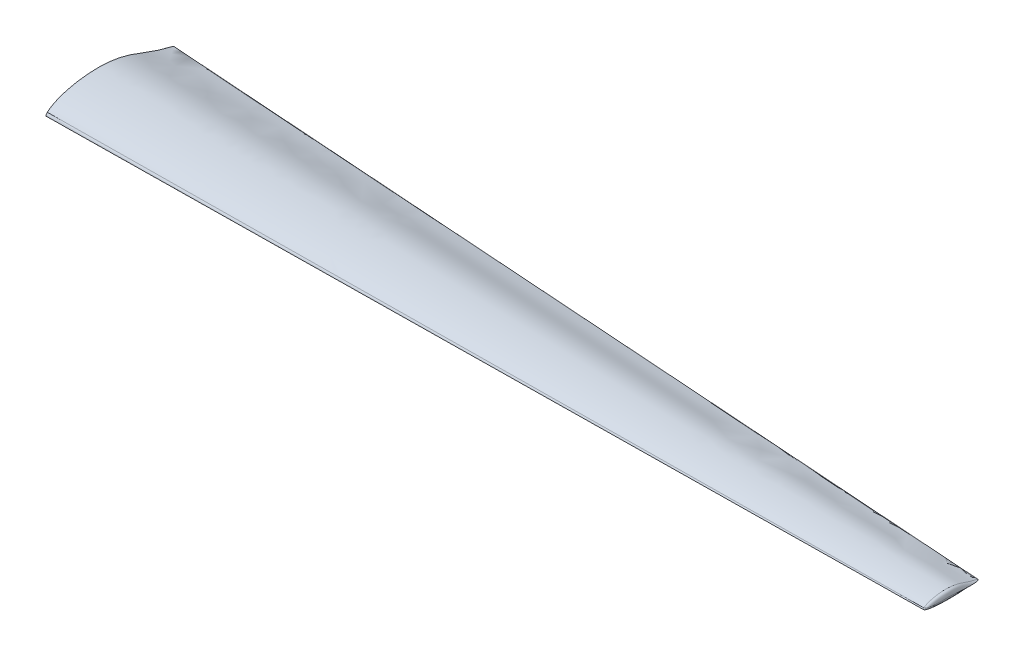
ISO-10303-21;
HEADER;
FILE_DESCRIPTION(('STEP AP214'),'2;1');
FILE_NAME('part.step','',(''),(''),'','','');
FILE_SCHEMA(('AUTOMOTIVE_DESIGN { 1 0 10303 214 1 1 1 1 }'));
ENDSEC;
DATA;
#1=APPLICATION_CONTEXT('core data for automotive mechanical design processes');
#2=APPLICATION_PROTOCOL_DEFINITION('international standard','automotive_design',2000,#1);
#3=PRODUCT_CONTEXT('',#1,'mechanical');
#4=PRODUCT('Part','Part','',(#3));
#5=PRODUCT_RELATED_PRODUCT_CATEGORY('part','',(#4));
#6=PRODUCT_DEFINITION_FORMATION('','',#4);
#7=PRODUCT_DEFINITION_CONTEXT('part definition',#1,'design');
#8=PRODUCT_DEFINITION('design','',#6,#7);
#9=PRODUCT_DEFINITION_SHAPE('','',#8);
#10=(LENGTH_UNIT() NAMED_UNIT(*) SI_UNIT(.MILLI.,.METRE.));
#11=(NAMED_UNIT(*) PLANE_ANGLE_UNIT() SI_UNIT($,.RADIAN.));
#12=(NAMED_UNIT(*) SI_UNIT($,.STERADIAN.) SOLID_ANGLE_UNIT());
#13=UNCERTAINTY_MEASURE_WITH_UNIT(LENGTH_MEASURE(1.E-05),#10,'distance_accuracy_value','');
#14=(GEOMETRIC_REPRESENTATION_CONTEXT(3) GLOBAL_UNCERTAINTY_ASSIGNED_CONTEXT((#13)) GLOBAL_UNIT_ASSIGNED_CONTEXT((#10,
#11,#12)) REPRESENTATION_CONTEXT('',''));
#15=CARTESIAN_POINT('',(0.,0.,0.));
#16=DIRECTION('',(0.,0.,1.));
#17=DIRECTION('',(1.,0.,0.));
#18=AXIS2_PLACEMENT_3D('',#15,#16,#17);
#19=CARTESIAN_POINT('',(0.,22.0052807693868,-11.2566210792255));
#20=CARTESIAN_POINT('',(2566.66666666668,17.3798746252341,-42.4735579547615));
#21=CARTESIAN_POINT('',(5133.33333333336,12.8095870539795,-73.919423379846));
#22=CARTESIAN_POINT('',(7700.00000000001,8.310390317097,-105.589905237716));
#23=CARTESIAN_POINT('',(0.,21.4352179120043,-10.7419801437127));
#24=CARTESIAN_POINT('',(2566.66666666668,16.9321418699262,-42.0596460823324));
#25=CARTESIAN_POINT('',(5133.33333333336,12.482590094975,-73.5999179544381));
#26=CARTESIAN_POINT('',(7700.00000000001,8.10209479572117,-105.358603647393));
#27=CARTESIAN_POINT('',(0.,20.2781720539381,-9.73147745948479));
#28=CARTESIAN_POINT('',(2566.66666666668,16.0233801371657,-41.2462786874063));
#29=CARTESIAN_POINT('',(5133.33333333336,11.8189099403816,-72.9709313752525));
#30=CARTESIAN_POINT('',(7700.,7.67940587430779,-104.901485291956));
#31=CARTESIAN_POINT('',(0.,18.4953544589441,-8.27189189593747));
#32=CARTESIAN_POINT('',(2566.66666666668,14.6223487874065,-40.0700828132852));
#33=CARTESIAN_POINT('',(5133.33333333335,10.7948191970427,-72.0586637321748));
#34=CARTESIAN_POINT('',(7700.,7.02605518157,-104.234052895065));
#35=CARTESIAN_POINT('',(0.,16.6692858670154,-6.86675446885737));
#36=CARTESIAN_POINT('',(2566.66666666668,13.1853887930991,-38.9377460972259));
#37=CARTESIAN_POINT('',(5133.33333333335,9.7420803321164,-71.1793344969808));
#38=CARTESIAN_POINT('',(7699.99999999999,6.3512716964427,-103.588312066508));
#39=CARTESIAN_POINT('',(0.,14.7911223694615,-5.53202463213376));
#40=CARTESIAN_POINT('',(2566.66666666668,11.7058991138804,-37.8610589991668));
#41=CARTESIAN_POINT('',(5133.33333333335,8.65633516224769,-70.3405631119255));
#42=CARTESIAN_POINT('',(7700.,5.65293993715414,-102.967709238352));
#43=CARTESIAN_POINT('',(0.,12.8542637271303,-4.28360240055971));
#44=CARTESIAN_POINT('',(2566.66666666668,10.178407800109,-36.8528166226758));
#45=CARTESIAN_POINT('',(5133.33333333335,7.53324001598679,-69.5520377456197));
#46=CARTESIAN_POINT('',(7700.00000000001,4.92784435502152,-102.378823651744));
#47=CARTESIAN_POINT('',(0.,11.1855249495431,-3.33339859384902));
#48=CARTESIAN_POINT('',(2566.66666666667,8.86075232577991,-36.0836311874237));
#49=CARTESIAN_POINT('',(5133.33333333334,6.56249032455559,-68.9465367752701));
#50=CARTESIAN_POINT('',(7699.99999999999,4.29861522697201,-101.919999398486));
#51=CARTESIAN_POINT('',(0.,9.82250131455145,-2.6259480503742));
#52=CARTESIAN_POINT('',(2566.66666666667,7.78437277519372,-35.5089173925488));
#53=CARTESIAN_POINT('',(5133.33333333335,5.76939190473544,-68.4905226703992));
#54=CARTESIAN_POINT('',(7700.,3.78445685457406,-101.568911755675));
#55=CARTESIAN_POINT('',(0.,8.78929579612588,-2.11698500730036));
#56=CARTESIAN_POINT('',(2566.66666666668,6.96844131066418,-35.0943636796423));
#57=CARTESIAN_POINT('',(5133.33333333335,5.16820180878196,-68.1597652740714));
#58=CARTESIAN_POINT('',(7700.00000000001,3.39473584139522,-101.311536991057));
#59=CARTESIAN_POINT('',(0.,7.74602112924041,-1.62924255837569));
#60=CARTESIAN_POINT('',(2566.66666666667,6.14487058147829,-34.6953407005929));
#61=CARTESIAN_POINT('',(5133.33333333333,4.56179186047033,-67.8387632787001));
#62=CARTESIAN_POINT('',(7699.99999999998,3.00219789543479,-101.058058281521));
#63=CARTESIAN_POINT('',(0.,6.69540544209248,-1.15731645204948));
#64=CARTESIAN_POINT('',(2566.66666666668,5.31621125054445,-34.3077537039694));
#65=CARTESIAN_POINT('',(5133.33333333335,3.95253525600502,-67.524731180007));
#66=CARTESIAN_POINT('',(7700.00000000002,2.60903872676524,-100.806999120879));
#67=CARTESIAN_POINT('',(0.,5.63191783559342,-0.715297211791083));
#68=CARTESIAN_POINT('',(2566.66666666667,4.47620560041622,-33.9434857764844));
#69=CARTESIAN_POINT('',(5133.33333333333,3.33344745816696,-67.2273443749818));
#70=CARTESIAN_POINT('',(7699.99999999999,2.20754695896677,-100.565826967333));
#71=CARTESIAN_POINT('',(0.,4.54382451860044,-0.335523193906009));
#72=CARTESIAN_POINT('',(2566.66666666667,3.61681155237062,-33.628490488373));
#73=CARTESIAN_POINT('',(5133.33333333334,2.70017809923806,-66.9661713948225));
#74=CARTESIAN_POINT('',(7700.00000000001,1.7970639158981,-100.347725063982));
#75=CARTESIAN_POINT('',(0.,3.42999813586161,-0.0378939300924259));
#76=CARTESIAN_POINT('',(2566.66666666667,2.73315681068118,-33.3775511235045));
#77=CARTESIAN_POINT('',(5133.33333333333,2.04410994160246,-66.7508790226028));
#78=CARTESIAN_POINT('',(7699.99999999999,1.36522739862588,-100.157243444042));
#79=CARTESIAN_POINT('',(0.,1.91427944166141,0.207990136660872));
#80=CARTESIAN_POINT('',(2566.66666666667,1.53270375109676,-33.1622342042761));
#81=CARTESIAN_POINT('',(5133.33333333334,1.15546180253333,-66.5512897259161));
#82=CARTESIAN_POINT('',(7700.00000000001,0.783888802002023,-99.9588197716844));
#83=CARTESIAN_POINT('',(0.,0.747202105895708,0.175971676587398));
#84=CARTESIAN_POINT('',(2566.66666666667,0.595152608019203,-33.1770424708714));
#85=CARTESIAN_POINT('',(5133.33333333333,0.444825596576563,-66.5376276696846));
#86=CARTESIAN_POINT('',(7700.,0.296771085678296,-99.9056376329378));
#87=CARTESIAN_POINT('',(0.,-0.706100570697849,-0.166291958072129));
#88=CARTESIAN_POINT('',(2566.66666666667,-0.562375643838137,-33.4810167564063));
#89=CARTESIAN_POINT('',(5133.33333333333,-0.420327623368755,-66.7885990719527));
#90=CARTESIAN_POINT('',(7700.,-0.280432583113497,-100.089167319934));
#91=CARTESIAN_POINT('',(0.,-1.71226619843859,-0.616205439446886));
#92=CARTESIAN_POINT('',(2566.66666666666,-1.34745303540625,-33.8904794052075));
#93=CARTESIAN_POINT('',(5133.33333333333,-0.986774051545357,-67.1469719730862));
#94=CARTESIAN_POINT('',(7699.99999999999,-0.631444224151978,-100.386010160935));
#95=CARTESIAN_POINT('',(0.,-2.8997584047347,-1.45114204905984));
#96=CARTESIAN_POINT('',(2566.66666666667,-2.25905697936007,-34.6103162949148));
#97=CARTESIAN_POINT('',(5133.33333333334,-1.62572618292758,-67.7376904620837));
#98=CARTESIAN_POINT('',(7700.00000000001,-1.0019485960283,-100.833853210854));
#99=CARTESIAN_POINT('',(0.,-3.71999114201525,-2.16851772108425));
#100=CARTESIAN_POINT('',(2566.66666666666,-2.89211417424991,-35.2177448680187));
#101=CARTESIAN_POINT('',(5133.33333333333,-2.07401527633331,-68.2247409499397));
#102=CARTESIAN_POINT('',(7700.,-1.26859396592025,-101.190289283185));
#103=CARTESIAN_POINT('',(0.,-4.47648202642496,-2.95071383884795));
#104=CARTESIAN_POINT('',(2566.66666666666,-3.47583620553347,-35.8709473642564));
#105=CARTESIAN_POINT('',(5133.33333333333,-2.48735605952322,-68.7386016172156));
#106=CARTESIAN_POINT('',(7700.,-1.51464931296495,-101.554652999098));
#107=CARTESIAN_POINT('',(0.,-5.420236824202,-4.05440394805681));
#108=CARTESIAN_POINT('',(2566.66666666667,-4.20394097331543,-36.7881748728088));
#109=CARTESIAN_POINT('',(5133.33333333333,-3.00296790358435,-69.4556789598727));
#110=CARTESIAN_POINT('',(7700.00000000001,-1.82185802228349,-102.05814796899));
#111=CARTESIAN_POINT('',(0.,-6.51591102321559,-5.49982279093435));
#112=CARTESIAN_POINT('',(2566.66666666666,-5.04366713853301,-37.9859118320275));
#113=CARTESIAN_POINT('',(5133.33333333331,-3.59064313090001,-70.3888302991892));
#114=CARTESIAN_POINT('',(7699.99999999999,-2.1625236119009,-102.710125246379));
#115=CARTESIAN_POINT('',(0.,-7.69050869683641,-7.3343733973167));
#116=CARTESIAN_POINT('',(2566.66666666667,-5.94040695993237,-39.4983441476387));
#117=CARTESIAN_POINT('',(5133.33333333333,-4.21412324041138,-71.5591870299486));
#118=CARTESIAN_POINT('',(7700.00000000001,-2.51868083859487,-103.518821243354));
#119=CARTESIAN_POINT('',(0.,-8.71901802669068,-9.25316735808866));
#120=CARTESIAN_POINT('',(2566.66666666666,-6.7252142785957,-41.0723721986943));
#121=CARTESIAN_POINT('',(5133.33333333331,-4.75974879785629,-72.7688171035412));
#122=CARTESIAN_POINT('',(7699.99999999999,-2.83094949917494,-104.344787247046));
#123=CARTESIAN_POINT('',(0.,-9.61469185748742,-11.2374139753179));
#124=CARTESIAN_POINT('',(2566.66666666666,-7.40993318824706,-42.6938879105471));
#125=CARTESIAN_POINT('',(5133.33333333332,-5.23795563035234,-74.0082931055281));
#126=CARTESIAN_POINT('',(7700.00000000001,-3.1083579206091,-105.183274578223));
#127=CARTESIAN_POINT('',(0.,-10.4107651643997,-13.2627052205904));
#128=CARTESIAN_POINT('',(2566.66666666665,-8.01934711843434,-44.3452081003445));
#129=CARTESIAN_POINT('',(5133.33333333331,-5.66507610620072,-75.266654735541));
#130=CARTESIAN_POINT('',(7699.99999999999,-3.35878817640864,-106.030043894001));
#131=CARTESIAN_POINT('',(0.,-11.135617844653,-15.3144371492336));
#132=CARTESIAN_POINT('',(2566.66666666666,-8.57450468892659,-46.0157972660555));
#133=CARTESIAN_POINT('',(5133.33333333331,-6.05482805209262,-76.5374329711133));
#134=CARTESIAN_POINT('',(7700.,-3.58862806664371,-106.882690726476));
#135=CARTESIAN_POINT('',(0.,-11.8236416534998,-17.3784469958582));
#136=CARTESIAN_POINT('',(2566.66666666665,-9.0997549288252,-47.695657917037));
#137=CARTESIAN_POINT('',(5133.33333333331,-6.42151825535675,-77.814793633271));
#138=CARTESIAN_POINT('',(7700.,-3.80214290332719,-107.739542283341));
#139=CARTESIAN_POINT('',(0.,-12.4840704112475,-19.4514966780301));
#140=CARTESIAN_POINT('',(2566.66666666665,-9.60367643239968,-49.3819659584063));
#141=CARTESIAN_POINT('',(5133.33333333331,-6.77307056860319,-79.0963246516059));
#142=CARTESIAN_POINT('',(7700.,-4.00660256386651,-108.598596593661));
#143=CARTESIAN_POINT('',(0.,-13.330246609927,-22.2261157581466));
#144=CARTESIAN_POINT('',(2566.66666666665,-10.2507871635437,-51.6374785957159));
#145=CARTESIAN_POINT('',(5133.3333333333,-7.22653327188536,-80.8091016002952));
#146=CARTESIAN_POINT('',(7700.,-4.27330946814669,-109.745448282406));
#147=CARTESIAN_POINT('',(0.,-14.341524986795,-25.7081536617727));
#148=CARTESIAN_POINT('',(2566.66666666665,-11.0290908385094,-54.4652434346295));
#149=CARTESIAN_POINT('',(5133.33333333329,-7.77844779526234,-82.953835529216));
#150=CARTESIAN_POINT('',(7699.99999999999,-4.60718362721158,-111.178928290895));
#151=CARTESIAN_POINT('',(0.,-15.4977196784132,-29.9025232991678));
#152=CARTESIAN_POINT('',(2566.66666666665,-11.9211836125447,-57.8689122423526));
#153=CARTESIAN_POINT('',(5133.3333333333,-8.414047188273,-85.5335243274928));
#154=CARTESIAN_POINT('',(7700.00000000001,-4.99588791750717,-112.901976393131));
#155=CARTESIAN_POINT('',(0.,-16.5974477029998,-34.1118397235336));
#156=CARTESIAN_POINT('',(2566.66666666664,-12.7690960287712,-61.2828827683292));
#157=CARTESIAN_POINT('',(5133.33333333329,-9.01746228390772,-88.120084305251));
#158=CARTESIAN_POINT('',(7700.,-5.36398983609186,-114.629656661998));
#159=CARTESIAN_POINT('',(0.,-17.6461628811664,-38.3338815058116));
#160=CARTESIAN_POINT('',(2566.66666666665,-13.57371635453,-64.7061471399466));
#161=CARTESIAN_POINT('',(5133.33333333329,-9.58501967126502,-90.7137054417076));
#162=CARTESIAN_POINT('',(7700.00000000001,-5.70326042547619,-116.363341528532));
#163=CARTESIAN_POINT('',(0.,-18.64717164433,-42.5672638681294));
#164=CARTESIAN_POINT('',(2566.66666666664,-14.3388648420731,-68.1373212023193));
#165=CARTESIAN_POINT('',(5133.33333333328,-10.1210572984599,-93.3129885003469));
#166=CARTESIAN_POINT('',(7699.99999999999,-6.01856146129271,-118.101601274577));
#167=CARTESIAN_POINT('',(0.,-19.6048605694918,-46.8104078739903));
#168=CARTESIAN_POINT('',(2566.66666666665,-15.0683225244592,-71.5751229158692));
#169=CARTESIAN_POINT('',(5133.33333333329,-10.6287545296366,-95.9169326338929));
#170=CARTESIAN_POINT('',(7700.00000000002,-6.31247677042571,-119.843700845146));
#171=CARTESIAN_POINT('',(0.,-20.5231650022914,-51.0620212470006));
#172=CARTESIAN_POINT('',(2566.66666666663,-15.765940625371,-75.0184138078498));
#173=CARTESIAN_POINT('',(5133.33333333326,-11.111882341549,-98.5245374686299));
#174=CARTESIAN_POINT('',(7699.99999999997,-6.58870321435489,-121.588762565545));
#175=CARTESIAN_POINT('',(0.,-21.4060447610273,-55.3209017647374));
#176=CARTESIAN_POINT('',(2566.66666666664,-16.4354183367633,-78.4661942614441));
#177=CARTESIAN_POINT('',(5133.33333333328,-11.573883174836,-101.13499028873));
#178=CARTESIAN_POINT('',(7700.00000000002,-6.85043261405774,-123.336145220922));
#179=CARTESIAN_POINT('',(0.,-22.2579167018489,-59.5858619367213));
#180=CARTESIAN_POINT('',(2566.66666666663,-17.080823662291,-81.9174833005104));
#181=CARTESIAN_POINT('',(5133.33333333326,-12.0184800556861,-103.747500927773));
#182=CARTESIAN_POINT('',(7699.99999999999,-7.10104914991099,-125.085234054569));
#183=CARTESIAN_POINT('',(0.,-23.3544403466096,-65.2799129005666));
#184=CARTESIAN_POINT('',(2566.66666666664,-17.9121732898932,-86.5232126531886));
#185=CARTESIAN_POINT('',(5133.33333333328,-12.5918490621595,-107.232905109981));
#186=CARTESIAN_POINT('',(7700.00000000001,-7.42504671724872,-127.418900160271));
#187=CARTESIAN_POINT('',(0.,-24.6531931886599,-72.4105028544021));
#188=CARTESIAN_POINT('',(2566.66666666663,-18.8981519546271,-92.287246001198));
#189=CARTESIAN_POINT('',(5133.33333333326,-13.2733971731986,-111.593099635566));
#190=CARTESIAN_POINT('',(7699.99999999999,-7.81201304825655,-130.338660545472));
#191=CARTESIAN_POINT('',(0.,-26.1040262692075,-80.9853102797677));
#192=CARTESIAN_POINT('',(2566.66666666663,-20.0015810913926,-99.2132300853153));
#193=CARTESIAN_POINT('',(5133.33333333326,-14.0384287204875,-116.829751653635));
#194=CARTESIAN_POINT('',(7700.,-8.24905426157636,-133.846216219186));
#195=CARTESIAN_POINT('',(0.,-27.4543513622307,-89.5756324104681));
#196=CARTESIAN_POINT('',(2566.66666666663,-21.0306066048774,-106.146614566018));
#197=CARTESIAN_POINT('',(5133.33333333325,-14.7541860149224,-122.069794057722));
#198=CARTESIAN_POINT('',(7699.99999999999,-8.66058837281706,-137.357179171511));
#199=CARTESIAN_POINT('',(0.,-28.7115951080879,-98.1793281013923));
#200=CARTESIAN_POINT('',(2566.66666666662,-21.9907117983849,-113.085969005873));
#201=CARTESIAN_POINT('',(5133.33333333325,-15.4242400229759,-127.312381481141));
#202=CARTESIAN_POINT('',(7700.,-9.04832306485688,-140.87116590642));
#203=CARTESIAN_POINT('',(0.,-29.8831841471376,-106.794256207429));
#204=CARTESIAN_POINT('',(2566.66666666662,-22.887400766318,-120.029872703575));
#205=CARTESIAN_POINT('',(5133.33333333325,-16.0522032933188,-132.55668802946));
#206=CARTESIAN_POINT('',(7700.,-9.41402839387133,-144.387822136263));
#207=CARTESIAN_POINT('',(0.,-30.9765490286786,-115.418743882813));
#208=CARTESIAN_POINT('',(2566.66666666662,-23.7261720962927,-126.977229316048));
#209=CARTESIAN_POINT('',(5133.33333333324,-16.6416734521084,-137.802068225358));
#210=CARTESIAN_POINT('',(7700.,-9.75945007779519,-147.906830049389));
#211=CARTESIAN_POINT('',(0.,-31.99912030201,-124.051118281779));
#212=CARTESIAN_POINT('',(2566.66666666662,-24.5125324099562,-133.926951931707));
#213=CARTESIAN_POINT('',(5133.33333333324,-17.1962641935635,-143.047895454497));
#214=CARTESIAN_POINT('',(7700.,-10.0863579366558,-151.427900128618));
#215=CARTESIAN_POINT('',(0.,-32.9584728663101,-132.690065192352));
#216=CARTESIAN_POINT('',(2566.66666666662,-25.2520792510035,-140.878202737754));
#217=CARTESIAN_POINT('',(5133.33333333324,-17.7196267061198,-148.293682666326));
#218=CARTESIAN_POINT('',(7700.,-10.3965058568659,-154.950772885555));
#219=CARTESIAN_POINT('',(0.,-33.8621816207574,-141.334270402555));
#220=CARTESIAN_POINT('',(2566.66666666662,-25.9504198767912,-147.830151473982));
#221=CARTESIAN_POINT('',(5133.33333333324,-18.2154316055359,-153.538957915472));
#222=CARTESIAN_POINT('',(7700.,-10.6916768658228,-158.475211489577));
#223=CARTESIAN_POINT('',(0.,-34.7175846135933,-149.982734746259));
#224=CARTESIAN_POINT('',(2566.66666666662,-26.6129836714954,-154.782187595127));
#225=CARTESIAN_POINT('',(5133.33333333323,-18.6872306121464,-158.783373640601));
#226=CARTESIAN_POINT('',(7700.,-10.973594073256,-162.001008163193));
#227=CARTESIAN_POINT('',(0.,-35.5320198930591,-158.634459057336));
#228=CARTESIAN_POINT('',(2566.66666666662,-27.2447575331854,-161.733740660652));
#229=CARTESIAN_POINT('',(5133.33333333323,-19.1376904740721,-164.02666248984));
#230=CARTESIAN_POINT('',(7699.99999999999,-11.2426531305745,-165.528075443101));
#231=CARTESIAN_POINT('',(0.,-36.5738278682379,-170.173334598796));
#232=CARTESIAN_POINT('',(2566.66666666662,-28.0532383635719,-171.001225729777));
#233=CARTESIAN_POINT('',(5133.33333333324,-19.7137127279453,-171.015931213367));
#234=CARTESIAN_POINT('',(7700.00000000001,-11.5848734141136,-170.232408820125));
#235=CARTESIAN_POINT('',(0.,-37.8131106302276,-184.600940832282));
#236=CARTESIAN_POINT('',(2566.66666666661,-29.0137194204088,-182.582098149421));
#237=CARTESIAN_POINT('',(5133.33333333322,-20.3948153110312,-179.748657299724));
#238=CARTESIAN_POINT('',(7699.99999999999,-11.9827390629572,-176.115577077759));
#239=CARTESIAN_POINT('',(0.,-39.2067811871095,-201.919535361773));
#240=CARTESIAN_POINT('',(2566.66666666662,-30.0918726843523,-196.473732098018));
#241=CARTESIAN_POINT('',(5133.33333333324,-21.1543471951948,-190.222022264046));
#242=CARTESIAN_POINT('',(7700.00000000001,-12.4159250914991,-183.179173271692));
#243=CARTESIAN_POINT('',(0.,-40.506962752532,-219.24321706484));
#244=CARTESIAN_POINT('',(2566.66666666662,-31.0964648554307,-210.360521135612));
#245=CARTESIAN_POINT('',(5133.33333333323,-21.8580819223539,-200.689991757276));
#246=CARTESIAN_POINT('',(7700.,-12.8083760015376,-190.246031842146));
#247=CARTESIAN_POINT('',(0.,-41.7167890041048,-236.571414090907));
#248=CARTESIAN_POINT('',(2566.66666666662,-32.0305124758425,-224.24292341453));
#249=CARTESIAN_POINT('',(5133.33333333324,-22.5091669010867,-211.153048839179));
#250=CARTESIAN_POINT('',(7700.00000000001,-13.1637624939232,-197.31567515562));
#251=CARTESIAN_POINT('',(0.,-42.8377931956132,-253.90370127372));
#252=CARTESIAN_POINT('',(2566.66666666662,-32.8958832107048,-238.121517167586));
#253=CARTESIAN_POINT('',(5133.33333333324,-23.1100522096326,-221.611770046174));
#254=CARTESIAN_POINT('',(7700.,-13.4855094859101,-204.387692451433));
#255=CARTESIAN_POINT('',(0.,-43.8723732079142,-271.239624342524));
#256=CARTESIAN_POINT('',(2566.66666666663,-33.6951874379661,-251.996871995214));
#257=CARTESIAN_POINT('',(5133.33333333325,-23.6638087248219,-232.06674375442));
#258=CARTESIAN_POINT('',(7700.,-13.7775407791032,-211.461705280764));
#259=CARTESIAN_POINT('',(0.,-44.8224797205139,-288.578792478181));
#260=CARTESIAN_POINT('',(2566.66666666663,-34.4300962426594,-265.869640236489));
#261=CARTESIAN_POINT('',(5133.33333333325,-24.172075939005,-242.51866036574));
#262=CARTESIAN_POINT('',(7700.,-14.0418566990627,-218.537456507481));
#263=CARTESIAN_POINT('',(0.,-45.6903155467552,-305.920827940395));
#264=CARTESIAN_POINT('',(2566.66666666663,-35.1020042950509,-279.740505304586));
#265=CARTESIAN_POINT('',(5133.33333333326,-24.6356883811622,-252.96825935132));
#266=CARTESIAN_POINT('',(7700.,-14.2791240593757,-225.614756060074));
#267=CARTESIAN_POINT('',(0.,-46.4779588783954,-323.265392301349));
#268=CARTESIAN_POINT('',(2566.66666666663,-35.7123824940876,-293.610174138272));
#269=CARTESIAN_POINT('',(5133.33333333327,-25.0557576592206,-263.416287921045));
#270=CARTESIAN_POINT('',(7700.,-14.4904876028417,-232.69340581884));
#271=CARTESIAN_POINT('',(0.,-47.1875651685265,-340.612170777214));
#272=CARTESIAN_POINT('',(2566.66666666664,-36.2626761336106,-307.479376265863));
#273=CARTESIAN_POINT('',(5133.33333333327,-25.433266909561,-273.863514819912));
#274=CARTESIAN_POINT('',(7699.99999999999,-14.6768607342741,-239.773228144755));
#275=CARTESIAN_POINT('',(0.,-47.8212512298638,-357.960881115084));
#276=CARTESIAN_POINT('',(2566.66666666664,-36.7543436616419,-321.348864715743));
#277=CARTESIAN_POINT('',(5133.33333333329,-25.7692642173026,-284.310723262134));
#278=CARTESIAN_POINT('',(7700.00000000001,-14.8392736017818,-246.854050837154));
#279=CARTESIAN_POINT('',(0.,-48.3811126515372,-375.311268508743));
#280=CARTESIAN_POINT('',(2566.66666666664,-37.1888126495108,-335.21941509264));
#281=CARTESIAN_POINT('',(5133.33333333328,-26.0647571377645,-294.758714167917));
#282=CARTESIAN_POINT('',(7699.99999999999,-14.9787061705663,-253.935714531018));
#283=CARTESIAN_POINT('',(0.,-48.8692409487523,-392.663103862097));
#284=CARTESIAN_POINT('',(2566.66666666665,-37.5675155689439,-349.091823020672));
#285=CARTESIAN_POINT('',(5133.3333333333,-26.3207671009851,-305.208302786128));
#286=CARTESIAN_POINT('',(7700.00000000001,-15.0961612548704,-261.018068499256));
#287=CARTESIAN_POINT('',(0.,-49.2877308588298,-410.016187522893));
#288=CARTESIAN_POINT('',(2566.66666666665,-37.8915987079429,-362.966910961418));
#289=CARTESIAN_POINT('',(5133.3333333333,-26.5377399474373,-315.660328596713));
#290=CARTESIAN_POINT('',(7699.99999999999,-15.1917766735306,-268.10098363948));
#291=CARTESIAN_POINT('',(0.,-49.6386754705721,-427.370337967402));
#292=CARTESIAN_POINT('',(2566.66666666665,-38.1621964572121,-376.845513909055));
#293=CARTESIAN_POINT('',(5133.33333333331,-26.7160993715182,-326.115638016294));
#294=CARTESIAN_POINT('',(7700.,-15.2656578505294,-275.184332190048));
#295=CARTESIAN_POINT('',(0.,-50.0193311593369,-450.510435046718));
#296=CARTESIAN_POINT('',(2566.66666666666,-38.4532048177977,-395.356150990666));
#297=CARTESIAN_POINT('',(5133.33333333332,-26.9030185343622,-340.061574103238));
#298=CARTESIAN_POINT('',(7700.00000000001,-15.3353674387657,-284.629204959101));
#299=CARTESIAN_POINT('',(0.,-50.3367486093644,-479.437511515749));
#300=CARTESIAN_POINT('',(2566.66666666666,-38.6889705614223,-418.507540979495));
#301=CARTESIAN_POINT('',(5133.33333333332,-27.0423503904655,-357.506501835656));
#302=CARTESIAN_POINT('',(7699.99999999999,-15.3688450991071,-296.435742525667));
#303=CARTESIAN_POINT('',(0.,-50.4809170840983,-514.15238450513));
#304=CARTESIAN_POINT('',(2566.66666666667,-38.7761510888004,-446.317319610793));
#305=CARTESIAN_POINT('',(5133.33333333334,-27.0620206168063,-378.467455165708));
#306=CARTESIAN_POINT('',(7700.00000000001,-15.3240083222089,-310.603312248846));
#307=CARTESIAN_POINT('',(0.,-50.4303254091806,-537.296930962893));
#308=CARTESIAN_POINT('',(2566.66666666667,-38.7099218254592,-464.880825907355));
#309=CARTESIAN_POINT('',(5133.33333333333,-26.9792723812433,-392.464206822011));
#310=CARTESIAN_POINT('',(7700.,-15.2383746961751,-320.047517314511));
#311=CARTESIAN_POINT('',(0.,-50.294692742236,-560.37112867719));
#312=CARTESIAN_POINT('',(2566.66666666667,-38.5736126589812,-483.401900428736));
#313=CARTESIAN_POINT('',(5133.33333333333,-26.8451248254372,-406.432149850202));
#314=CARTESIAN_POINT('',(7700.,-15.1268225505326,-329.462531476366));
#315=CARTESIAN_POINT('',(0.,-50.1800428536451,-577.623539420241));
#316=CARTESIAN_POINT('',(2566.66666666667,-38.5549055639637,-497.435366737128));
#317=CARTESIAN_POINT('',(5133.33333333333,-26.7734878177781,-416.967946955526));
#318=CARTESIAN_POINT('',(7700.,-15.0239430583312,-336.503462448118));
#319=CARTESIAN_POINT('',(0.,-49.8745273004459,-600.61776171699));
#320=CARTESIAN_POINT('',(2566.66666666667,-38.5761429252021,-516.441681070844));
#321=CARTESIAN_POINT('',(5133.33333333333,-26.6775712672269,-431.161803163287));
#322=CARTESIAN_POINT('',(7700.,-14.8498449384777,-345.892903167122));
#323=CARTESIAN_POINT('',(0.,-49.5819475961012,-617.860255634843));
#324=CARTESIAN_POINT('',(2566.66666666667,-38.6147714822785,-530.827436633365));
#325=CARTESIAN_POINT('',(5133.33333333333,-26.6059179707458,-441.872079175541));
#326=CARTESIAN_POINT('',(7700.,-14.7014766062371,-352.935634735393));
#327=CARTESIAN_POINT('',(0.,-49.2142060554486,-635.099017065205));
#328=CARTESIAN_POINT('',(2566.66666666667,-38.6593108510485,-545.326463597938));
#329=CARTESIAN_POINT('',(5133.33333333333,-26.5268330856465,-452.638431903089));
#330=CARTESIAN_POINT('',(7700.,-14.5359815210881,-359.978901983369));
#331=CARTESIAN_POINT('',(0.,-48.7651381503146,-652.333842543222));
#332=CARTESIAN_POINT('',(2566.66666666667,-38.6953266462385,-559.921213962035));
#333=CARTESIAN_POINT('',(5133.33333333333,-26.4317573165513,-463.452098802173));
#334=CARTESIAN_POINT('',(7700.,-14.3499851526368,-367.022478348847));
#335=CARTESIAN_POINT('',(0.,-48.2278036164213,-669.564337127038));
#336=CARTESIAN_POINT('',(2566.66666666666,-38.7078673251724,-574.594012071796));
#337=CARTESIAN_POINT('',(5133.33333333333,-26.3118727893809,-474.30425350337));
#338=CARTESIAN_POINT('',(7700.,-14.1401129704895,-374.066137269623));
#339=CARTESIAN_POINT('',(0.,-47.5946888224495,-686.789983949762));
#340=CARTESIAN_POINT('',(2566.66666666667,-38.6813871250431,-589.327069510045));
#341=CARTESIAN_POINT('',(5133.33333333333,-26.1577465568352,-485.185966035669));
#342=CARTESIAN_POINT('',(7700.,-13.9023545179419,-381.109557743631));
#343=CARTESIAN_POINT('',(0.,-46.8594736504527,-704.010205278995));
#344=CARTESIAN_POINT('',(2566.66666666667,-38.6013852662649,-604.102562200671));
#345=CARTESIAN_POINT('',(5133.33333333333,-25.9608421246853,-496.088295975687));
#346=CARTESIAN_POINT('',(7700.,-13.6334472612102,-388.152433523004));
#347=CARTESIAN_POINT('',(0.,-46.0134717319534,-721.224177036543));
#348=CARTESIAN_POINT('',(2566.66666666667,-38.4515042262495,-618.902466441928));
#349=CARTESIAN_POINT('',(5133.33333333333,-25.7112757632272,-507.002149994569));
#350=CARTESIAN_POINT('',(7700.,-13.3292909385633,-395.19435217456));
#351=CARTESIAN_POINT('',(0.,-45.0563688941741,-738.431365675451));
#352=CARTESIAN_POINT('',(2566.66666666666,-38.2213362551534,-633.708957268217));
#353=CARTESIAN_POINT('',(5133.33333333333,-25.4026910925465,-517.918541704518));
#354=CARTESIAN_POINT('',(7700.,-12.9868902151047,-402.234916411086));
#355=CARTESIAN_POINT('',(0.,-43.9947815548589,-755.631671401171));
#356=CARTESIAN_POINT('',(2566.66666666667,-37.9044091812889,-648.504437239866));
#357=CARTESIAN_POINT('',(5133.33333333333,-25.0296722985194,-528.828506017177));
#358=CARTESIAN_POINT('',(7700.,-12.6011953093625,-409.273544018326));
#359=CARTESIAN_POINT('',(0.,-42.8331516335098,-772.824977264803));
#360=CARTESIAN_POINT('',(2566.66666666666,-37.495535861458,-663.271435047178));
#361=CARTESIAN_POINT('',(5133.33333333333,-24.5915481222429,-539.723347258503));
#362=CARTESIAN_POINT('',(7700.,-12.1753605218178,-416.310065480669));
#363=CARTESIAN_POINT('',(0.,-41.5773473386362,-790.011340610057));
#364=CARTESIAN_POINT('',(2566.66666666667,-36.9915525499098,-677.992685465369));
#365=CARTESIAN_POINT('',(5133.33333333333,-24.0902678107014,-550.594607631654));
#366=CARTESIAN_POINT('',(7700.,-11.7157577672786,-423.344580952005));
#367=CARTESIAN_POINT('',(0.,-40.2320810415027,-807.190826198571));
#368=CARTESIAN_POINT('',(2566.66666666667,-36.3882278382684,-692.65094044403));
#369=CARTESIAN_POINT('',(5133.33333333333,-23.5268011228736,-561.433856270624));
#370=CARTESIAN_POINT('',(7700.00000000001,-11.2278676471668,-430.377227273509));
#371=CARTESIAN_POINT('',(0.,-38.8036894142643,-824.363710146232));
#372=CARTESIAN_POINT('',(2566.66666666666,-35.6824840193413,-707.229117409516));
#373=CARTESIAN_POINT('',(5133.33333333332,-22.9028009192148,-572.232781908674));
#374=CARTESIAN_POINT('',(7699.99999999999,-10.7173832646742,-437.408215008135));
#375=CARTESIAN_POINT('',(0.,-37.2958344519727,-841.530125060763));
#376=CARTESIAN_POINT('',(2566.66666666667,-34.8696003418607,-721.710069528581));
#377=CARTESIAN_POINT('',(5133.33333333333,-22.2193086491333,-582.983088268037));
#378=CARTESIAN_POINT('',(7700.00000000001,-10.1904179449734,-444.437848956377));
#379=CARTESIAN_POINT('',(0.,-35.9817679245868,-855.830737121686));
#380=CARTESIAN_POINT('',(2566.66666666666,-34.1023721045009,-733.682566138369));
#381=CARTESIAN_POINT('',(5133.33333333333,-21.6021598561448,-591.894393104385));
#382=CARTESIAN_POINT('',(7700.,-9.74152239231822,-450.294948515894));
#383=CARTESIAN_POINT('',(0.,-34.9205499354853,-867.270669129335));
#384=CARTESIAN_POINT('',(2566.66666666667,-33.4480934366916,-743.196547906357));
#385=CARTESIAN_POINT('',(5133.33333333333,-21.0892205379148,-598.991774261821));
#386=CARTESIAN_POINT('',(7700.,-9.38145280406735,-454.980398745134));
#387=CARTESIAN_POINT('',(0.,-34.1244220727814,-875.850820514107));
#388=CARTESIAN_POINT('',(2566.66666666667,-32.939763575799,-750.29822240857));
#389=CARTESIAN_POINT('',(5133.33333333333,-20.6971603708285,-604.298155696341));
#390=CARTESIAN_POINT('',(7700.,-9.11271949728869,-458.49449843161));
#391=CARTESIAN_POINT('',(0.,-33.3341845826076,-884.431758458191));
#392=CARTESIAN_POINT('',(2566.66666666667,-32.4173311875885,-757.364349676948));
#393=CARTESIAN_POINT('',(5133.33333333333,-20.3004445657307,-609.587093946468));
#394=CARTESIAN_POINT('',(7700.,-8.84710053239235,-462.008736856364));
#395=CARTESIAN_POINT('',(0.,-32.5550968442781,-893.013990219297));
#396=CARTESIAN_POINT('',(2566.66666666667,-31.8836895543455,-764.39313518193));
#397=CARTESIAN_POINT('',(5133.33333333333,-19.901368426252,-614.857758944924));
#398=CARTESIAN_POINT('',(7700.,-8.5862069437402,-465.523217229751));
#399=CARTESIAN_POINT('',(0.,-31.7929607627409,-901.598043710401));
#400=CARTESIAN_POINT('',(2566.66666666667,-31.3420936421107,-771.382798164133));
#401=CARTESIAN_POINT('',(5133.33333333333,-19.5024080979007,-620.109327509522));
#402=CARTESIAN_POINT('',(7700.,-8.33164976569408,-469.038042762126));
#403=CARTESIAN_POINT('',(0.,-31.053347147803,-910.184396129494));
#404=CARTESIAN_POINT('',(2566.66666666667,-30.795736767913,-778.331525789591));
#405=CARTESIAN_POINT('',(5133.33333333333,-19.1061475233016,-625.3409630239));
#406=CARTESIAN_POINT('',(7700.,-8.08531727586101,-472.553321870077));
#407=CARTESIAN_POINT('',(0.,-30.3420849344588,-918.773499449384));
#408=CARTESIAN_POINT('',(2566.66666666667,-30.2479018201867,-785.237479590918));
#409=CARTESIAN_POINT('',(5133.33333333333,-18.7150916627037,-630.551802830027));
#410=CARTESIAN_POINT('',(7700.,-7.84885021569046,-476.06913652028));
#411=CARTESIAN_POINT('',(0.,-29.6649485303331,-927.365745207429));
#412=CARTESIAN_POINT('',(2566.66666666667,-29.7019316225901,-792.098781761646));
#413=CARTESIAN_POINT('',(5133.33333333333,-18.3319198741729,-635.740966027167));
#414=CARTESIAN_POINT('',(7700.,-7.62417818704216,-479.585571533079));
#415=CARTESIAN_POINT('',(0.,-29.0279803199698,-935.961473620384));
#416=CARTESIAN_POINT('',(2566.66666666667,-29.161290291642,-798.91351061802));
#417=CARTESIAN_POINT('',(5133.33333333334,-17.9592861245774,-640.907535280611));
#418=CARTESIAN_POINT('',(7700.00000000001,-7.41305871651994,-483.102682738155));
#419=CARTESIAN_POINT('',(0.,-28.437102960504,-944.560934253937));
#420=CARTESIAN_POINT('',(2566.66666666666,-28.629525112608,-805.679686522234));
#421=CARTESIAN_POINT('',(5133.33333333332,-17.6001304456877,-646.050567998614));
#422=CARTESIAN_POINT('',(7699.99999999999,-7.21773829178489,-486.620533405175));
#423=CARTESIAN_POINT('',(0.,-27.8988463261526,-953.16431682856));
#424=CARTESIAN_POINT('',(2566.66666666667,-28.1107779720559,-812.395289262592));
#425=CARTESIAN_POINT('',(5133.33333333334,-17.257974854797,-651.169100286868));
#426=CARTESIAN_POINT('',(7700.00000000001,-7.04103277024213,-490.139184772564));
#427=CARTESIAN_POINT('',(0.,-27.4184459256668,-961.771615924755));
#428=CARTESIAN_POINT('',(2566.66666666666,-27.6082103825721,-819.058148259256));
#429=CARTESIAN_POINT('',(5133.33333333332,-16.9356749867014,-656.262062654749));
#430=CARTESIAN_POINT('',(7699.99999999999,-6.88540561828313,-493.658637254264));
#431=CARTESIAN_POINT('',(0.,-26.9986720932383,-970.382600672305));
#432=CARTESIAN_POINT('',(2566.66666666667,-27.1232953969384,-825.66592591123));
#433=CARTESIAN_POINT('',(5133.33333333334,-16.6351747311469,-661.328277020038));
#434=CARTESIAN_POINT('',(7700.00000000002,-6.75318527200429,-497.178841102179));
#435=CARTESIAN_POINT('',(0.,-26.6422161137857,-978.99698262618));
#436=CARTESIAN_POINT('',(2566.66666666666,-26.6573057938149,-832.216226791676));
#437=CARTESIAN_POINT('',(5133.33333333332,-16.3580964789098,-666.366507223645));
#438=CARTESIAN_POINT('',(7699.99999999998,-6.64625744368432,-500.699688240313));
#439=CARTESIAN_POINT('',(0.,-26.3508488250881,-987.61437931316));
#440=CARTESIAN_POINT('',(2566.66666666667,-26.2108572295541,-838.706577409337));
#441=CARTESIAN_POINT('',(5133.33333333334,-16.1056688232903,-671.375455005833));
#442=CARTESIAN_POINT('',(7700.00000000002,-6.56637737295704,-504.221024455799));
#443=CARTESIAN_POINT('',(0.,-26.1633221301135,-994.7976950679));
#444=CARTESIAN_POINT('',(2566.66666666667,-25.8551065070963,-844.063141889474));
#445=CARTESIAN_POINT('',(5133.33333333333,-15.9163003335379,-675.524053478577));
#446=CARTESIAN_POINT('',(7700.,-6.52316443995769,-507.155710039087));
#447=CARTESIAN_POINT('',(0.,-26.046679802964,-1000.54539831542));
#448=CARTESIAN_POINT('',(2566.66666666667,-25.5800896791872,-848.315875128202));
#449=CARTESIAN_POINT('',(5133.33333333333,-15.7776907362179,-678.826927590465));
#450=CARTESIAN_POINT('',(7700.,-6.50333824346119,-509.503488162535));
#451=CARTESIAN_POINT('',(0.,-25.9759070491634,-1004.85664053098));
#452=CARTESIAN_POINT('',(2566.66666666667,-25.3784409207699,-851.488843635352));
#453=CARTESIAN_POINT('',(5133.33333333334,-15.6800216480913,-681.295905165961));
#454=CARTESIAN_POINT('',(7700.,-6.49569892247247,-511.264303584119));
#455=CARTESIAN_POINT('',(0.,-25.9217485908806,-1009.16828518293));
#456=CARTESIAN_POINT('',(2566.66666666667,-25.1811518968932,-854.644907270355));
#457=CARTESIAN_POINT('',(5133.33333333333,-15.5884481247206,-683.756528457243));
#458=CARTESIAN_POINT('',(7700.,-6.49514817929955,-513.025067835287));
#459=CARTESIAN_POINT('',(0.,-25.8842669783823,-1013.48027162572));
#460=CARTESIAN_POINT('',(2566.66666666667,-24.987802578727,-857.783747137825));
#461=CARTESIAN_POINT('',(5133.33333333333,-15.5022885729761,-686.208628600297));
#462=CARTESIAN_POINT('',(7699.99999999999,-6.50073207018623,-514.785758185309));
#463=CARTESIAN_POINT('',(0.,-25.8627442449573,-1017.79253463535));
#464=CARTESIAN_POINT('',(2566.66666666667,-24.7974525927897,-860.905041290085));
#465=CARTESIAN_POINT('',(5133.33333333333,-15.4206012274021,-688.652035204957));
#466=CARTESIAN_POINT('',(7700.,-6.51149665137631,-516.546351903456));
#467=CARTESIAN_POINT('',(0.,-25.8560669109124,-1022.10501688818));
#468=CARTESIAN_POINT('',(2566.66666666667,-24.6090706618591,-864.008478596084));
#469=CARTESIAN_POINT('',(5133.33333333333,-15.3426580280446,-691.086591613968));
#470=CARTESIAN_POINT('',(7700.,-6.52700629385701,-518.30684290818));
#471=CARTESIAN_POINT('',(0.,-25.8635098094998,-1026.41767252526));
#472=CARTESIAN_POINT('',(2566.66666666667,-24.4217504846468,-867.093754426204));
#473=CARTESIAN_POINT('',(5133.33333333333,-15.267592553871,-693.512142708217));
#474=CARTESIAN_POINT('',(7700.,-6.54642367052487,-520.067221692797));
#475=CARTESIAN_POINT('',(0.,-25.884422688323,-1030.73046173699));
#476=CARTESIAN_POINT('',(2566.66666666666,-24.2347462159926,-870.160571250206));
#477=CARTESIAN_POINT('',(5133.33333333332,-15.1947843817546,-695.928541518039));
#478=CARTESIAN_POINT('',(7699.99999999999,-6.56924299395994,-521.827487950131));
#479=CARTESIAN_POINT('',(0.,-25.9183550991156,-1035.04334977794));
#480=CARTESIAN_POINT('',(2566.66666666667,-24.0473855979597,-873.208635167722));
#481=CARTESIAN_POINT('',(5133.33333333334,-15.1235604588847,-698.33564326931));
#482=CARTESIAN_POINT('',(7700.00000000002,-6.59477963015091,-523.587642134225));
#483=CARTESIAN_POINT('',(0.,-25.9649787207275,-1039.35630421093));
#484=CARTESIAN_POINT('',(2566.66666666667,-23.8591149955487,-876.237655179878));
#485=CARTESIAN_POINT('',(5133.33333333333,-15.0533628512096,-700.733306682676));
#486=CARTESIAN_POINT('',(7700.,-6.62246055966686,-525.347688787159));
#487=CARTESIAN_POINT('',(0.,-26.024116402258,-1043.66929381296));
#488=CARTESIAN_POINT('',(2566.66666666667,-23.6694326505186,-879.247342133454));
#489=CARTESIAN_POINT('',(5133.33333333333,-14.9835862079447,-703.121392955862));
#490=CARTESIAN_POINT('',(7700.,-6.65156605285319,-527.107635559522));
#491=CARTESIAN_POINT('',(0.,-26.0957489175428,-1047.98228588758));
#492=CARTESIAN_POINT('',(2566.66666666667,-23.4779662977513,-882.237406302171));
#493=CARTESIAN_POINT('',(5133.33333333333,-14.9137262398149,-705.499763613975));
#494=CARTESIAN_POINT('',(7700.,-6.6814490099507,-528.867491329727));
#495=CARTESIAN_POINT('',(0.,-26.165963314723,-1051.57641893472));
#496=CARTESIAN_POINT('',(2566.66666666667,-23.316603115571,-884.712533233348));
#497=CARTESIAN_POINT('',(5133.33333333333,-14.8548736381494,-707.473530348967));
#498=CARTESIAN_POINT('',(7700.,-6.70617853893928,-530.333974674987));
#499=CARTESIAN_POINT('',(0.,-26.2286436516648,-1054.45168776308));
#500=CARTESIAN_POINT('',(2566.66666666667,-23.1863639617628,-886.682530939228));
#501=CARTESIAN_POINT('',(5133.33333333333,-14.8071962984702,-709.047548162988));
#502=CARTESIAN_POINT('',(7700.,-6.72548952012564,-531.507128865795));
#503=CARTESIAN_POINT('',(0.,-26.2789495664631,-1056.60811534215));
#504=CARTESIAN_POINT('',(2566.66666666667,-23.0880369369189,-888.154941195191));
#505=CARTESIAN_POINT('',(5133.33333333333,-14.7709803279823,-710.225547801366));
#506=CARTESIAN_POINT('',(7700.,-6.7394877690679,-532.386982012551));
#507=CARTESIAN_POINT('',(0.,-26.3327185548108,-1058.76450955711));
#508=CARTESIAN_POINT('',(2566.66666666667,-22.9890730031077,-889.622224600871));
#509=CARTESIAN_POINT('',(5133.33333333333,-14.7341881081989,-711.401016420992));
#510=CARTESIAN_POINT('',(7700.,-6.7527523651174,-533.266826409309));
#511=CARTESIAN_POINT('',(0.,-26.3898400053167,-1060.92086939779));
#512=CARTESIAN_POINT('',(2566.66666666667,-22.8898415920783,-891.084339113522));
#513=CARTESIAN_POINT('',(5133.33333333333,-14.697696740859,-712.573921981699));
#514=CARTESIAN_POINT('',(7700.,-6.76666673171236,-534.14663953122));
#515=CARTESIAN_POINT('',(0.,-26.45417484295,-1063.07708113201));
#516=CARTESIAN_POINT('',(2566.66666666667,-22.7933598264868,-892.541167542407));
#517=CARTESIAN_POINT('',(5133.33333333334,-14.6637071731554,-713.744194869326));
#518=CARTESIAN_POINT('',(7700.00000000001,-6.78261429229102,-535.026398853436));
#519=CARTESIAN_POINT('',(0.,-26.5296952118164,-1065.23298657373));
#520=CARTESIAN_POINT('',(2566.66666666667,-22.7028470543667,-893.992556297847));
#521=CARTESIAN_POINT('',(5133.33333333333,-14.6347135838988,-714.911737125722));
#522=CARTESIAN_POINT('',(7700.,-6.80236270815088,-535.906061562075));
#523=CARTESIAN_POINT('',(0.,-26.6193371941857,-1067.388407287));
#524=CARTESIAN_POINT('',(2566.66666666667,-22.6206476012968,-895.438335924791));
#525=CARTESIAN_POINT('',(5133.33333333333,-14.6124961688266,-716.076439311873));
#526=CARTESIAN_POINT('',(7700.,-6.82712669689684,-536.785577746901));
#527=CARTESIAN_POINT('',(0.,-26.7249506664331,-1069.54315947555));
#528=CARTESIAN_POINT('',(2566.66666666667,-22.548356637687,-896.878327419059));
#529=CARTESIAN_POINT('',(5133.33333333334,-14.5984230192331,-717.238178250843));
#530=CARTESIAN_POINT('',(7700.00000000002,-6.8580459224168,-537.664879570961));
#531=CARTESIAN_POINT('',(0.,-26.8471659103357,-1071.69708737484));
#532=CARTESIAN_POINT('',(2566.66666666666,-22.4865888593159,-898.312369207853));
#533=CARTESIAN_POINT('',(5133.33333333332,-14.593120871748,-718.396837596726));
#534=CARTESIAN_POINT('',(7699.99999999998,-6.89575781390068,-538.543895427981));
#535=CARTESIAN_POINT('',(0.,-26.985737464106,-1073.85007700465));
#536=CARTESIAN_POINT('',(2566.66666666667,-22.4352814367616,-899.74032777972));
#537=CARTESIAN_POINT('',(5133.33333333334,-14.5967371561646,-719.552315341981));
#538=CARTESIAN_POINT('',(7700.00000000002,-6.94061871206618,-539.42255432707));
#539=CARTESIAN_POINT('',(0.,-27.1397546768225,-1076.00206951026));
#540=CARTESIAN_POINT('',(2566.66666666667,-22.3938151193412,-901.162109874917));
#541=CARTESIAN_POINT('',(5133.33333333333,-14.608971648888,-720.704534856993));
#542=CARTESIAN_POINT('',(7699.99999999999,-6.99264607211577,-540.300795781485));
#543=CARTESIAN_POINT('',(0.,-27.3080714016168,-1078.15304228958));
#544=CARTESIAN_POINT('',(2566.66666666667,-22.3613472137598,-902.577650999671));
#545=CARTESIAN_POINT('',(5133.33333333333,-14.6293127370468,-721.853440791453));
#546=CARTESIAN_POINT('',(7699.99999999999,-7.05165801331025,-541.178573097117));
#547=CARTESIAN_POINT('',(0.,-27.4892458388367,-1080.30302461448));
#548=CARTESIAN_POINT('',(2566.66666666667,-22.3367852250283,-903.986926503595));
#549=CARTESIAN_POINT('',(5133.33333333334,-14.6570448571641,-722.999005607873));
#550=CARTESIAN_POINT('',(7700.,-7.11731455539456,-542.055855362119));
#551=CARTESIAN_POINT('',(0.,-27.6822518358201,-1082.45202839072));
#552=CARTESIAN_POINT('',(2566.66666666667,-22.3192882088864,-905.389904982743));
#553=CARTESIAN_POINT('',(5133.33333333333,-14.6915399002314,-724.141205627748));
#554=CARTESIAN_POINT('',(7699.99999999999,-7.1891990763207,-542.932626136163));
#555=CARTESIAN_POINT('',(0.,-27.8487558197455,-1084.24238934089));
#556=CARTESIAN_POINT('',(2566.66666666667,-22.3076570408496,-906.554003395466));
#557=CARTESIAN_POINT('',(5133.33333333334,-14.7242629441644,-725.090331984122));
#558=CARTESIAN_POINT('',(7700.,-7.25391231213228,-543.66283860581));
#559=CARTESIAN_POINT('',(0.,-27.9832394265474,-1085.67458628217));
#560=CARTESIAN_POINT('',(2566.66666666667,-22.2986236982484,-907.482364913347));
#561=CARTESIAN_POINT('',(5133.33333333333,-14.7519640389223,-725.848066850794));
#562=CARTESIAN_POINT('',(7700.,-7.30833883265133,-544.246753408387));
#563=CARTESIAN_POINT('',(0.,-28.0843442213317,-1086.74872523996));
#564=CARTESIAN_POINT('',(2566.66666666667,-22.291698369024,-908.177198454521));
#565=CARTESIAN_POINT('',(5133.33333333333,-14.7733305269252,-726.415596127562));
#566=CARTESIAN_POINT('',(7700.,-7.35043131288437,-544.684563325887));
#567=CARTESIAN_POINT('',(0.,-28.1851997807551,-1087.82290192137));
#568=CARTESIAN_POINT('',(2566.66666666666,-22.2842739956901,-908.870621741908));
#569=CARTESIAN_POINT('',(5133.33333333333,-14.795085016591,-726.98236812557));
#570=CARTESIAN_POINT('',(7699.99999999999,-7.39373960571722,-545.122248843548));
#571=CARTESIAN_POINT('',(0.,-28.2853591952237,-1088.89715796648));
#572=CARTESIAN_POINT('',(2566.66666666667,-22.2760340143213,-909.562658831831));
#573=CARTESIAN_POINT('',(5133.33333333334,-14.8170447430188,-727.548395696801));
#574=CARTESIAN_POINT('',(7700.00000000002,-7.43821457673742,-545.559811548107));
#575=CARTESIAN_POINT('',(0.,-28.3842920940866,-1089.97154221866));
#576=CARTESIAN_POINT('',(2566.66666666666,-22.2666028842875,-910.253339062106));
#577=CARTESIAN_POINT('',(5133.33333333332,-14.8389924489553,-728.113695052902));
#578=CARTESIAN_POINT('',(7699.99999999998,-7.48379708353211,-545.997254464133));
#579=CARTESIAN_POINT('',(0.,-28.4813996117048,-1091.04610744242));
#580=CARTESIAN_POINT('',(2566.66666666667,-22.2555677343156,-910.942693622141));
#581=CARTESIAN_POINT('',(5133.33333333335,-14.8607047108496,-728.678282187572));
#582=CARTESIAN_POINT('',(7700.00000000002,-7.53045298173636,-546.434578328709));
#583=CARTESIAN_POINT('',(0.,-28.5759450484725,-1092.12091629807));
#584=CARTESIAN_POINT('',(2566.66666666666,-22.2424093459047,-911.63076199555));
#585=CARTESIAN_POINT('',(5133.33333333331,-14.881883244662,-729.242179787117));
#586=CARTESIAN_POINT('',(7699.99999999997,-7.57810475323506,-546.871788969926));
#587=CARTESIAN_POINT('',(0.,-28.6669611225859,-1093.19604464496));
#588=CARTESIAN_POINT('',(2566.66666666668,-22.2264897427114,-912.31758872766));
#589=CARTESIAN_POINT('',(5133.33333333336,-14.9022228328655,-729.805407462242));
#590=CARTESIAN_POINT('',(7700.00000000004,-7.62677977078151,-547.308881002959));
#591=CARTESIAN_POINT('',(0.,-28.7387819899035,-1094.09233083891));
#592=CARTESIAN_POINT('',(2566.66666666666,-22.2100341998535,-912.888976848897));
#593=CARTESIAN_POINT('',(5133.33333333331,-14.9177845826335,-730.274265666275));
#594=CARTESIAN_POINT('',(7699.99999999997,-7.66770547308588,-547.673078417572));
#595=CARTESIAN_POINT('',(0.,-28.7928253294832,-1094.80963102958));
#596=CARTESIAN_POINT('',(2566.66666666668,-22.1941628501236,-913.345561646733));
#597=CARTESIAN_POINT('',(5133.33333333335,-14.9288140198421,-730.64910239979));
#598=CARTESIAN_POINT('',(7700.00000000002,-7.70028281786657,-547.964452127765));
#599=CARTESIAN_POINT('',(0.,-28.8312625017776,-1095.34776298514));
#600=CARTESIAN_POINT('',(2566.66666666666,-22.1806170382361,-913.687753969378));
#601=CARTESIAN_POINT('',(5133.33333333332,-14.9361875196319,-730.930117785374));
#602=CARTESIAN_POINT('',(7699.99999999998,-7.7245458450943,-548.182999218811));
#603=CARTESIAN_POINT('',(0.,-28.8672156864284,-1095.88607294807));
#604=CARTESIAN_POINT('',(2566.66666666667,-22.1651288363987,-914.02971873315));
#605=CARTESIAN_POINT('',(5133.33333333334,-14.9424513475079,-731.211038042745));
#606=CARTESIAN_POINT('',(7700.00000000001,-7.74851677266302,-548.40157846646));
#607=CARTESIAN_POINT('',(0.,-28.8999223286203,-1096.4245915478));
#608=CARTESIAN_POINT('',(2566.66666666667,-22.1471421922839,-914.371479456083));
#609=CARTESIAN_POINT('',(5133.33333333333,-14.9472563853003,-731.491880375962));
#610=CARTESIAN_POINT('',(7699.99999999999,-7.77205339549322,-548.620200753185));
#611=CARTESIAN_POINT('',(0.,-28.9238369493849,-1096.8735564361));
#612=CARTESIAN_POINT('',(2566.66666666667,-22.1295939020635,-914.656134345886));
#613=CARTESIAN_POINT('',(5133.33333333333,-14.9497259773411,-731.72587449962));
#614=CARTESIAN_POINT('',(7700.,-7.79114479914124,-548.802445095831));
#615=CARTESIAN_POINT('',(0.,-28.9402195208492,-1097.23285944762));
#616=CARTESIAN_POINT('',(2566.66666666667,-22.1134741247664,-914.88377939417));
#617=CARTESIAN_POINT('',(5133.33333333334,-14.9504346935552,-731.913051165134));
#618=CARTESIAN_POINT('',(7700.00000000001,-7.8059575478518,-548.948279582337));
#619=CARTESIAN_POINT('',(0.,-28.9508538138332,-1097.50240978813));
#620=CARTESIAN_POINT('',(2566.66666666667,-22.1001425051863,-915.054486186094));
#621=CARTESIAN_POINT('',(5133.33333333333,-14.9502084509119,-732.0534417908));
#622=CARTESIAN_POINT('',(7699.99999999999,-7.81678953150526,-549.057697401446));
#623=CARTESIAN_POINT('',(0.,-28.9595573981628,-1097.77204074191));
#624=CARTESIAN_POINT('',(2566.66666666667,-22.0853564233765,-915.225157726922));
#625=CARTESIAN_POINT('',(5133.33333333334,-14.9490772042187,-732.193816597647));
#626=CARTESIAN_POINT('',(7700.00000000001,-7.82726216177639,-549.16711753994));
#627=CARTESIAN_POINT('',(0.,-28.965792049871,-1098.04172963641));
#628=CARTESIAN_POINT('',(2566.66666666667,-22.0687384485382,-915.395811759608));
#629=CARTESIAN_POINT('',(5133.33333333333,-14.9468243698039,-732.33423384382));
#630=CARTESIAN_POINT('',(7699.99999999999,-7.83731969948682,-549.276638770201));
#631=CARTESIAN_POINT('',(0.,-28.969019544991,-1098.31145379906));
#632=CARTESIAN_POINT('',(2566.66666666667,-22.0498645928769,-915.566379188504));
#633=CARTESIAN_POINT('',(5133.33333333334,-14.9431402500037,-732.474578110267));
#634=CARTESIAN_POINT('',(7700.00000000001,-7.8467667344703,-549.386099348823));
#635=CARTESIAN_POINT('',(0.,-28.9680193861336,-1098.58122337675));
#636=CARTESIAN_POINT('',(2566.66666666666,-22.0278969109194,-915.736975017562));
#637=CARTESIAN_POINT('',(5133.33333333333,-14.9375695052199,-732.615069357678));
#638=CARTESIAN_POINT('',(7699.99999999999,-7.85553053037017,-549.495824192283));
#639=CARTESIAN_POINT('',(0.,-28.9615710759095,-1098.85104851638));
#640=CARTESIAN_POINT('',(2566.66666666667,-22.0018408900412,-915.907424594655));
#641=CARTESIAN_POINT('',(5133.33333333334,-14.9293436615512,-732.755348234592));
#642=CARTESIAN_POINT('',(7700.00000000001,-7.863068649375,-549.605269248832));
#643=CARTESIAN_POINT('',(0.,-28.9455101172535,-1099.11997394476));
#644=CARTESIAN_POINT('',(2566.66666666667,-21.9688531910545,-916.077439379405));
#645=CARTESIAN_POINT('',(5133.33333333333,-14.9169405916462,-732.895793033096));
#646=CARTESIAN_POINT('',(7700.,-7.8691801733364,-549.715479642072));
#647=CARTESIAN_POINT('',(0.,-28.9204568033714,-1099.34475435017));
#648=CARTESIAN_POINT('',(2566.66666666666,-21.9325526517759,-916.219162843));
#649=CARTESIAN_POINT('',(5133.33333333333,-14.9007135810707,-733.012356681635));
#650=CARTESIAN_POINT('',(7699.99999999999,-7.8712984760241,-549.806328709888));
#651=CARTESIAN_POINT('',(0.,-28.8818772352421,-1099.49592665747));
#652=CARTESIAN_POINT('',(2566.66666666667,-21.8921856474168,-916.314806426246));
#653=CARTESIAN_POINT('',(5133.33333333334,-14.8805158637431,-733.093059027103));
#654=CARTESIAN_POINT('',(7700.00000000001,-7.8700586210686,-549.871700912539));
#655=CARTESIAN_POINT('',(0.,-28.8481626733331,-1099.58219620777));
#656=CARTESIAN_POINT('',(2566.66666666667,-21.8598147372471,-916.368260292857));
#657=CARTESIAN_POINT('',(5133.33333333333,-14.8620445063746,-733.13690706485));
#658=CARTESIAN_POINT('',(7699.99999999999,-7.86479409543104,-549.90572072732));
#659=CARTESIAN_POINT('',(0.,-28.8124829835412,-1099.60943705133));
#660=CARTESIAN_POINT('',(2566.66666666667,-21.8310429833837,-916.386134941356));
#661=CARTESIAN_POINT('',(5133.33333333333,-14.8464617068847,-733.157026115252));
#662=CARTESIAN_POINT('',(7700.,-7.86205373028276,-549.927972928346));
#663=CARTESIAN_POINT('',(0.,-28.7946431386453,-1099.62305747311));
#664=CARTESIAN_POINT('',(2566.66666666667,-21.8142897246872,-916.392525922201));
#665=CARTESIAN_POINT('',(5133.33333333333,-14.8339363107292,-733.161994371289));
#666=CARTESIAN_POINT('',(7700.,-7.85358289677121,-549.931462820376));
#667=B_SPLINE_SURFACE_WITH_KNOTS('',3,3,((#19,#20,#21,#22),(#23,#24,#25,#26),(#27,#28,#29,#30),
(#31,#32,#33,#34),(#35,#36,#37,#38),(#39,#40,#41,#42),(#43,#44,#45,#46),(#47,#48,#49,#50),(#51,
#52,#53,#54),(#55,#56,#57,#58),(#59,#60,#61,#62),(#63,#64,#65,#66),(#67,#68,#69,#70),(#71,#72,
#73,#74),(#75,#76,#77,#78),(#79,#80,#81,#82),(#83,#84,#85,#86),(#87,#88,#89,#90),(#91,#92,#93,
#94),(#95,#96,#97,#98),(#99,#100,#101,#102),(#103,#104,#105,#106),(#107,#108,#109,#110),(#111,
#112,#113,#114),(#115,#116,#117,#118),(#119,#120,#121,#122),(#123,#124,#125,#126),(#127,#128,
#129,#130),(#131,#132,#133,#134),(#135,#136,#137,#138),(#139,#140,#141,#142),(#143,#144,#145,
#146),(#147,#148,#149,#150),(#151,#152,#153,#154),(#155,#156,#157,#158),(#159,#160,#161,#162),
(#163,#164,#165,#166),(#167,#168,#169,#170),(#171,#172,#173,#174),(#175,#176,#177,#178),(#179,
#180,#181,#182),(#183,#184,#185,#186),(#187,#188,#189,#190),(#191,#192,#193,#194),(#195,#196,
#197,#198),(#199,#200,#201,#202),(#203,#204,#205,#206),(#207,#208,#209,#210),(#211,#212,#213,
#214),(#215,#216,#217,#218),(#219,#220,#221,#222),(#223,#224,#225,#226),(#227,#228,#229,#230),
(#231,#232,#233,#234),(#235,#236,#237,#238),(#239,#240,#241,#242),(#243,#244,#245,#246),(#247,
#248,#249,#250),(#251,#252,#253,#254),(#255,#256,#257,#258),(#259,#260,#261,#262),(#263,#264,
#265,#266),(#267,#268,#269,#270),(#271,#272,#273,#274),(#275,#276,#277,#278),(#279,#280,#281,
#282),(#283,#284,#285,#286),(#287,#288,#289,#290),(#291,#292,#293,#294),(#295,#296,#297,#298),
(#299,#300,#301,#302),(#303,#304,#305,#306),(#307,#308,#309,#310),(#311,#312,#313,#314),(#315,
#316,#317,#318),(#319,#320,#321,#322),(#323,#324,#325,#326),(#327,#328,#329,#330),(#331,#332,
#333,#334),(#335,#336,#337,#338),(#339,#340,#341,#342),(#343,#344,#345,#346),(#347,#348,#349,
#350),(#351,#352,#353,#354),(#355,#356,#357,#358),(#359,#360,#361,#362),(#363,#364,#365,#366),
(#367,#368,#369,#370),(#371,#372,#373,#374),(#375,#376,#377,#378),(#379,#380,#381,#382),(#383,
#384,#385,#386),(#387,#388,#389,#390),(#391,#392,#393,#394),(#395,#396,#397,#398),(#399,#400,
#401,#402),(#403,#404,#405,#406),(#407,#408,#409,#410),(#411,#412,#413,#414),(#415,#416,#417,
#418),(#419,#420,#421,#422),(#423,#424,#425,#426),(#427,#428,#429,#430),(#431,#432,#433,#434),
(#435,#436,#437,#438),(#439,#440,#441,#442),(#443,#444,#445,#446),(#447,#448,#449,#450),(#451,
#452,#453,#454),(#455,#456,#457,#458),(#459,#460,#461,#462),(#463,#464,#465,#466),(#467,#468,
#469,#470),(#471,#472,#473,#474),(#475,#476,#477,#478),(#479,#480,#481,#482),(#483,#484,#485,
#486),(#487,#488,#489,#490),(#491,#492,#493,#494),(#495,#496,#497,#498),(#499,#500,#501,#502),
(#503,#504,#505,#506),(#507,#508,#509,#510),(#511,#512,#513,#514),(#515,#516,#517,#518),(#519,
#520,#521,#522),(#523,#524,#525,#526),(#527,#528,#529,#530),(#531,#532,#533,#534),(#535,#536,
#537,#538),(#539,#540,#541,#542),(#543,#544,#545,#546),(#547,#548,#549,#550),(#551,#552,#553,
#554),(#555,#556,#557,#558),(#559,#560,#561,#562),(#563,#564,#565,#566),(#567,#568,#569,#570),
(#571,#572,#573,#574),(#575,#576,#577,#578),(#579,#580,#581,#582),(#583,#584,#585,#586),(#587,
#588,#589,#590),(#591,#592,#593,#594),(#595,#596,#597,#598),(#599,#600,#601,#602),(#603,#604,
#605,#606),(#607,#608,#609,#610),(#611,#612,#613,#614),(#615,#616,#617,#618),(#619,#620,#621,
#622),(#623,#624,#625,#626),(#627,#628,#629,#630),(#631,#632,#633,#634),(#635,#636,#637,#638),
(#639,#640,#641,#642),(#643,#644,#645,#646),(#647,#648,#649,#650),(#651,#652,#653,#654),(#655,
#656,#657,#658),(#659,#660,#661,#662),(#663,#664,#665,#666)),.UNSPECIFIED.,.F.,.F.,.F.,(4,1,1,1,
1,1,1,1,1,1,1,1,1,1,1,2,1,1,1,1,1,1,1,1,1,1,1,1,1,1,1,1,1,1,1,1,1,1,1,1,1,1,1,1,1,1,1,1,1,1,1,1,
1,1,1,1,1,1,1,1,1,1,1,1,1,1,1,1,1,1,2,1,1,1,1,1,1,1,1,1,1,1,1,1,1,1,1,1,1,1,1,1,1,1,1,1,1,1,1,1,
1,1,1,1,1,1,1,1,1,1,1,1,1,1,1,1,1,1,1,1,1,1,1,1,1,1,1,1,1,1,1,1,1,1,1,1,1,1,1,1,1,1,1,1,1,1,1,1,
1,1,1,1,1,1,1,1,1,4),(4,4),(0.499795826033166,0.50080973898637,0.501823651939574,
0.502837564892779,0.503851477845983,0.504865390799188,0.505879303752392,0.506386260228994,
0.506893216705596,0.507400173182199,0.507907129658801,0.508414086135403,0.508921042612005,
0.509427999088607,0.50993495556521,0.510948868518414,0.511906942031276,0.512385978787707,
0.512865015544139,0.51334405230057,0.513823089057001,0.514781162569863,0.515739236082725,
0.516697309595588,0.51765538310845,0.518613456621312,0.519571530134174,0.520529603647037,
0.521487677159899,0.522445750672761,0.524361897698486,0.52627804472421,0.528194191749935,
0.53011033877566,0.532026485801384,0.533942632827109,0.535858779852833,0.537774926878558,
0.539691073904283,0.541607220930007,0.545439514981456,0.549271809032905,0.553104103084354,
0.556936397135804,0.560768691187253,0.564600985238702,0.568433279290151,0.5722655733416,
0.576097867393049,0.579930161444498,0.583762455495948,0.587594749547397,0.595259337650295,
0.602923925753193,0.610588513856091,0.61825310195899,0.625917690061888,0.633582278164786,
0.641246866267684,0.648911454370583,0.656576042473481,0.664240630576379,0.671905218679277,
0.679569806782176,0.687234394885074,0.694898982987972,0.702563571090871,0.710228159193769,
0.725557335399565,0.740886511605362,0.756215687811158,0.771452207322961,0.779070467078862,
0.786688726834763,0.794306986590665,0.801925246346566,0.809543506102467,0.817161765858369,
0.82478002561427,0.832398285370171,0.840016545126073,0.847634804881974,0.855253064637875,
0.862871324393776,0.870489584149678,0.878107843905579,0.88572610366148,0.893344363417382,
0.897153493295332,0.900962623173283,0.904771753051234,0.908580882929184,0.912390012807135,
0.916199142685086,0.920008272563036,0.923817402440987,0.927626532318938,0.931435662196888,
0.935244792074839,0.93905392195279,0.94286305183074,0.946672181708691,0.950481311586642,
0.954290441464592,0.956195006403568,0.958099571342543,0.960004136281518,0.961908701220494,
0.963813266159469,0.965717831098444,0.96762239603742,0.969526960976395,0.97143152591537,
0.973336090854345,0.975240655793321,0.977145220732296,0.979049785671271,0.980002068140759,
0.980954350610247,0.981906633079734,0.982858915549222,0.98381119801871,0.984763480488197,
0.985715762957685,0.986668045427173,0.98762032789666,0.988572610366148,0.989524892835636,
0.990477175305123,0.991429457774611,0.992381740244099,0.993334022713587,0.99381016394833,
0.994286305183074,0.994762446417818,0.995238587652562,0.995714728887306,0.99619087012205,
0.996667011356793,0.997143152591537,0.997619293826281,0.997857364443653,0.998095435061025,
0.998333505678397,0.998571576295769,0.99880964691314,0.998928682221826,0.999047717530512,
0.999166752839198,0.999285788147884,0.99940482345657,0.999523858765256,0.999642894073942,
0.999761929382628,0.999880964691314,0.999940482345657,0.999970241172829,1.),(0.,1.),.UNSPECIFIED.);
#668=CARTESIAN_POINT('',(540.,-27.3260493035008,-1061.07325732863));
#669=CARTESIAN_POINT('',(540.,-27.3347088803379,-1061.06725060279));
#670=CARTESIAN_POINT('',(540.,-27.3434884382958,-1061.06096066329));
#671=CARTESIAN_POINT('',(540.,-27.359616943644,-1061.04741328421));
#672=CARTESIAN_POINT('',(540.,-27.3670093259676,-1061.04020513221));
#673=CARTESIAN_POINT('',(540.,-27.3797731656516,-1061.02381712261));
#674=CARTESIAN_POINT('',(540.,-27.385083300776,-1061.0145883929));
#675=CARTESIAN_POINT('',(540.,-27.3943092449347,-1060.99542314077));
#676=CARTESIAN_POINT('',(540.,-27.3982054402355,-1060.98547879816));
#677=CARTESIAN_POINT('',(540.,-27.4098121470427,-1060.95397593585));
#678=CARTESIAN_POINT('',(540.,-27.4167892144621,-1060.93214079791));
#679=CARTESIAN_POINT('',(540.,-27.4291526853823,-1060.8880210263));
#680=CARTESIAN_POINT('',(540.,-27.4345375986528,-1060.86573599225));
#681=CARTESIAN_POINT('',(540.,-27.444208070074,-1060.82095452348));
#682=CARTESIAN_POINT('',(540.,-27.4484945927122,-1060.79845829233));
#683=CARTESIAN_POINT('',(540.,-27.4561769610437,-1060.75332401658));
#684=CARTESIAN_POINT('',(540.,-27.4595730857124,-1060.73068601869));
#685=CARTESIAN_POINT('',(540.,-27.4656883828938,-1060.68546014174));
#686=CARTESIAN_POINT('',(540.,-27.4684115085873,-1060.66287278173));
#687=CARTESIAN_POINT('',(540.,-27.4734474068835,-1060.61765180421));
#688=CARTESIAN_POINT('',(540.,-27.4757601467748,-1060.59501818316));
#689=CARTESIAN_POINT('',(540.,-27.4822488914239,-1060.52706526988));
#690=CARTESIAN_POINT('',(540.,-27.4859743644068,-1060.48170256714));
#691=CARTESIAN_POINT('',(540.,-27.4923893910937,-1060.39086587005));
#692=CARTESIAN_POINT('',(540.,-27.495078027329,-1060.34539181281));
#693=CARTESIAN_POINT('',(540.,-27.4996442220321,-1060.2544102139));
#694=CARTESIAN_POINT('',(540.,-27.5015218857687,-1060.20890267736));
#695=CARTESIAN_POINT('',(540.,-27.504691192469,-1060.11785415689));
#696=CARTESIAN_POINT('',(540.,-27.5059826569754,-1060.07231316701));
#697=CARTESIAN_POINT('',(540.,-27.5081001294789,-1059.98121895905));
#698=CARTESIAN_POINT('',(540.,-27.5089261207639,-1059.9356657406));
#699=CARTESIAN_POINT('',(540.,-27.5101631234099,-1059.84457972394));
#700=CARTESIAN_POINT('',(540.,-27.5105743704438,-1059.79904692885));
#701=CARTESIAN_POINT('',(540.,-27.5110474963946,-1059.70798041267));
#702=CARTESIAN_POINT('',(540.,-27.5111093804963,-1059.6624466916));
#703=CARTESIAN_POINT('',(540.,-27.5107075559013,-1059.43541902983));
#704=CARTESIAN_POINT('',(540.,-27.5081227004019,-1059.25392876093));
#705=CARTESIAN_POINT('',(540.,-27.500149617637,-1058.89100691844));
#706=CARTESIAN_POINT('',(540.,-27.4947611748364,-1058.70957535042));
#707=CARTESIAN_POINT('',(540.,-27.4820308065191,-1058.34670960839));
#708=CARTESIAN_POINT('',(540.,-27.4746881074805,-1058.16527546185));
#709=CARTESIAN_POINT('',(540.,-27.4585830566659,-1057.80246996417));
#710=CARTESIAN_POINT('',(540.,-27.4498206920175,-1057.6210986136));
#711=CARTESIAN_POINT('',(540.,-27.4311836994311,-1057.25852499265));
#712=CARTESIAN_POINT('',(540.,-27.4213097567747,-1057.07732268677));
#713=CARTESIAN_POINT('',(540.,-27.4007014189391,-1056.71496590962));
#714=CARTESIAN_POINT('',(540.,-27.3899670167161,-1056.53381143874));
#715=CARTESIAN_POINT('',(540.,-27.3567092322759,-1055.99049203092));
#716=CARTESIAN_POINT('',(540.,-27.3331270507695,-1055.62839202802));
#717=CARTESIAN_POINT('',(540.,-27.2759258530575,-1054.7840502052));
#718=CARTESIAN_POINT('',(540.,-27.2415751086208,-1054.30185862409));
#719=CARTESIAN_POINT('',(540.,-27.1707675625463,-1053.33762866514));
#720=CARTESIAN_POINT('',(540.,-27.1343107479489,-1052.85559028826));
#721=CARTESIAN_POINT('',(540.,-27.0600681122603,-1051.89156421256));
#722=CARTESIAN_POINT('',(540.,-27.0222821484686,-1051.40957652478));
#723=CARTESIAN_POINT('',(540.,-26.9459620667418,-1050.44566025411));
#724=CARTESIAN_POINT('',(540.,-26.9074279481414,-1049.96373167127));
#725=CARTESIAN_POINT('',(540.,-26.7913989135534,-1048.51790884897));
#726=CARTESIAN_POINT('',(540.,-26.7134829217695,-1047.55404838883));
#727=CARTESIAN_POINT('',(540.,-26.5983632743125,-1046.10813324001));
#728=CARTESIAN_POINT('',(540.,-26.560283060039,-1045.62614870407));
#729=CARTESIAN_POINT('',(540.,-26.4852058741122,-1044.66209512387));
#730=CARTESIAN_POINT('',(540.,-26.4482089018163,-1044.18002607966));
#731=CARTESIAN_POINT('',(540.,-26.3759438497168,-1043.21579135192));
#732=CARTESIAN_POINT('',(540.,-26.3406756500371,-1042.73362567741));
#733=CARTESIAN_POINT('',(540.,-26.2721548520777,-1041.76915185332));
#734=CARTESIAN_POINT('',(540.,-26.2389022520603,-1041.28684370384));
#735=CARTESIAN_POINT('',(540.,-26.1423306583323,-1039.83981022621));
#736=CARTESIAN_POINT('',(540.,-26.0821898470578,-1038.87486968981));
#737=CARTESIAN_POINT('',(540.,-25.9716217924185,-1036.94357437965));
#738=CARTESIAN_POINT('',(540.,-25.9212031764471,-1035.97721910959));
#739=CARTESIAN_POINT('',(540.,-25.8310054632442,-1034.04401232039));
#740=CARTESIAN_POINT('',(540.,-25.7912263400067,-1033.07716080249));
#741=CARTESIAN_POINT('',(540.,-25.722303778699,-1031.14302993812));
#742=CARTESIAN_POINT('',(540.,-25.6931609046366,-1030.17575057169));
#743=CARTESIAN_POINT('',(540.,-25.6440567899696,-1028.24095719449));
#744=CARTESIAN_POINT('',(540.,-25.6240956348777,-1027.27344318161));
#745=CARTESIAN_POINT('',(540.,-25.5902763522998,-1025.33804495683));
#746=CARTESIAN_POINT('',(540.,-25.5764199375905,-1024.37016071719));
#747=CARTESIAN_POINT('',(540.,-25.5572521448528,-1022.91831648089));
#748=CARTESIAN_POINT('',(540.,-25.5511323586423,-1022.43436601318));
#749=CARTESIAN_POINT('',(540.,-25.5393365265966,-1021.46645964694));
#750=CARTESIAN_POINT('',(540.,-25.5336604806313,-1020.98250374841));
#751=CARTESIAN_POINT('',(540.,-25.5173141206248,-1019.53041802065));
#752=CARTESIAN_POINT('',(540.,-25.5073283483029,-1018.56228045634));
#753=CARTESIAN_POINT('',(540.,-25.489084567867,-1016.62598971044));
#754=CARTESIAN_POINT('',(540.,-25.4808265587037,-1015.65783652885));
#755=CARTESIAN_POINT('',(540.,-25.4660158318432,-1013.72142440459));
#756=CARTESIAN_POINT('',(540.,-25.4594632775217,-1012.75316546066));
#757=CARTESIAN_POINT('',(540.,-25.4480326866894,-1010.816637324));
#758=CARTESIAN_POINT('',(540.,-25.4431546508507,-1009.84836813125));
#759=CARTESIAN_POINT('',(540.,-25.4350721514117,-1007.91184521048));
#760=CARTESIAN_POINT('',(540.,-25.4318676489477,-1006.94359148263));
#761=CARTESIAN_POINT('',(540.,-25.4271374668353,-1005.0070802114));
#762=CARTESIAN_POINT('',(540.,-25.4256117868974,-1004.03882266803));
#763=CARTESIAN_POINT('',(540.,-25.42357720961,-1001.1321142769));
#764=CARTESIAN_POINT('',(540.,-25.4256189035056,-999.193660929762));
#765=CARTESIAN_POINT('',(540.,-25.4367866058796,-995.317133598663));
#766=CARTESIAN_POINT('',(540.,-25.4459113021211,-993.379059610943));
#767=CARTESIAN_POINT('',(540.,-25.4717260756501,-989.503246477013));
#768=CARTESIAN_POINT('',(540.,-25.4884150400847,-987.565507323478));
#769=CARTESIAN_POINT('',(540.,-25.5300226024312,-983.690320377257));
#770=CARTESIAN_POINT('',(540.,-25.5549403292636,-981.752872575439));
#771=CARTESIAN_POINT('',(540.,-25.5992067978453,-978.8468640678));
#772=CARTESIAN_POINT('',(540.,-25.6151100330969,-977.878250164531));
#773=CARTESIAN_POINT('',(540.,-25.649306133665,-975.941064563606));
#774=CARTESIAN_POINT('',(540.,-25.6675989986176,-974.972492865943));
#775=CARTESIAN_POINT('',(540.,-25.7260735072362,-972.066869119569));
#776=CARTESIAN_POINT('',(540.,-25.769851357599,-970.12988911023));
#777=CARTESIAN_POINT('',(540.,-25.9156084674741,-964.322355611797));
#778=CARTESIAN_POINT('',(540.,-26.0320574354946,-960.452155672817));
#779=CARTESIAN_POINT('',(540.,-26.3032443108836,-952.712574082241));
#780=CARTESIAN_POINT('',(540.,-26.4579874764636,-948.843192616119));
#781=CARTESIAN_POINT('',(540.,-26.8045588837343,-941.105643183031));
#782=CARTESIAN_POINT('',(540.,-26.9963914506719,-937.237475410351));
#783=CARTESIAN_POINT('',(540.,-27.4150547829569,-929.50270393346));
#784=CARTESIAN_POINT('',(540.,-27.6418885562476,-925.636100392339));
#785=CARTESIAN_POINT('',(540.,-28.0063145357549,-919.837657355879));
#786=CARTESIAN_POINT('',(540.,-28.1318217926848,-917.905048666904));
#787=CARTESIAN_POINT('',(540.,-28.3902827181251,-914.040328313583));
#788=CARTESIAN_POINT('',(540.,-28.5232363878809,-912.108216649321));
#789=CARTESIAN_POINT('',(540.,-28.7958851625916,-908.244549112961));
#790=CARTESIAN_POINT('',(540.,-28.9355799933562,-906.312993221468));
#791=CARTESIAN_POINT('',(540.,-29.2210208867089,-902.450329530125));
#792=CARTESIAN_POINT('',(540.,-29.3667669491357,-900.519221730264));
#793=CARTESIAN_POINT('',(540.,-29.8119993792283,-894.728100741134));
#794=CARTESIAN_POINT('',(540.,-30.1195925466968,-890.868710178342));
#795=CARTESIAN_POINT('',(540.,-30.7512584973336,-883.151596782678));
#796=CARTESIAN_POINT('',(540.,-31.0753299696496,-879.293873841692));
#797=CARTESIAN_POINT('',(540.,-31.7350470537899,-871.579577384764));
#798=CARTESIAN_POINT('',(540.,-32.0706922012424,-867.723003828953));
#799=CARTESIAN_POINT('',(540.,-32.5792954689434,-861.938621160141));
#800=CARTESIAN_POINT('',(540.,-32.7496847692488,-860.010584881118));
#801=CARTESIAN_POINT('',(540.,-33.0915596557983,-856.15460947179));
#802=CARTESIAN_POINT('',(540.,-33.2630452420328,-854.226670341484));
#803=CARTESIAN_POINT('',(540.,-33.7783585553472,-848.44289342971));
#804=CARTESIAN_POINT('',(540.,-34.1230396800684,-844.587131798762));
#805=CARTESIAN_POINT('',(540.,-34.6380861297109,-838.803257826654));
#806=CARTESIAN_POINT('',(540.,-34.8094415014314,-836.875233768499));
#807=CARTESIAN_POINT('',(540.,-35.1510071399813,-833.019083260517));
#808=CARTESIAN_POINT('',(540.,-35.3212174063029,-831.090956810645));
#809=CARTESIAN_POINT('',(540.,-35.6599544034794,-827.234124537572));
#810=CARTESIAN_POINT('',(540.,-35.8284807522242,-825.305418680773));
#811=CARTESIAN_POINT('',(540.,-36.1631839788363,-821.44780297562));
#812=CARTESIAN_POINT('',(540.,-36.3293608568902,-819.518893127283));
#813=CARTESIAN_POINT('',(540.,-36.6586899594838,-815.66081596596));
#814=CARTESIAN_POINT('',(540.,-36.8218421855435,-813.731648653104));
#815=CARTESIAN_POINT('',(540.,-37.144889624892,-809.873041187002));
#816=CARTESIAN_POINT('',(540.,-37.3047848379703,-807.943601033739));
#817=CARTESIAN_POINT('',(540.,-37.6212442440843,-804.084383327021));
#818=CARTESIAN_POINT('',(540.,-37.7778083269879,-802.15460576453));
#819=CARTESIAN_POINT('',(540.,-38.0874754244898,-798.294772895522));
#820=CARTESIAN_POINT('',(540.,-38.2405784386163,-796.364717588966));
#821=CARTESIAN_POINT('',(540.,-38.6946517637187,-790.574138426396));
#822=CARTESIAN_POINT('',(540.,-38.9903862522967,-786.713202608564));
#823=CARTESIAN_POINT('',(540.,-39.5677157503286,-778.990279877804));
#824=CARTESIAN_POINT('',(540.,-39.8493107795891,-775.128292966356));
#825=CARTESIAN_POINT('',(540.,-40.3978741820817,-767.403281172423));
#826=CARTESIAN_POINT('',(540.,-40.6648425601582,-763.540256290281));
#827=CARTESIAN_POINT('',(540.,-41.1837768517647,-755.813283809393));
#828=CARTESIAN_POINT('',(540.,-41.4357430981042,-751.949336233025));
#829=CARTESIAN_POINT('',(540.,-41.9243862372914,-744.220477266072));
#830=CARTESIAN_POINT('',(540.,-42.161063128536,-740.355565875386));
#831=CARTESIAN_POINT('',(540.,-42.8474338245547,-728.759695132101));
#832=CARTESIAN_POINT('',(540.,-43.2734868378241,-721.027314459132));
#833=CARTESIAN_POINT('',(540.,-43.8635138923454,-709.42642580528));
#834=CARTESIAN_POINT('',(540.,-44.0520112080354,-705.559146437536));
#835=CARTESIAN_POINT('',(540.,-44.4121510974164,-697.823798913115));
#836=CARTESIAN_POINT('',(540.,-44.5837936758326,-693.955730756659));
#837=CARTESIAN_POINT('',(540.,-44.8287465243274,-688.15286028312));
#838=CARTESIAN_POINT('',(540.,-44.9083169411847,-686.218319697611));
#839=CARTESIAN_POINT('',(540.,-45.063313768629,-682.349072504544));
#840=CARTESIAN_POINT('',(540.,-45.1387401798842,-680.414365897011));
#841=CARTESIAN_POINT('',(540.,-45.3589825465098,-674.610017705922));
#842=CARTESIAN_POINT('',(540.,-45.4977616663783,-670.740147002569));
#843=CARTESIAN_POINT('',(540.,-45.89167787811,-659.129617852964));
#844=CARTESIAN_POINT('',(540.,-46.1243877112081,-651.388189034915));
#845=CARTESIAN_POINT('',(540.,-46.4340368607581,-639.77486303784));
#846=CARTESIAN_POINT('',(540.,-46.5306856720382,-635.90347195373));
#847=CARTESIAN_POINT('',(540.,-46.7118704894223,-628.160405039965));
#848=CARTESIAN_POINT('',(540.,-46.7964064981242,-624.288729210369));
#849=CARTESIAN_POINT('',(540.,-46.9543102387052,-616.544982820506));
#850=CARTESIAN_POINT('',(540.,-47.0276774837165,-612.672912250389));
#851=CARTESIAN_POINT('',(540.,-47.1641048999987,-604.928587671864));
#852=CARTESIAN_POINT('',(540.,-47.2271650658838,-601.056333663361));
#853=CARTESIAN_POINT('',(540.,-47.3147237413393,-595.247793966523));
#854=CARTESIAN_POINT('',(540.,-47.3427383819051,-593.31156040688));
#855=CARTESIAN_POINT('',(540.,-47.3966079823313,-589.439063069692));
#856=CARTESIAN_POINT('',(540.,-47.4224629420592,-587.502799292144));
#857=CARTESIAN_POINT('',(540.,-47.4722204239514,-583.630248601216));
#858=CARTESIAN_POINT('',(540.,-47.496122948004,-581.693961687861));
#859=CARTESIAN_POINT('',(540.,-47.541970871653,-577.821364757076));
#860=CARTESIAN_POINT('',(540.,-47.5639162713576,-575.885054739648));
#861=CARTESIAN_POINT('',(540.,-47.6056859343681,-572.012404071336));
#862=CARTESIAN_POINT('',(540.,-47.6255101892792,-570.076063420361));
#863=CARTESIAN_POINT('',(540.,-47.6628333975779,-566.203359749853));
#864=CARTESIAN_POINT('',(540.,-47.6803323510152,-564.26699673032));
#865=CARTESIAN_POINT('',(540.,-47.7132720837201,-560.394251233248));
#866=CARTESIAN_POINT('',(540.,-47.7287128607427,-558.457868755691));
#867=CARTESIAN_POINT('',(540.,-47.7580198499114,-554.585091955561));
#868=CARTESIAN_POINT('',(540.,-47.7718860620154,-552.648697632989));
#869=CARTESIAN_POINT('',(540.,-47.7928001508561,-549.602476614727));
#870=CARTESIAN_POINT('',(540.,-47.8002319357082,-548.492652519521));
#871=CARTESIAN_POINT('',(540.,-47.814805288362,-546.273002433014));
#872=CARTESIAN_POINT('',(540.,-47.821946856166,-545.163176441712));
#873=CARTESIAN_POINT('',(540.,-47.8360215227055,-542.943522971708));
#874=CARTESIAN_POINT('',(540.,-47.8429546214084,-541.833695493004));
#875=CARTESIAN_POINT('',(540.,-47.856703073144,-539.614039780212));
#876=CARTESIAN_POINT('',(540.,-47.8635184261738,-538.504211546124));
#877=CARTESIAN_POINT('',(540.,-47.877090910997,-536.284555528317));
#878=CARTESIAN_POINT('',(540.,-47.8838480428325,-535.1747277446));
#879=CARTESIAN_POINT('',(540.,-47.8940724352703,-533.509986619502));
#880=CARTESIAN_POINT('',(540.,-47.897495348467,-532.955073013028));
#881=CARTESIAN_POINT('',(540.,-47.9041263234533,-531.845244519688));
#882=CARTESIAN_POINT('',(540.,-47.9073343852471,-531.290329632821));
#883=CARTESIAN_POINT('',(540.,-47.9166555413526,-529.625583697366));
#884=CARTESIAN_POINT('',(540.,-47.9224656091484,-528.515750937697));
#885=CARTESIAN_POINT('',(540.,-47.9332800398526,-526.296081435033));
#886=CARTESIAN_POINT('',(540.,-47.9382844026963,-525.186244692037));
#887=CARTESIAN_POINT('',(540.,-47.9521085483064,-521.856834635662));
#888=CARTESIAN_POINT('',(540.,-47.9597399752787,-519.637256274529));
#889=CARTESIAN_POINT('',(540.,-47.9719230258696,-515.198090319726));
#890=CARTESIAN_POINT('',(540.,-47.9764746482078,-512.978502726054));
#891=CARTESIAN_POINT('',(540.,-47.9825855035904,-508.539322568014));
#892=CARTESIAN_POINT('',(540.,-47.9841447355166,-506.319730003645));
#893=CARTESIAN_POINT('',(540.,-47.9843724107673,-501.880545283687));
#894=CARTESIAN_POINT('',(540.,-47.9830408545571,-499.660953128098));
#895=CARTESIAN_POINT('',(540.,-47.9747708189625,-493.002338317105));
#896=CARTESIAN_POINT('',(540.,-47.9635571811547,-488.563320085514));
#897=CARTESIAN_POINT('',(540.,-47.9293647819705,-479.685329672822));
#898=CARTESIAN_POINT('',(540.,-47.9063860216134,-475.246357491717));
#899=CARTESIAN_POINT('',(540.,-47.8483474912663,-466.36854778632));
#900=CARTESIAN_POINT('',(540.,-47.8132878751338,-461.929710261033));
#901=CARTESIAN_POINT('',(540.,-47.7307590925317,-453.052151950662));
#902=CARTESIAN_POINT('',(540.,-47.6832899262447,-448.613431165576));
#903=CARTESIAN_POINT('',(540.,-47.5217800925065,-435.297380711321));
#904=CARTESIAN_POINT('',(540.,-47.3886377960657,-426.420273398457));
#905=CARTESIAN_POINT('',(540.,-47.0688335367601,-408.668047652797));
#906=CARTESIAN_POINT('',(540.,-46.8821777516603,-399.792929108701));
#907=CARTESIAN_POINT('',(540.,-46.4527459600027,-382.043812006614));
#908=CARTESIAN_POINT('',(540.,-46.2099684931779,-373.169813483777));
#909=CARTESIAN_POINT('',(540.,-45.6657060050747,-355.423580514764));
#910=CARTESIAN_POINT('',(540.,-45.3642207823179,-346.551346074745));
#911=CARTESIAN_POINT('',(540.,-44.6998983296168,-328.809288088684));
#912=CARTESIAN_POINT('',(540.,-44.3370619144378,-319.939464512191));
#913=CARTESIAN_POINT('',(540.,-43.5473615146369,-302.202864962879));
#914=CARTESIAN_POINT('',(540.,-43.1204990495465,-293.336088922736));
#915=CARTESIAN_POINT('',(540.,-42.3691043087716,-278.861763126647));
#916=CARTESIAN_POINT('',(540.,-42.064564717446,-273.25316907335));
#917=CARTESIAN_POINT('',(540.,-41.4281054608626,-262.037569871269));
#918=CARTESIAN_POINT('',(540.,-41.0961859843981,-256.430564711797));
#919=CARTESIAN_POINT('',(540.,-40.4043342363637,-245.218392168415));
#920=CARTESIAN_POINT('',(540.,-40.0444025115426,-239.613224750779));
#921=CARTESIAN_POINT('',(540.,-39.2957015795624,-228.404816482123));
#922=CARTESIAN_POINT('',(540.,-38.9069323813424,-222.801575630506));
#923=CARTESIAN_POINT('',(540.,-38.1000270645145,-211.597409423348));
#924=CARTESIAN_POINT('',(540.,-37.6818919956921,-205.996483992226));
#925=CARTESIAN_POINT('',(540.,-36.8152220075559,-194.796967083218));
#926=CARTESIAN_POINT('',(540.,-36.36668701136,-189.19837561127));
#927=CARTESIAN_POINT('',(540.,-35.671027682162,-180.802386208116));
#928=CARTESIAN_POINT('',(540.,-35.4353315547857,-178.004036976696));
#929=CARTESIAN_POINT('',(540.,-34.9560414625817,-172.408012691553));
#930=CARTESIAN_POINT('',(540.,-34.7124474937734,-169.610337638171));
#931=CARTESIAN_POINT('',(540.,-34.2169230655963,-164.015702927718));
#932=CARTESIAN_POINT('',(540.,-33.9649925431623,-161.218743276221));
#933=CARTESIAN_POINT('',(540.,-33.4501485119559,-155.625833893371));
#934=CARTESIAN_POINT('',(540.,-33.1872350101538,-152.829884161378));
#935=CARTESIAN_POINT('',(540.,-32.647918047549,-147.239063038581));
#936=CARTESIAN_POINT('',(540.,-32.3715135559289,-144.444191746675));
#937=CARTESIAN_POINT('',(540.,-31.8028836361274,-138.856065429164));
#938=CARTESIAN_POINT('',(540.,-31.5106582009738,-136.062810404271));
#939=CARTESIAN_POINT('',(540.,-30.6066631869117,-127.68604073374));
#940=CARTESIAN_POINT('',(540.,-29.9675633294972,-122.105399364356));
#941=CARTESIAN_POINT('',(540.,-29.0537421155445,-114.67191789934));
#942=CARTESIAN_POINT('',(540.,-28.8201227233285,-112.813983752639));
#943=CARTESIAN_POINT('',(540.,-28.3418919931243,-109.09952459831));
#944=CARTESIAN_POINT('',(540.,-28.0972806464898,-107.242999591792));
#945=CARTESIAN_POINT('',(540.,-27.5963536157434,-103.531524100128));
#946=CARTESIAN_POINT('',(540.,-27.340037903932,-101.676573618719));
#947=CARTESIAN_POINT('',(540.,-26.81498363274,-97.968368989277));
#948=CARTESIAN_POINT('',(540.,-26.5462446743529,-96.1151148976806));
#949=CARTESIAN_POINT('',(540.,-25.9956386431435,-92.4105585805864));
#950=CARTESIAN_POINT('',(540.,-25.7137715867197,-90.5592563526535));
#951=CARTESIAN_POINT('',(540.,-25.1361997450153,-86.8588194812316));
#952=CARTESIAN_POINT('',(540.,-24.8404950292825,-85.0096848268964));
#953=CARTESIAN_POINT('',(540.,-24.214470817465,-81.1913611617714));
#954=CARTESIAN_POINT('',(540.,-23.8831559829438,-79.222335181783));
#955=CARTESIAN_POINT('',(540.,-23.2031626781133,-75.2872634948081));
#956=CARTESIAN_POINT('',(540.,-22.8544840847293,-73.3212178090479));
#957=CARTESIAN_POINT('',(540.,-22.3178067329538,-70.3746182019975));
#958=CARTESIAN_POINT('',(540.,-22.1366352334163,-69.3928169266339));
#959=CARTESIAN_POINT('',(540.,-21.7696314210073,-67.4300848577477));
#960=CARTESIAN_POINT('',(540.,-21.5837991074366,-66.4491540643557));
#961=CARTESIAN_POINT('',(540.,-21.2073730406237,-64.4880755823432));
#962=CARTESIAN_POINT('',(540.,-21.0167786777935,-63.5079280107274));
#963=CARTESIAN_POINT('',(540.,-20.6307074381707,-61.5485947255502));
#964=CARTESIAN_POINT('',(540.,-20.4352305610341,-60.5694090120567));
#965=CARTESIAN_POINT('',(540.,-20.0391291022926,-58.6120935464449));
#966=CARTESIAN_POINT('',(540.,-19.8385046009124,-57.6339637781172));
#967=CARTESIAN_POINT('',(540.,-19.431540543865,-55.6788954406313));
#968=CARTESIAN_POINT('',(540.,-19.2252009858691,-54.7019568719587));
#969=CARTESIAN_POINT('',(540.,-18.5968979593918,-51.7731873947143));
#970=CARTESIAN_POINT('',(540.,-18.1656359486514,-49.8233322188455));
#971=CARTESIAN_POINT('',(540.,-17.4972117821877,-46.9031799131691));
#972=CARTESIAN_POINT('',(540.,-17.2707785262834,-45.9304175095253));
#973=CARTESIAN_POINT('',(540.,-16.8102148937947,-43.9867180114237));
#974=CARTESIAN_POINT('',(540.,-16.5760845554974,-43.0157809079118));
#975=CARTESIAN_POINT('',(540.,-16.0996786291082,-41.0759136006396));
#976=CARTESIAN_POINT('',(540.,-15.8574030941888,-40.1069833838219));
#977=CARTESIAN_POINT('',(540.,-15.3645020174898,-38.1722032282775));
#978=CARTESIAN_POINT('',(540.,-15.1138844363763,-37.2063512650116));
#979=CARTESIAN_POINT('',(540.,-14.7310941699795,-35.7593881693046));
#980=CARTESIAN_POINT('',(540.,-14.6023528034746,-35.2773673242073));
#981=CARTESIAN_POINT('',(540.,-14.342560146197,-34.3139476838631));
#982=CARTESIAN_POINT('',(540.,-14.211508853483,-33.8325488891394));
#983=CARTESIAN_POINT('',(540.,-13.9470926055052,-32.8703776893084));
#984=CARTESIAN_POINT('',(540.,-13.8137276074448,-32.3896052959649));
#985=CARTESIAN_POINT('',(540.,-13.5446958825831,-31.4287056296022));
#986=CARTESIAN_POINT('',(540.,-13.4090291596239,-30.9485783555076));
#987=CARTESIAN_POINT('',(540.,-13.1353209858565,-29.9895394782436));
#988=CARTESIAN_POINT('',(540.,-12.9972821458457,-29.5106271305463));
#989=CARTESIAN_POINT('',(540.,-12.7184757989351,-28.553614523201));
#990=CARTESIAN_POINT('',(540.,-12.5777083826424,-28.0755142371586));
#991=CARTESIAN_POINT('',(540.,-12.2931817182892,-27.1202398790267));
#992=CARTESIAN_POINT('',(540.,-12.149422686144,-26.6430657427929));
#993=CARTESIAN_POINT('',(540.,-11.9306466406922,-25.9275505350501));
#994=CARTESIAN_POINT('',(540.,-11.857095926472,-25.6887610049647));
#995=CARTESIAN_POINT('',(540.,-11.7089339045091,-25.211510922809));
#996=CARTESIAN_POINT('',(540.,-11.6343225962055,-24.9730503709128));
#997=CARTESIAN_POINT('',(540.,-11.4840074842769,-24.4964547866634));
#998=CARTESIAN_POINT('',(540.,-11.4083036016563,-24.2583197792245));
#999=CARTESIAN_POINT('',(540.,-11.2557863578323,-23.7824052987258));
#1000=CARTESIAN_POINT('',(540.,-11.1789729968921,-23.5446258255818));
#1001=CARTESIAN_POINT('',(540.,-11.02411681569,-23.0693971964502));
#1002=CARTESIAN_POINT('',(540.,-10.9460736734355,-22.8319481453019));
#1003=CARTESIAN_POINT('',(540.,-10.7886235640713,-22.3575021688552));
#1004=CARTESIAN_POINT('',(540.,-10.709216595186,-22.120505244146));
#1005=CARTESIAN_POINT('',(540.,-10.5541734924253,-21.6625050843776));
#1006=CARTESIAN_POINT('',(540.,-10.478630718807,-21.4414702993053));
#1007=CARTESIAN_POINT('',(540.,-10.3258893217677,-20.9999740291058));
#1008=CARTESIAN_POINT('',(540.,-10.248690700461,-20.779512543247));
#1009=CARTESIAN_POINT('',(540.,-10.0139737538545,-20.1192721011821));
#1010=CARTESIAN_POINT('',(540.,-9.85332106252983,-19.6805974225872));
#1011=CARTESIAN_POINT('',(540.,-9.52067419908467,-18.8076299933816));
#1012=CARTESIAN_POINT('',(540.,-9.34868228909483,-18.3733363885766));
#1013=CARTESIAN_POINT('',(540.,-9.08020845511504,-17.726188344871));
#1014=CARTESIAN_POINT('',(540.,-8.98895678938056,-17.5111596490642));
#1015=CARTESIAN_POINT('',(540.,-8.80255593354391,-17.0827948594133));
#1016=CARTESIAN_POINT('',(540.,-8.70740676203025,-16.8694587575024));
#1017=CARTESIAN_POINT('',(540.,-8.51324442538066,-16.4457067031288));
#1018=CARTESIAN_POINT('',(540.,-8.41425051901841,-16.2352819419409));
#1019=CARTESIAN_POINT('',(540.,-8.2116020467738,-15.8166856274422));
#1020=CARTESIAN_POINT('',(540.,-8.10794747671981,-15.6085140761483));
#1021=CARTESIAN_POINT('',(540.,-7.89577309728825,-15.1946081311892));
#1022=CARTESIAN_POINT('',(540.,-7.78725229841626,-14.9888742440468));
#1023=CARTESIAN_POINT('',(540.,-7.56521966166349,-14.5801222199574));
#1024=CARTESIAN_POINT('',(540.,-7.45170784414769,-14.3771040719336));
#1025=CARTESIAN_POINT('',(540.,-7.10355592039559,-13.7726871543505));
#1026=CARTESIAN_POINT('',(540.,-6.86118592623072,-13.3757034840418));
#1027=CARTESIAN_POINT('',(540.,-6.35627843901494,-12.5951653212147));
#1028=CARTESIAN_POINT('',(540.,-6.09375553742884,-12.2116013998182));
#1029=CARTESIAN_POINT('',(540.,-5.70095268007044,-11.6689081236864));
#1030=CARTESIAN_POINT('',(540.,-5.57862460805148,-11.5039764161));
#1031=CARTESIAN_POINT('',(540.,-5.33016983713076,-11.1769985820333));
#1032=CARTESIAN_POINT('',(540.,-5.20404324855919,-11.0149523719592));
#1033=CARTESIAN_POINT('',(540.,-5.01206115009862,-10.7740848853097));
#1034=CARTESIAN_POINT('',(540.,-4.94759366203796,-10.6941530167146));
#1035=CARTESIAN_POINT('',(540.,-4.81770921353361,-10.5350648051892));
#1036=CARTESIAN_POINT('',(540.,-4.75229225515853,-10.4559084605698));
#1037=CARTESIAN_POINT('',(540.,-4.55419503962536,-10.2195869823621));
#1038=CARTESIAN_POINT('',(540.,-4.41985367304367,-10.0638033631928));
#1039=CARTESIAN_POINT('',(540.,-4.14575767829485,-9.75712583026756));
#1040=CARTESIAN_POINT('',(540.,-4.0060045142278,-9.60623061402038));
#1041=CARTESIAN_POINT('',(540.,-3.72015113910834,-9.31062368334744));
#1042=CARTESIAN_POINT('',(540.,-3.57405259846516,-9.16591036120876));
#1043=CARTESIAN_POINT('',(540.,-3.26190269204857,-8.87196730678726));
#1044=CARTESIAN_POINT('',(540.,-3.09521364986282,-8.72341040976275));
#1045=CARTESIAN_POINT('',(540.,-2.7526448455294,-8.43718185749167));
#1046=CARTESIAN_POINT('',(540.,-2.57676403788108,-8.2995114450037));
#1047=CARTESIAN_POINT('',(540.,-2.21574468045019,-8.03781271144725));
#1048=CARTESIAN_POINT('',(540.,-2.03063007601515,-7.91375152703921));
#1049=CARTESIAN_POINT('',(540.,-1.65063466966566,-7.68146433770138));
#1050=CARTESIAN_POINT('',(540.,-1.45575573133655,-7.57323532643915));
#1051=CARTESIAN_POINT('',(540.,-1.15509409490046,-7.42472525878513));
#1052=CARTESIAN_POINT('',(540.,-1.05282067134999,-7.37727663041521));
#1053=CARTESIAN_POINT('',(540.,-0.845933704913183,-7.28781382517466));
#1054=CARTESIAN_POINT('',(540.,-0.741320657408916,-7.24579851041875));
#1055=CARTESIAN_POINT('',(540.,-0.529926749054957,-7.16773646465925));
#1056=CARTESIAN_POINT('',(540.,-0.423146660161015,-7.13168764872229));
#1057=CARTESIAN_POINT('',(540.,-0.207879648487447,-7.06613808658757));
#1058=CARTESIAN_POINT('',(540.,-0.0993977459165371,-7.03662095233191));
#1059=CARTESIAN_POINT('',(540.,0.119261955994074,-6.98460441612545));
#1060=CARTESIAN_POINT('',(540.,0.229440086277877,-6.96210640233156));
#1061=CARTESIAN_POINT('',(540.,0.450943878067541,-6.9238318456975));
#1062=CARTESIAN_POINT('',(540.,0.562269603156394,-6.90805567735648));
#1063=CARTESIAN_POINT('',(540.,0.883658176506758,-6.87170387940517));
#1064=CARTESIAN_POINT('',(540.,1.09464694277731,-6.85906314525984));
#1065=CARTESIAN_POINT('',(540.,1.51690963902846,-6.85300514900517));
#1066=CARTESIAN_POINT('',(540.,1.72818366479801,-6.8596018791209));
#1067=CARTESIAN_POINT('',(540.,2.15105648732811,-6.88920288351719));
#1068=CARTESIAN_POINT('',(540.,2.3626467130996,-6.91232469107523));
#1069=CARTESIAN_POINT('',(540.,2.78352231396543,-6.97287473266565));
#1070=CARTESIAN_POINT('',(540.,2.99280956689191,-7.01029025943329));
#1071=CARTESIAN_POINT('',(540.,3.48640662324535,-7.11369566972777));
#1072=CARTESIAN_POINT('',(540.,3.76957308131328,-7.18513827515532));
#1073=CARTESIAN_POINT('',(540.,4.19045182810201,-7.30591871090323));
#1074=CARTESIAN_POINT('',(540.,4.33018908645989,-7.34848035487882));
#1075=CARTESIAN_POINT('',(540.,4.6083825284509,-7.4376127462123));
#1076=CARTESIAN_POINT('',(540.,4.74683875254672,-7.48418336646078));
#1077=CARTESIAN_POINT('',(540.,5.02286430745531,-7.58108028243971));
#1078=CARTESIAN_POINT('',(540.,5.16043002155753,-7.6314168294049));
#1079=CARTESIAN_POINT('',(540.,5.43431995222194,-7.73535542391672));
#1080=CARTESIAN_POINT('',(540.,5.5706441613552,-7.78895749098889));
#1081=CARTESIAN_POINT('',(540.,5.84254352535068,-7.89894655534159));
#1082=CARTESIAN_POINT('',(540.,5.97811606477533,-7.95533998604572));
#1083=CARTESIAN_POINT('',(540.,6.24842302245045,-8.07009527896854));
#1084=CARTESIAN_POINT('',(540.,6.38315743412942,-8.12845715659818));
#1085=CARTESIAN_POINT('',(540.,6.65204659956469,-8.24660662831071));
#1086=CARTESIAN_POINT('',(540.,6.78620116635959,-8.30639464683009));
#1087=CARTESIAN_POINT('',(540.,7.05398542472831,-8.42713104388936));
#1088=CARTESIAN_POINT('',(540.,7.18761511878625,-8.48807941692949));
#1089=CARTESIAN_POINT('',(540.,7.45576490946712,-8.61138630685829));
#1090=CARTESIAN_POINT('',(540.,7.59028136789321,-8.6737527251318));
#1091=CARTESIAN_POINT('',(540.,7.85890211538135,-8.79936702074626));
#1092=CARTESIAN_POINT('',(540.,7.99300640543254,-8.86261489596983));
#1093=CARTESIAN_POINT('',(540.,8.26044410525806,-8.98999175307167));
#1094=CARTESIAN_POINT('',(540.,8.39377855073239,-9.05411855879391));
#1095=CARTESIAN_POINT('',(540.,8.65991748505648,-9.18346303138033));
#1096=CARTESIAN_POINT('',(540.,8.79272197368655,-9.24868069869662));
#1097=CARTESIAN_POINT('',(540.,9.05757140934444,-9.38010515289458));
#1098=CARTESIAN_POINT('',(540.,9.18961724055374,-9.4463101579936));
#1099=CARTESIAN_POINT('',(540.,9.45315169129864,-9.57982082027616));
#1100=CARTESIAN_POINT('',(540.,9.58464030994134,-9.64712647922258));
#1101=CARTESIAN_POINT('',(540.,9.84687097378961,-9.78285299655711));
#1102=CARTESIAN_POINT('',(540.,9.97761364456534,-9.85127264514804));
#1103=CARTESIAN_POINT('',(540.,10.2384155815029,-9.98940080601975));
#1104=CARTESIAN_POINT('',(540.,10.3684748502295,-10.0591093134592));
#1105=CARTESIAN_POINT('',(540.,10.7574693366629,-10.2702251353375));
#1106=CARTESIAN_POINT('',(540.,11.0153046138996,-10.4136657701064));
#1107=CARTESIAN_POINT('',(540.,11.5710592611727,-10.7306397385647));
#1108=CARTESIAN_POINT('',(540.,11.8684105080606,-10.9051703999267));
#1109=CARTESIAN_POINT('',(540.,12.4587296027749,-11.2619901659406));
#1110=CARTESIAN_POINT('',(540.,12.7516939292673,-11.4442850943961));
#1111=CARTESIAN_POINT('',(540.,13.3333964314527,-11.816014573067));
#1112=CARTESIAN_POINT('',(540.,13.6221308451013,-12.0054549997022));
#1113=CARTESIAN_POINT('',(540.,14.1956262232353,-12.390743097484));
#1114=CARTESIAN_POINT('',(540.,14.48038378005,-12.5865958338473));
#1115=CARTESIAN_POINT('',(540.,15.0460817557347,-12.984120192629));
#1116=CARTESIAN_POINT('',(540.,15.3270195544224,-13.1857955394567));
#1117=CARTESIAN_POINT('',(540.,15.8852171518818,-13.5943999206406));
#1118=CARTESIAN_POINT('',(540.,16.1624754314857,-13.8013310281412));
#1119=CARTESIAN_POINT('',(540.,16.702891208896,-14.2118282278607));
#1120=CARTESIAN_POINT('',(540.,16.9661818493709,-14.4152192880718));
#1121=CARTESIAN_POINT('',(540.,17.4897193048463,-14.8257430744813));
#1122=CARTESIAN_POINT('',(540.,17.7499668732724,-15.0328748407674));
#1123=CARTESIAN_POINT('',(540.,18.2674186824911,-15.4505368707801));
#1124=CARTESIAN_POINT('',(540.,18.5246249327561,-15.6610646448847));
#1125=CARTESIAN_POINT('',(540.,19.0357213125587,-16.0855019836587));
#1126=CARTESIAN_POINT('',(540.,19.2896149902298,-16.2994072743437));
#1127=CARTESIAN_POINT('',(540.,19.7938773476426,-16.7305016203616));
#1128=CARTESIAN_POINT('',(540.,20.0442511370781,-16.9476846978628));
#1129=CARTESIAN_POINT('',(540.,20.5412790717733,-17.3852194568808));
#1130=CARTESIAN_POINT('',(540.,20.7879399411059,-17.605563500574));
#1131=CARTESIAN_POINT('',(540.,21.0329621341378,-17.8277165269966));
#1132=B_SPLINE_CURVE_WITH_KNOTS('',3,(#668,#669,#670,#671,#672,#673,#674,#675,#676,#677,#678,
#679,#680,#681,#682,#683,#684,#685,#686,#687,#688,#689,#690,#691,#692,#693,#694,#695,#696,#697,
#698,#699,#700,#701,#702,#703,#704,#705,#706,#707,#708,#709,#710,#711,#712,#713,#714,#715,#716,
#717,#718,#719,#720,#721,#722,#723,#724,#725,#726,#727,#728,#729,#730,#731,#732,#733,#734,#735,
#736,#737,#738,#739,#740,#741,#742,#743,#744,#745,#746,#747,#748,#749,#750,#751,#752,#753,#754,
#755,#756,#757,#758,#759,#760,#761,#762,#763,#764,#765,#766,#767,#768,#769,#770,#771,#772,#773,
#774,#775,#776,#777,#778,#779,#780,#781,#782,#783,#784,#785,#786,#787,#788,#789,#790,#791,#792,
#793,#794,#795,#796,#797,#798,#799,#800,#801,#802,#803,#804,#805,#806,#807,#808,#809,#810,#811,
#812,#813,#814,#815,#816,#817,#818,#819,#820,#821,#822,#823,#824,#825,#826,#827,#828,#829,#830,
#831,#832,#833,#834,#835,#836,#837,#838,#839,#840,#841,#842,#843,#844,#845,#846,#847,#848,#849,
#850,#851,#852,#853,#854,#855,#856,#857,#858,#859,#860,#861,#862,#863,#864,#865,#866,#867,#868,
#869,#870,#871,#872,#873,#874,#875,#876,#877,#878,#879,#880,#881,#882,#883,#884,#885,#886,#887,
#888,#889,#890,#891,#892,#893,#894,#895,#896,#897,#898,#899,#900,#901,#902,#903,#904,#905,#906,
#907,#908,#909,#910,#911,#912,#913,#914,#915,#916,#917,#918,#919,#920,#921,#922,#923,#924,#925,
#926,#927,#928,#929,#930,#931,#932,#933,#934,#935,#936,#937,#938,#939,#940,#941,#942,#943,#944,
#945,#946,#947,#948,#949,#950,#951,#952,#953,#954,#955,#956,#957,#958,#959,#960,#961,#962,#963,
#964,#965,#966,#967,#968,#969,#970,#971,#972,#973,#974,#975,#976,#977,#978,#979,#980,#981,#982,
#983,#984,#985,#986,#987,#988,#989,#990,#991,#992,#993,#994,#995,#996,#997,#998,#999,#1000,
#1001,#1002,#1003,#1004,#1005,#1006,#1007,#1008,#1009,#1010,#1011,#1012,#1013,#1014,#1015,#1016,
#1017,#1018,#1019,#1020,#1021,#1022,#1023,#1024,#1025,#1026,#1027,#1028,#1029,#1030,#1031,#1032,
#1033,#1034,#1035,#1036,#1037,#1038,#1039,#1040,#1041,#1042,#1043,#1044,#1045,#1046,#1047,#1048,
#1049,#1050,#1051,#1052,#1053,#1054,#1055,#1056,#1057,#1058,#1059,#1060,#1061,#1062,#1063,#1064,
#1065,#1066,#1067,#1068,#1069,#1070,#1071,#1072,#1073,#1074,#1075,#1076,#1077,#1078,#1079,#1080,
#1081,#1082,#1083,#1084,#1085,#1086,#1087,#1088,#1089,#1090,#1091,#1092,#1093,#1094,#1095,#1096,
#1097,#1098,#1099,#1100,#1101,#1102,#1103,#1104,#1105,#1106,#1107,#1108,#1109,#1110,#1111,#1112,
#1113,#1114,#1115,#1116,#1117,#1118,#1119,#1120,#1121,#1122,#1123,#1124,#1125,#1126,#1127,#1128,
#1129,#1130,#1131),.UNSPECIFIED.,.F.,.F.,(4,2,2,2,2,2,2,2,2,2,2,2,2,2,2,2,2,2,2,2,2,2,2,2,2,2,2,
2,2,2,2,2,2,2,2,2,2,2,2,2,2,2,2,2,2,2,2,2,2,2,2,2,2,2,2,2,2,2,2,2,2,2,2,2,2,2,2,2,2,2,2,2,2,2,2,
2,2,2,2,2,2,2,2,2,2,2,2,2,2,2,2,2,2,2,2,2,2,2,2,2,2,2,2,2,2,2,2,2,2,2,2,2,2,2,2,2,2,2,2,2,2,2,2,
2,2,2,2,2,2,2,2,2,2,2,2,2,2,2,2,2,2,2,2,2,2,2,2,2,2,2,2,2,2,2,2,2,2,2,2,2,2,2,2,2,2,2,2,2,2,2,2,
2,2,2,2,2,2,2,2,2,2,2,2,2,2,2,2,2,2,2,2,2,2,2,2,2,2,2,2,2,2,2,2,2,2,2,2,2,2,2,2,2,2,2,2,2,2,2,2,
2,2,2,2,2,2,2,2,2,2,2,2,4),(0.,0.0320614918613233,0.0628291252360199,0.0944448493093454,
0.126483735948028,0.195162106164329,0.26390455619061,0.332586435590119,0.401246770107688,
0.469493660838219,0.537745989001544,0.674276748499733,0.810928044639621,0.947561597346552,
1.0842367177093,1.22091674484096,1.35751906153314,1.49411935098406,2.03860137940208,
2.58312527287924,3.12786501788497,3.67260970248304,4.21702037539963,4.76143550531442,
5.85002822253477,7.300261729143,8.75050416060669,10.2009027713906,11.6513026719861,
14.5523156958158,16.0027745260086,17.4532324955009,18.9035897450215,20.3539457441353,
23.2543383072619,26.1572929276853,29.0602404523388,31.9633418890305,34.8664703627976,
37.7704128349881,39.2223805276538,40.6743477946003,43.5789132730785,46.4834769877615,
49.3883188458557,52.2931618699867,55.1979374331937,58.1027124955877,63.9180624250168,
69.7323352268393,75.5457529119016,81.3585553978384,84.2647862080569,87.1710165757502,
92.9834193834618,104.599065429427,116.2163073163,127.834904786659,139.454501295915,
145.264528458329,151.074556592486,156.884348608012,162.694140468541,174.308972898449,
185.922882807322,197.536327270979,203.342979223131,209.149631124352,220.763042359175,
226.569913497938,232.376787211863,238.184949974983,243.993112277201,249.801271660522,
255.609431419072,261.417782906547,267.226135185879,278.842843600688,290.459535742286,
302.076224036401,313.692654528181,325.309086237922,348.541093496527,360.156678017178,
371.772259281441,377.580784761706,383.389309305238,395.006356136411,418.240890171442,
429.858669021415,441.476445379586,453.094728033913,464.713016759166,470.522324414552,
476.331632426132,482.140934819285,487.950236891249,493.759561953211,499.568886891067,
505.37821816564,511.187549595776,514.517096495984,517.846643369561,521.176190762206,
524.505738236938,527.835283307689,529.50005578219,531.164828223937,534.49437179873,
537.823915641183,544.482687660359,551.141462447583,557.800239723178,564.45901592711,
577.776096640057,591.093176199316,604.41008616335,617.726995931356,644.361146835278,
670.992224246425,697.623994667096,724.255856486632,750.887364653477,777.518240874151,
794.368749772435,811.219142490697,828.069206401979,844.919265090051,861.768721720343,
878.618220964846,887.042985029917,895.467753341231,903.892585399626,912.317412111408,
920.742883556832,929.168358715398,946.018941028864,951.636610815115,957.254285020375,
962.871972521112,968.489840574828,974.107701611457,979.725534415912,985.715578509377,
991.705665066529,994.700787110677,997.695909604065,1000.69141748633,1003.68692557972,
1006.68238701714,1009.67784967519,1015.66855927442,1018.66484075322,1021.66110733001,
1024.6573543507,1027.65081975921,1029.14756669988,1030.64431489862,1032.14109081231,
1033.63786422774,1035.13308418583,1036.62825457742,1038.12331742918,1038.87289601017,
1039.62247498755,1040.37210843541,1041.12174170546,1041.87157462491,1042.6214085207,
1043.32216515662,1044.02292089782,1045.42430669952,1046.82541377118,1047.52615216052,
1048.22688720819,1048.92447725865,1049.62206793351,1050.31980110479,1051.01753142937,
1052.41224393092,1053.80595596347,1054.42194835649,1055.03792287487,1055.34598578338,
1055.65404802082,1056.27106744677,1056.88792109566,1057.50461333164,1058.17406620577,
1058.84359539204,1059.51147046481,1060.17921855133,1060.51732295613,1060.85535643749,
1061.1932715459,1061.5303289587,1061.86745298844,1062.20459579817,1062.83756189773,
1063.47098849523,1064.1089657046,1064.74637706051,1065.62161223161,1066.05979939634,
1066.49797267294,1066.93738543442,1067.37680082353,1067.81728095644,1068.25776453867,
1068.69838089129,1069.13899515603,1069.5838051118,1070.02861399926,1070.47247063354,
1070.91632745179,1071.35946217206,1071.80259760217,1072.24528023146,1072.68796119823,
1073.57304171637,1074.60729174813,1075.642331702,1076.67824226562,1077.71499185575,
1078.75241996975,1079.79026385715,1080.78832783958,1081.78613924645,1082.78324970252,
1083.77918605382,1084.77348478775,1085.7656891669),.UNSPECIFIED.);
#1133=CARTESIAN_POINT('',(540.,-27.3260493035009,-1061.07325732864));
#1134=VERTEX_POINT('',#1133);
#1135=CARTESIAN_POINT('',(540.,21.0329621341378,-17.8277165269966));
#1136=VERTEX_POINT('',#1135);
#1137=EDGE_CURVE('E168',#1134,#1136,#1132,.T.);
#1138=CARTESIAN_POINT('',(0.,-28.7946431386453,-1099.62305747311));
#1139=CARTESIAN_POINT('',(2566.66666666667,-21.8142897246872,-916.392525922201));
#1140=CARTESIAN_POINT('',(5133.33333333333,-14.8339363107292,-733.161994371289));
#1141=CARTESIAN_POINT('',(7700.,-7.85358289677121,-549.931462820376));
#1142=B_SPLINE_CURVE_WITH_KNOTS('',3,(#1138,#1139,#1140,#1141),.UNSPECIFIED.,.F.,.F.,(4,4),(0.,
1.),.UNSPECIFIED.);
#1143=CARTESIAN_POINT('',(7700.,-7.85358289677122,-549.931462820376));
#1144=VERTEX_POINT('',#1143);
#1145=EDGE_CURVE('E162',#1134,#1144,#1142,.T.);
#1146=CARTESIAN_POINT('',(7700.,-7.85358289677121,-549.931462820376));
#1147=CARTESIAN_POINT('',(7700.,-7.77604708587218,-549.963406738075));
#1148=CARTESIAN_POINT('',(7700.,-5.71494167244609,-540.808228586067));
#1149=CARTESIAN_POINT('',(7700.,-3.52086575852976,-531.974742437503));
#1150=CARTESIAN_POINT('',(7700.,1.48434156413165,-510.378833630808));
#1151=CARTESIAN_POINT('',(7700.,8.00338161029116,-485.375646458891));
#1152=CARTESIAN_POINT('',(7700.,17.2550464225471,-456.150090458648));
#1153=CARTESIAN_POINT('',(7700.,29.4038292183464,-421.81489716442));
#1154=CARTESIAN_POINT('',(7700.,40.3631384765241,-385.798230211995));
#1155=CARTESIAN_POINT('',(7700.,49.5765810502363,-340.369584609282));
#1156=CARTESIAN_POINT('',(7700.,53.0091451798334,-294.683415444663));
#1157=CARTESIAN_POINT('',(7700.,51.1599199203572,-248.244126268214));
#1158=CARTESIAN_POINT('',(7700.,46.3326243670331,-208.779309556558));
#1159=CARTESIAN_POINT('',(7700.,39.0790814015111,-174.435223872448));
#1160=CARTESIAN_POINT('',(7700.,29.9274748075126,-145.023163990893));
#1161=CARTESIAN_POINT('',(7700.,21.2041448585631,-124.856039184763));
#1162=CARTESIAN_POINT('',(7700.,13.1120985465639,-111.60010538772));
#1163=CARTESIAN_POINT('',(7700.,8.39447561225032,-105.391894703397));
#1164=CARTESIAN_POINT('',(7700.,5.00369338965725,-102.364948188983));
#1165=CARTESIAN_POINT('',(7700.,3.05104064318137,-101.081608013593));
#1166=CARTESIAN_POINT('',(7700.,1.60214335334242,-100.174661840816));
#1167=CARTESIAN_POINT('',(7700.,-0.0378971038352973,-99.7268912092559));
#1168=CARTESIAN_POINT('',(7700.,-1.26278386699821,-101.080355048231));
#1169=CARTESIAN_POINT('',(7700.,-2.31344156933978,-102.868329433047));
#1170=CARTESIAN_POINT('',(7700.,-3.33363376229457,-105.718496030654));
#1171=CARTESIAN_POINT('',(7700.,-4.24383159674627,-109.616061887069));
#1172=CARTESIAN_POINT('',(7700.,-5.77531757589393,-116.191859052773));
#1173=CARTESIAN_POINT('',(7700.,-8.29770279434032,-132.537812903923));
#1174=CARTESIAN_POINT('',(7700.,-11.3929309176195,-163.499180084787));
#1175=CARTESIAN_POINT('',(7700.,-13.7876106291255,-206.463082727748));
#1176=CARTESIAN_POINT('',(7700.,-15.2084422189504,-256.53630626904));
#1177=CARTESIAN_POINT('',(7700.,-15.5103259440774,-305.399713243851));
#1178=CARTESIAN_POINT('',(7700.,-14.7728305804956,-355.540880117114));
#1179=CARTESIAN_POINT('',(7700.,-13.3146656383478,-402.017321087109));
#1180=CARTESIAN_POINT('',(7700.,-10.2192914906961,-444.604390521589));
#1181=CARTESIAN_POINT('',(7700.,-7.39574434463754,-480.184385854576));
#1182=CARTESIAN_POINT('',(7700.,-6.2407288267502,-507.693593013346));
#1183=CARTESIAN_POINT('',(7700.,-6.75777540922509,-531.411757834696));
#1184=CARTESIAN_POINT('',(7700.,-6.84440912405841,-540.894734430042));
#1185=CARTESIAN_POINT('',(7700.,-7.92831592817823,-549.900673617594));
#1186=CARTESIAN_POINT('',(7700.,-7.85358289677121,-549.931462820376));
#1187=B_SPLINE_CURVE_WITH_KNOTS('',3,(#1146,#1147,#1148,#1149,#1150,#1151,#1152,#1153,#1154,
#1155,#1156,#1157,#1158,#1159,#1160,#1161,#1162,#1163,#1164,#1165,#1166,#1167,#1168,#1169,#1170,
#1171,#1172,#1173,#1174,#1175,#1176,#1177,#1178,#1179,#1180,#1181,#1182,#1183,#1184,#1185,
#1186),.UNSPECIFIED.,.T.,.F.,(4,1,1,1,1,1,1,1,1,1,1,1,1,1,1,1,1,1,1,1,1,1,1,1,1,1,1,1,1,1,1,1,1,
1,1,1,1,1,4),(0.,0.00333519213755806,0.0192942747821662,0.0420429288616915,0.0691787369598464,
0.105689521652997,0.140851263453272,0.187935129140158,0.22792589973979,0.291453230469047,
0.336376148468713,0.378950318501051,0.420656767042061,0.450359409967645,0.479080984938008,
0.491795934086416,0.500866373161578,0.504277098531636,0.506552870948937,0.508400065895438,
0.50999319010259,0.51142727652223,0.513785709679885,0.51691093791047,0.521143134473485,
0.526839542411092,0.538852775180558,0.574913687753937,0.628015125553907,0.678799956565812,
0.73786167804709,0.786946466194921,0.841957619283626,0.888981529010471,0.926173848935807,
0.957128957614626,0.981086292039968,0.996785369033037,1.),.UNSPECIFIED.);
#1188=CARTESIAN_POINT('',(7700.00000000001,8.310390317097,-105.589905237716));
#1189=VERTEX_POINT('',#1188);
#1190=EDGE_CURVE('E185',#1189,#1144,#1187,.T.);
#1191=CARTESIAN_POINT('',(0.,22.0052807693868,-11.2566210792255));
#1192=CARTESIAN_POINT('',(2566.66666666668,17.3798746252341,-42.4735579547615));
#1193=CARTESIAN_POINT('',(5133.33333333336,12.8095870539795,-73.919423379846));
#1194=CARTESIAN_POINT('',(7700.00000000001,8.310390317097,-105.589905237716));
#1195=B_SPLINE_CURVE_WITH_KNOTS('',3,(#1191,#1192,#1193,#1194),.UNSPECIFIED.,.F.,.F.,(4,4),(0.,
1.),.UNSPECIFIED.);
#1196=EDGE_CURVE('E188',#1136,#1189,#1195,.T.);
#1197=ORIENTED_EDGE('',*,*,#1137,.F.);
#1198=ORIENTED_EDGE('',*,*,#1145,.T.);
#1199=ORIENTED_EDGE('',*,*,#1190,.F.);
#1200=ORIENTED_EDGE('',*,*,#1196,.F.);
#1201=EDGE_LOOP('',(#1197,#1198,#1199,#1200));
#1202=FACE_BOUND('',#1201,.T.);
#1203=ADVANCED_FACE('F150',(#1202),#667,.T.);
#1204=CARTESIAN_POINT('',(0.,-28.7946431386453,-1099.62305747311));
#1205=CARTESIAN_POINT('',(2566.66666666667,-21.8142897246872,-916.392525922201));
#1206=CARTESIAN_POINT('',(5133.33333333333,-14.8339363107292,-733.161994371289));
#1207=CARTESIAN_POINT('',(7700.,-7.85358289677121,-549.931462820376));
#1208=CARTESIAN_POINT('',(0.,-28.7511113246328,-1099.63900986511));
#1209=CARTESIAN_POINT('',(2566.66666666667,-21.7795305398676,-916.40578574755));
#1210=CARTESIAN_POINT('',(5133.33333333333,-14.8078671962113,-733.172334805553));
#1211=CARTESIAN_POINT('',(7700.,-7.83611310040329,-549.93866018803));
#1212=CARTESIAN_POINT('',(0.,-28.6646752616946,-1099.56615662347));
#1213=CARTESIAN_POINT('',(2566.66666666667,-21.7163990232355,-916.338057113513));
#1214=CARTESIAN_POINT('',(5133.33333333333,-14.7678752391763,-733.109277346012));
#1215=CARTESIAN_POINT('',(7700.,-7.81907933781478,-549.879826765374));
#1216=CARTESIAN_POINT('',(0.,-28.595481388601,-1099.45847248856));
#1217=CARTESIAN_POINT('',(2566.66666666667,-21.663642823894,-916.253332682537));
#1218=CARTESIAN_POINT('',(5133.33333333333,-14.7313096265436,-733.0468331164));
#1219=CARTESIAN_POINT('',(7700.,-7.79843268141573,-549.83899267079));
#1220=CARTESIAN_POINT('',(0.,-28.5238562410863,-1099.33275701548));
#1221=CARTESIAN_POINT('',(2566.66666666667,-21.6099711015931,-916.15240750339));
#1222=CARTESIAN_POINT('',(5133.33333333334,-14.6953446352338,-732.970019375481));
#1223=CARTESIAN_POINT('',(7700.,-7.77990320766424,-549.785620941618));
#1224=CARTESIAN_POINT('',(0.,-28.4459580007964,-1099.16750352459));
#1225=CARTESIAN_POINT('',(2566.66666666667,-21.5507732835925,-916.017525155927));
#1226=CARTESIAN_POINT('',(5133.33333333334,-14.6545188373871,-732.864603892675));
#1227=CARTESIAN_POINT('',(7700.,-7.75708836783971,-549.708780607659));
#1228=CARTESIAN_POINT('',(0.,-28.3541006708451,-1098.95261922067));
#1229=CARTESIAN_POINT('',(2566.66666666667,-21.4810515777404,-915.846726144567));
#1230=CARTESIAN_POINT('',(5133.33333333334,-14.6065232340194,-732.7367614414));
#1231=CARTESIAN_POINT('',(7700.,-7.7303685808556,-549.622781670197));
#1232=CARTESIAN_POINT('',(0.,-28.2555910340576,-1098.69366697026));
#1233=CARTESIAN_POINT('',(2566.66666666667,-21.4057943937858,-915.638006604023));
#1234=CARTESIAN_POINT('',(5133.33333333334,-14.5540286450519,-732.576922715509));
#1235=CARTESIAN_POINT('',(7700.00000000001,-7.70009790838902,-549.510490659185));
#1236=CARTESIAN_POINT('',(0.,-28.1612583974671,-1098.43129242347));
#1237=CARTESIAN_POINT('',(2566.66666666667,-21.3336737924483,-915.428486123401));
#1238=CARTESIAN_POINT('',(5133.33333333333,-14.5036317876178,-732.418906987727));
#1239=CARTESIAN_POINT('',(7699.99999999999,-7.67088777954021,-549.402649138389));
#1240=CARTESIAN_POINT('',(0.,-28.0718811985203,-1098.16822274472));
#1241=CARTESIAN_POINT('',(2566.66666666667,-21.2651258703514,-915.217548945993));
#1242=CARTESIAN_POINT('',(5133.33333333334,-14.4554264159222,-732.258755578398));
#1243=CARTESIAN_POINT('',(7700.00000000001,-7.64248960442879,-549.291955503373));
#1244=CARTESIAN_POINT('',(0.,-27.9851162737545,-1097.90372051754));
#1245=CARTESIAN_POINT('',(2566.66666666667,-21.19851016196,-915.006091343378));
#1246=CARTESIAN_POINT('',(5133.33333333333,-14.4084747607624,-732.098998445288));
#1247=CARTESIAN_POINT('',(7699.99999999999,-7.61466830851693,-549.182573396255));
#1248=CARTESIAN_POINT('',(0.,-27.9010529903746,-1097.63864773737));
#1249=CARTESIAN_POINT('',(2566.66666666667,-21.1338508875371,-914.793947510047));
#1250=CARTESIAN_POINT('',(5133.33333333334,-14.362735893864,-731.938441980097));
#1251=CARTESIAN_POINT('',(7700.00000000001,-7.58731781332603,-549.072281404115));
#1252=CARTESIAN_POINT('',(0.,-27.8188449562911,-1097.3728466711));
#1253=CARTESIAN_POINT('',(2566.66666666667,-21.070549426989,-914.581422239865));
#1254=CARTESIAN_POINT('',(5133.33333333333,-14.3178589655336,-731.777853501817));
#1255=CARTESIAN_POINT('',(7699.99999999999,-7.56033503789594,-548.962309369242));
#1256=CARTESIAN_POINT('',(0.,-27.7115213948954,-1097.01782570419));
#1257=CARTESIAN_POINT('',(2566.66666666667,-20.9878076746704,-914.297523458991));
#1258=CARTESIAN_POINT('',(5133.33333333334,-14.2590583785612,-731.563294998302));
#1259=CARTESIAN_POINT('',(7700.00000000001,-7.52477065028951,-548.815334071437));
#1260=CARTESIAN_POINT('',(0.,-27.5808300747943,-1096.57297797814));
#1261=CARTESIAN_POINT('',(2566.66666666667,-20.8868965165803,-913.941919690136));
#1262=CARTESIAN_POINT('',(5133.33333333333,-14.187130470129,-731.29471422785));
#1263=CARTESIAN_POINT('',(7700.,-7.48094891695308,-548.631586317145));
#1264=CARTESIAN_POINT('',(0.,-27.4282192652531,-1096.03796097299));
#1265=CARTESIAN_POINT('',(2566.66666666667,-20.7688536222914,-913.514302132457));
#1266=CARTESIAN_POINT('',(5133.33333333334,-14.1027054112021,-730.971841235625));
#1267=CARTESIAN_POINT('',(7700.,-7.42909580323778,-548.410840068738));
#1268=CARTESIAN_POINT('',(0.,-27.2789109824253,-1095.50200364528));
#1269=CARTESIAN_POINT('',(2566.66666666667,-20.653187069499,-913.086018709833));
#1270=CARTESIAN_POINT('',(5133.33333333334,-14.0197367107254,-730.648587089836));
#1271=CARTESIAN_POINT('',(7700.,-7.37778565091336,-548.190007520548));
#1272=CARTESIAN_POINT('',(0.,-27.1322837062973,-1094.96531098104));
#1273=CARTESIAN_POINT('',(2566.66666666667,-20.5394372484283,-912.657196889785));
#1274=CARTESIAN_POINT('',(5133.33333333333,-13.9379266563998,-730.325001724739));
#1275=CARTESIAN_POINT('',(7700.,-7.32688263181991,-547.969061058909));
#1276=CARTESIAN_POINT('',(0.,-26.9878735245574,-1094.42801387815));
#1277=CARTESIAN_POINT('',(2566.66666666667,-20.4272580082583,-912.227942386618));
#1278=CARTESIAN_POINT('',(5133.33333333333,-13.857046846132,-730.001165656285));
#1279=CARTESIAN_POINT('',(7700.,-7.27627607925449,-547.748055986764));
#1280=CARTESIAN_POINT('',(0.,-26.8453329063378,-1093.89021839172));
#1281=CARTESIAN_POINT('',(2566.66666666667,-20.3163901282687,-911.798328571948));
#1282=CARTESIAN_POINT('',(5133.33333333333,-13.7769263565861,-729.677119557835));
#1283=CARTESIAN_POINT('',(7700.,-7.22588335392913,-547.52700026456));
#1284=CARTESIAN_POINT('',(0.,-26.704389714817,-1093.35200013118));
#1285=CARTESIAN_POINT('',(2566.66666666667,-20.2066263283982,-911.368412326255));
#1286=CARTESIAN_POINT('',(5133.33333333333,-13.6974227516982,-729.35290156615));
#1287=CARTESIAN_POINT('',(7700.,-7.17562685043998,-547.305913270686));
#1288=CARTESIAN_POINT('',(0.,-26.5648239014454,-1092.81342241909));
#1289=CARTESIAN_POINT('',(2566.66666666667,-20.0977940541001,-910.938242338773));
#1290=CARTESIAN_POINT('',(5133.33333333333,-13.6184109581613,-729.02854572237));
#1291=CARTESIAN_POINT('',(7700.,-7.12542896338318,-547.084814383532));
#1292=CARTESIAN_POINT('',(0.,-26.3803420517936,-1092.09490266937));
#1293=CARTESIAN_POINT('',(2566.66666666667,-19.953747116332,-910.364391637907));
#1294=CARTESIAN_POINT('',(5133.33333333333,-13.5135896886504,-728.595919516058));
#1295=CARTESIAN_POINT('',(7700.,-7.05849993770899,-546.790016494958));
#1296=CARTESIAN_POINT('',(0.,-26.1523623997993,-1091.19607983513));
#1297=CARTESIAN_POINT('',(2566.66666666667,-19.7753743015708,-909.646614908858));
#1298=CARTESIAN_POINT('',(5133.33333333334,-13.3833274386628,-728.054908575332));
#1299=CARTESIAN_POINT('',(7700.,-6.9746977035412,-546.42155122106));
#1300=CARTESIAN_POINT('',(0.,-25.8820634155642,-1090.11666233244));
#1301=CARTESIAN_POINT('',(2566.66666666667,-19.5634252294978,-908.784704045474));
#1302=CARTESIAN_POINT('',(5133.33333333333,-13.2279571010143,-727.405408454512));
#1303=CARTESIAN_POINT('',(7700.,-6.87395130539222,-545.979437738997));
#1304=CARTESIAN_POINT('',(0.,-25.6143504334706,-1089.03659588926));
#1305=CARTESIAN_POINT('',(2566.66666666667,-19.3531049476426,-907.922336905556));
#1306=CARTESIAN_POINT('',(5133.33333333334,-13.0732825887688,-726.755685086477));
#1307=CARTESIAN_POINT('',(7700.00000000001,-6.77299352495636,-545.537373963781));
#1308=CARTESIAN_POINT('',(0.,-25.3486919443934,-1087.95601758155));
#1309=CARTESIAN_POINT('',(2566.66666666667,-19.1440599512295,-907.059605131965));
#1310=CARTESIAN_POINT('',(5133.33333333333,-12.9191282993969,-726.105784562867));
#1311=CARTESIAN_POINT('',(7699.99999999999,-6.67182655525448,-545.095360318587));
#1312=CARTESIAN_POINT('',(0.,-25.0846232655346,-1086.87504473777));
#1313=CARTESIAN_POINT('',(2566.66666666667,-18.9359762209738,-906.196587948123));
#1314=CARTESIAN_POINT('',(5133.33333333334,-12.765330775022,-725.455747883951));
#1315=CARTESIAN_POINT('',(7700.00000000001,-6.57043739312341,-544.653399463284));
#1316=CARTESIAN_POINT('',(0.,-24.8218029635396,-1085.79376288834));
#1317=CARTESIAN_POINT('',(2566.66666666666,-18.7286244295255,-905.333343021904));
#1318=CARTESIAN_POINT('',(5133.33333333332,-12.6117726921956,-724.805604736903));
#1319=CARTESIAN_POINT('',(7699.99999999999,-6.4688206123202,-544.211492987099));
#1320=CARTESIAN_POINT('',(0.,-24.4725018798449,-1084.35177378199));
#1321=CARTESIAN_POINT('',(2566.66666666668,-18.4527683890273,-904.182135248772));
#1322=CARTESIAN_POINT('',(5133.33333333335,-12.4071604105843,-723.938651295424));
#1323=CARTESIAN_POINT('',(7700.00000000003,-6.33301598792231,-543.622359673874));
#1324=CARTESIAN_POINT('',(0.,-24.0374039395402,-1082.54890545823));
#1325=CARTESIAN_POINT('',(2566.66666666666,-18.1087031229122,-902.742820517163));
#1326=CARTESIAN_POINT('',(5133.33333333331,-12.1514355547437,-722.854830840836));
#1327=CARTESIAN_POINT('',(7699.99999999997,-6.16264947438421,-542.886089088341));
#1328=CARTESIAN_POINT('',(0.,-23.5148392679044,-1080.3855512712));
#1329=CARTESIAN_POINT('',(2566.66666666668,-17.6950849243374,-901.015626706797));
#1330=CARTESIAN_POINT('',(5133.33333333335,-11.8436272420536,-721.554284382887));
#1331=CARTESIAN_POINT('',(7700.00000000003,-5.95717260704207,-542.002813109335));
#1332=CARTESIAN_POINT('',(0.,-22.9902149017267,-1078.22267519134));
#1333=CARTESIAN_POINT('',(2566.66666666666,-17.2796355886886,-899.288682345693));
#1334=CARTESIAN_POINT('',(5133.33333333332,-11.5343096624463,-720.253915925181));
#1335=CARTESIAN_POINT('',(7699.99999999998,-5.75060753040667,-541.119799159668));
#1336=CARTESIAN_POINT('',(0.,-22.4637000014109,-1076.06023847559));
#1337=CARTESIAN_POINT('',(2566.66666666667,-16.8624580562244,-897.561965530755));
#1338=CARTESIAN_POINT('',(5133.33333333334,-11.2235187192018,-718.953719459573));
#1339=CARTESIAN_POINT('',(7700.00000000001,-5.54292225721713,-540.23705618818));
#1340=CARTESIAN_POINT('',(0.,-21.9349724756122,-1073.89832119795));
#1341=CARTESIAN_POINT('',(2566.66666666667,-16.4433360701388,-895.83553166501));
#1342=CARTESIAN_POINT('',(5133.33333333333,-10.9111431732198,-717.653724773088));
#1343=CARTESIAN_POINT('',(7699.99999999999,-5.33410971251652,-539.35458742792));
#1344=CARTESIAN_POINT('',(0.,-21.4039192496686,-1071.73695374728));
#1345=CARTESIAN_POINT('',(2566.66666666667,-16.0222089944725,-894.109399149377));
#1346=CARTESIAN_POINT('',(5133.33333333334,-10.5971740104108,-716.353937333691));
#1347=CARTESIAN_POINT('',(7700.,-5.12421165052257,-538.472384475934));
#1348=CARTESIAN_POINT('',(0.,-20.8703072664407,-1069.57619604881));
#1349=CARTESIAN_POINT('',(2566.66666666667,-15.5989510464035,-892.383602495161));
#1350=CARTESIAN_POINT('',(5133.33333333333,-10.2815919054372,-715.054365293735));
#1351=CARTESIAN_POINT('',(7700.,-4.91331434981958,-537.590428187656));
#1352=CARTESIAN_POINT('',(0.,-20.3339531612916,-1067.41609694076));
#1353=CARTESIAN_POINT('',(2566.66666666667,-15.173500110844,-890.658161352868));
#1354=CARTESIAN_POINT('',(5133.33333333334,-9.96445517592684,-713.754998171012));
#1355=CARTESIAN_POINT('',(7700.00000000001,-4.70159570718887,-536.708677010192));
#1356=CARTESIAN_POINT('',(0.,-19.7946528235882,-1065.25671086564));
#1357=CARTESIAN_POINT('',(2566.66666666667,-14.7457907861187,-888.933096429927));
#1358=CARTESIAN_POINT('',(5133.33333333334,-9.64583631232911,-712.455821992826));
#1359=CARTESIAN_POINT('',(7700.00000000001,-4.48926525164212,-535.827081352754));
#1360=CARTESIAN_POINT('',(0.,-19.2522148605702,-1063.09809030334));
#1361=CARTESIAN_POINT('',(2566.66666666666,-14.315812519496,-887.208415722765));
#1362=CARTESIAN_POINT('',(5133.33333333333,-9.32590478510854,-711.156799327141));
#1363=CARTESIAN_POINT('',(7699.99999999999,-4.27667162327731,-534.945557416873));
#1364=CARTESIAN_POINT('',(0.,-18.706492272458,-1060.94027697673));
#1365=CARTESIAN_POINT('',(2566.66666666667,-13.8835530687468,-885.484127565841));
#1366=CARTESIAN_POINT('',(5133.33333333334,-9.00478229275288,-709.857904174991));
#1367=CARTESIAN_POINT('',(7700.00000000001,-4.06406960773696,-534.064043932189));
#1368=CARTESIAN_POINT('',(0.,-18.1573337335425,-1058.78331503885));
#1369=CARTESIAN_POINT('',(2566.66666666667,-13.4490659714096,-883.760225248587));
#1370=CARTESIAN_POINT('',(5133.33333333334,-8.68272641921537,-708.559078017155));
#1371=CARTESIAN_POINT('',(7700.,-3.85191998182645,-533.182429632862));
#1372=CARTESIAN_POINT('',(0.,-17.4205335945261,-1055.90850996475));
#1373=CARTESIAN_POINT('',(2566.66666666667,-12.8668595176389,-881.462190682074));
#1374=CARTESIAN_POINT('',(5133.33333333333,-8.2522402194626,-706.827366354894));
#1375=CARTESIAN_POINT('',(7699.99999999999,-3.5699082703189,-532.006749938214));
#1376=CARTESIAN_POINT('',(0.,-16.4907927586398,-1052.31720024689));
#1377=CARTESIAN_POINT('',(2566.66666666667,-12.1337500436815,-878.590587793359));
#1378=CARTESIAN_POINT('',(5133.33333333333,-7.71238113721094,-704.662777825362));
#1379=CARTESIAN_POINT('',(7700.,-3.21946686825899,-530.536674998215));
#1380=CARTESIAN_POINT('',(0.,-15.362655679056,-1048.01078805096));
#1381=CARTESIAN_POINT('',(2566.66666666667,-11.2460145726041,-875.146054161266));
#1382=CARTESIAN_POINT('',(5133.33333333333,-7.06132088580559,-702.065471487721));
#1383=CARTESIAN_POINT('',(7700.,-2.80083494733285,-528.772168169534));
#1384=CARTESIAN_POINT('',(0.,-14.2248630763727,-1043.7068355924));
#1385=CARTESIAN_POINT('',(2566.66666666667,-10.3519151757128,-871.702505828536));
#1386=CARTESIAN_POINT('',(5133.33333333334,-6.40751254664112,-699.46824814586));
#1387=CARTESIAN_POINT('',(7700.,-2.38341631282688,-527.007407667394));
#1388=CARTESIAN_POINT('',(0.,-13.082033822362,-1039.40413456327));
#1389=CARTESIAN_POINT('',(2566.66666666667,-9.45429580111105,-868.259202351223));
#1390=CARTESIAN_POINT('',(5133.33333333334,-5.752018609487,-696.870827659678));
#1391=CARTESIAN_POINT('',(7700.,-1.96648516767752,-525.242566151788));
#1392=CARTESIAN_POINT('',(0.,-11.9362179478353,-1035.10214316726));
#1393=CARTESIAN_POINT('',(2566.66666666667,-8.55435600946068,-864.815831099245));
#1394=CARTESIAN_POINT('',(5133.33333333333,-5.09518163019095,-694.273119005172));
#1395=CARTESIAN_POINT('',(7699.99999999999,-1.54952023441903,-523.477766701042));
#1396=CARTESIAN_POINT('',(0.,-10.786090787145,-1030.80121681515));
#1397=CARTESIAN_POINT('',(2566.66666666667,-7.65105157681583,-861.372676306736));
#1398=CARTESIAN_POINT('',(5133.33333333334,-4.43623129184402,-691.675327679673));
#1399=CARTESIAN_POINT('',(7700.,-1.13201827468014,-521.713128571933));
#1400=CARTESIAN_POINT('',(0.,-9.63132965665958,-1026.50144684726));
#1401=CARTESIAN_POINT('',(2566.66666666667,-6.74402150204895,-857.929842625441));
#1402=CARTESIAN_POINT('',(5133.33333333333,-3.77476174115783,-689.077564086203));
#1403=CARTESIAN_POINT('',(7700.,-0.713521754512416,-519.948760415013));
#1404=CARTESIAN_POINT('',(0.,-8.47118653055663,-1022.20303953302));
#1405=CARTESIAN_POINT('',(2566.66666666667,-5.83263480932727,-854.487508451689));
#1406=CARTESIAN_POINT('',(5133.33333333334,-3.11025251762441,-686.479971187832));
#1407=CARTESIAN_POINT('',(7700.00000000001,-0.293613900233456,-518.18476225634));
#1408=CARTESIAN_POINT('',(0.,-7.30513628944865,-1017.90614451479));
#1409=CARTESIAN_POINT('',(2566.66666666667,-4.91638608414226,-851.045820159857));
#1410=CARTESIAN_POINT('',(5133.33333333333,-2.44221137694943,-683.882684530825));
#1411=CARTESIAN_POINT('',(7699.99999999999,0.128191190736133,-516.421251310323));
#1412=CARTESIAN_POINT('',(0.,-6.13252366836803,-1013.61094851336));
#1413=CARTESIAN_POINT('',(2566.66666666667,-3.99472133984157,-847.604940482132));
#1414=CARTESIAN_POINT('',(5133.33333333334,-1.77017907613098,-681.285835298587));
#1415=CARTESIAN_POINT('',(7700.,0.552264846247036,-514.65831970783));
#1416=CARTESIAN_POINT('',(0.,-4.95267723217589,-1009.31764660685));
#1417=CARTESIAN_POINT('',(2566.66666666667,-3.06699520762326,-844.165057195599));
#1418=CARTESIAN_POINT('',(5133.33333333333,-1.09352977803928,-678.689596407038));
#1419=CARTESIAN_POINT('',(7700.,0.979220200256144,-512.89611799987));
#1420=CARTESIAN_POINT('',(0.,-3.76490428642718,-1005.02644271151));
#1421=CARTESIAN_POINT('',(2566.66666666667,-2.1326054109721,-840.726351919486));
#1422=CARTESIAN_POINT('',(5133.33333333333,-0.411745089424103,-676.094119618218));
#1423=CARTESIAN_POINT('',(7700.,1.40949859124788,-511.134760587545));
#1424=CARTESIAN_POINT('',(0.,-2.56830302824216,-1000.73760383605));
#1425=CARTESIAN_POINT('',(2566.66666666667,-1.19081026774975,-837.289048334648));
#1426=CARTESIAN_POINT('',(5133.33333333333,0.275763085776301,-673.499577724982));
#1427=CARTESIAN_POINT('',(7700.,1.84354135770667,-509.374361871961));
#1428=CARTESIAN_POINT('',(0.,-0.960055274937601,-995.022614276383));
#1429=CARTESIAN_POINT('',(2566.66666666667,0.0755331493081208,-832.708085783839));
#1430=CARTESIAN_POINT('',(5133.33333333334,1.20055788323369,-670.041596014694));
#1431=CARTESIAN_POINT('',(7700.,2.42752238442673,-507.02851377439));
#1432=CARTESIAN_POINT('',(0.,1.07759551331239,-987.886382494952));
#1433=CARTESIAN_POINT('',(2566.66666666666,1.68075388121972,-826.986576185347));
#1434=CARTESIAN_POINT('',(5133.33333333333,2.37317864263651,-665.722204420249));
#1435=CARTESIAN_POINT('',(7699.99999999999,3.16780274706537,-504.098870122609));
#1436=CARTESIAN_POINT('',(0.,3.57186662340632,-979.336705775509));
#1437=CARTESIAN_POINT('',(2566.66666666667,3.64676074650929,-820.129703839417));
#1438=CARTESIAN_POINT('',(5133.33333333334,3.80978634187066,-660.544876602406));
#1439=CARTESIAN_POINT('',(7700.00000000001,4.07432302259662,-500.58808508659));
#1440=CARTESIAN_POINT('',(0.,6.11909554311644,-970.802288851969));
#1441=CARTESIAN_POINT('',(2566.66666666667,5.65548522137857,-813.282956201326));
#1442=CARTESIAN_POINT('',(5133.33333333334,5.27799270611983,-655.374343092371));
#1443=CARTESIAN_POINT('',(7700.,5.00037789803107,-497.082546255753));
#1444=CARTESIAN_POINT('',(0.,8.72312591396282,-962.284656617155));
#1445=CARTESIAN_POINT('',(2566.66666666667,7.7098679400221,-806.447566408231));
#1446=CARTESIAN_POINT('',(5133.33333333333,6.77988763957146,-650.211484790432));
#1447=CARTESIAN_POINT('',(7700.,5.94726117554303,-493.582722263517));
#1448=CARTESIAN_POINT('',(0.,11.387165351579,-953.785227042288));
#1449=CARTESIAN_POINT('',(2566.66666666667,9.81226871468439,-799.624660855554));
#1450=CARTESIAN_POINT('',(5133.33333333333,8.31703542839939,-645.057076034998));
#1451=CARTESIAN_POINT('',(7699.99999999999,6.91579624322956,-490.088975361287));
#1452=CARTESIAN_POINT('',(0.,14.1136703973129,-945.305248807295));
#1453=CARTESIAN_POINT('',(2566.66666666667,11.9645554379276,-792.815262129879));
#1454=CARTESIAN_POINT('',(5133.33333333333,9.89076759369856,-639.911852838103));
#1455=CARTESIAN_POINT('',(7700.,7.90683287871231,-486.601694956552));
#1456=CARTESIAN_POINT('',(0.,16.9046692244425,-936.845896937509));
#1457=CARTESIAN_POINT('',(2566.66666666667,14.1678961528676,-786.020229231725));
#1458=CARTESIAN_POINT('',(5133.33333333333,11.5014443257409,-634.776297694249));
#1459=CARTESIAN_POINT('',(7700.,8.91997804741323,-483.120927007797));
#1460=CARTESIAN_POINT('',(0.,19.7604721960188,-928.40782274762));
#1461=CARTESIAN_POINT('',(2566.66666666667,16.4219462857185,-779.239960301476));
#1462=CARTESIAN_POINT('',(5133.33333333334,13.1481183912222,-629.650495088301));
#1463=CARTESIAN_POINT('',(7700.00000000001,9.95373648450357,-479.646382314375));
#1464=CARTESIAN_POINT('',(0.,22.6754729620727,-919.989644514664));
#1465=CARTESIAN_POINT('',(2566.66666666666,18.7225136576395,-772.473516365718));
#1466=CARTESIAN_POINT('',(5133.33333333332,14.8280640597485,-624.533888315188));
#1467=CARTESIAN_POINT('',(7699.99999999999,11.0069035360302,-476.177826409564));
#1468=CARTESIAN_POINT('',(0.,25.6448953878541,-911.590121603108));
#1469=CARTESIAN_POINT('',(2566.66666666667,21.0660004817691,-765.72006053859));
#1470=CARTESIAN_POINT('',(5133.33333333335,16.538914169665,-619.425983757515));
#1471=CARTESIAN_POINT('',(7700.00000000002,12.0783972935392,-472.715048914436));
#1472=CARTESIAN_POINT('',(0.,28.6641405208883,-903.20799803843));
#1473=CARTESIAN_POINT('',(2566.66666666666,23.4488507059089,-758.978712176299));
#1474=CARTESIAN_POINT('',(5133.33333333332,18.2782078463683,-614.326215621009));
#1475=CARTESIAN_POINT('',(7699.99999999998,13.1669066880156,-469.257738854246));
#1476=CARTESIAN_POINT('',(0.,31.7284441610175,-894.841842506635));
#1477=CARTESIAN_POINT('',(2566.66666666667,25.8676270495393,-752.248544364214));
#1478=CARTESIAN_POINT('',(5133.33333333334,20.0438870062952,-609.234100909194));
#1479=CARTESIAN_POINT('',(7700.00000000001,14.2718074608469,-465.805797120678));
#1480=CARTESIAN_POINT('',(0.,34.8340836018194,-886.490557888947));
#1481=CARTESIAN_POINT('',(2566.66666666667,28.3192703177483,-745.528742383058));
#1482=CARTESIAN_POINT('',(5133.33333333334,21.8336082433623,-604.149046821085));
#1483=CARTESIAN_POINT('',(7700.00000000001,15.3915266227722,-462.35879280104));
#1484=CARTESIAN_POINT('',(0.,39.0230660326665,-875.372975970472));
#1485=CARTESIAN_POINT('',(2566.66666666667,31.6269902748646,-736.58128785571));
#1486=CARTESIAN_POINT('',(5133.33333333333,24.2490929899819,-597.377592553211));
#1487=CARTESIAN_POINT('',(7700.,16.903543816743,-457.769237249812));
#1488=CARTESIAN_POINT('',(0.,44.3431973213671,-861.506832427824));
#1489=CARTESIAN_POINT('',(2566.66666666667,35.8297103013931,-725.418790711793));
#1490=CARTESIAN_POINT('',(5133.33333333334,27.3200572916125,-588.928780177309));
#1491=CARTESIAN_POINT('',(7700.,18.8279880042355,-452.044137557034));
#1492=CARTESIAN_POINT('',(0.,50.8178449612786,-844.900876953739));
#1493=CARTESIAN_POINT('',(2566.66666666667,40.9465675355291,-712.046781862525));
#1494=CARTESIAN_POINT('',(5133.33333333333,31.0613233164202,-578.806595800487));
#1495=CARTESIAN_POINT('',(7699.99999999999,21.1752242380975,-445.187578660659));
#1496=CARTESIAN_POINT('',(0.,57.3220349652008,-828.304814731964));
#1497=CARTESIAN_POINT('',(2566.66666666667,46.0873351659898,-698.679647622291));
#1498=CARTESIAN_POINT('',(5133.33333333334,34.8206985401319,-568.68761534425));
#1499=CARTESIAN_POINT('',(7700.00000000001,23.5344841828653,-438.335840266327));
#1500=CARTESIAN_POINT('',(0.,63.7975085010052,-811.69577318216));
#1501=CARTESIAN_POINT('',(2566.66666666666,51.2048491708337,-685.299904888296));
#1502=CARTESIAN_POINT('',(5133.33333333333,38.5625319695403,-558.559261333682));
#1503=CARTESIAN_POINT('',(7699.99999999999,25.8820668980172,-431.480770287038));
#1504=CARTESIAN_POINT('',(0.,70.1850840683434,-795.050908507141));
#1505=CARTESIAN_POINT('',(2566.66666666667,56.2508573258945,-671.889972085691));
#1506=CARTESIAN_POINT('',(5133.33333333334,42.2499188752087,-548.408730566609));
#1507=CARTESIAN_POINT('',(7700.00000000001,28.1928521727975,-424.613863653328));
#1508=CARTESIAN_POINT('',(0.,76.424049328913,-778.347842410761));
#1509=CARTESIAN_POINT('',(2566.66666666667,61.1766040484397,-658.432907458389));
#1510=CARTESIAN_POINT('',(5133.33333333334,45.8464786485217,-538.224033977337));
#1511=CARTESIAN_POINT('',(7700.00000000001,30.4432713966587,-417.727603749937));
#1512=CARTESIAN_POINT('',(0.,82.4576152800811,-761.567583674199));
#1513=CARTESIAN_POINT('',(2566.66666666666,65.9407361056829,-644.915763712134));
#1514=CARTESIAN_POINT('',(5133.33333333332,49.3267120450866,-527.997784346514));
#1515=CARTESIAN_POINT('',(7699.99999999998,32.6241163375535,-410.819683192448));
#1516=CARTESIAN_POINT('',(0.,88.2643582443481,-744.705638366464));
#1517=CARTESIAN_POINT('',(2566.66666666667,70.5250444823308,-631.335221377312));
#1518=CARTESIAN_POINT('',(5133.33333333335,52.6760429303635,-517.727352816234));
#1519=CARTESIAN_POINT('',(7700.00000000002,34.7248807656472,-403.887683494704));
#1520=CARTESIAN_POINT('',(0.,93.8182043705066,-727.756794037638));
#1521=CARTESIAN_POINT('',(2566.66666666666,74.9083970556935,-617.687655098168));
#1522=CARTESIAN_POINT('',(5133.33333333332,55.8786991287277,-507.410217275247));
#1523=CARTESIAN_POINT('',(7699.99999999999,36.7355894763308,-396.929705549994));
#1524=CARTESIAN_POINT('',(0.,99.0952179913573,-710.717805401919));
#1525=CARTESIAN_POINT('',(2566.66666666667,79.0708416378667,-603.970840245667));
#1526=CARTESIAN_POINT('',(5133.33333333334,58.9191301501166,-497.044689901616));
#1527=CARTESIAN_POINT('',(7700.,38.6455307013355,-389.94411810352));
#1528=CARTESIAN_POINT('',(0.,104.06798540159,-693.58558680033));
#1529=CARTESIAN_POINT('',(2566.66666666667,82.9902610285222,-590.182821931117));
#1530=CARTESIAN_POINT('',(5133.33333333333,61.7809335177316,-486.629462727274));
#1531=CARTESIAN_POINT('',(7700.,40.4444537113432,-382.929779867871));
#1532=CARTESIAN_POINT('',(0.,108.714988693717,-676.360250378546));
#1533=CARTESIAN_POINT('',(2566.66666666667,86.6483139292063,-576.323955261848));
#1534=CARTESIAN_POINT('',(5133.33333333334,64.4493627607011,-476.164649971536));
#1535=CARTESIAN_POINT('',(7700.,42.1216438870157,-375.88608393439));
#1536=CARTESIAN_POINT('',(0.,113.03219733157,-659.047437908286));
#1537=CARTESIAN_POINT('',(2566.66666666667,90.0410779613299,-562.399054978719));
#1538=CARTESIAN_POINT('',(5133.33333333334,66.9210218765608,-465.653755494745));
#1539=CARTESIAN_POINT('',(7700.,43.6746686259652,-368.814743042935));
#1540=CARTESIAN_POINT('',(0.,117.011101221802,-641.65184113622));
#1541=CARTESIAN_POINT('',(2566.66666666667,93.1616443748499,-548.412302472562));
#1542=CARTESIAN_POINT('',(5133.33333333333,69.1910216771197,-455.099966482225));
#1543=CARTESIAN_POINT('',(7700.,45.1010953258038,-361.717469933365));
#1544=CARTESIAN_POINT('',(0.,121.858362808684,-618.355149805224));
#1545=CARTESIAN_POINT('',(2566.66666666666,96.9526991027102,-529.687483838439));
#1546=CARTESIAN_POINT('',(5133.33333333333,71.9426965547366,-440.975901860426));
#1547=CARTESIAN_POINT('',(7699.99999999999,46.8293283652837,-352.222261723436));
#1548=CARTESIAN_POINT('',(0.,127.036556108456,-589.055321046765));
#1549=CARTESIAN_POINT('',(2566.66666666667,100.979396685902,-506.150905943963));
#1550=CARTESIAN_POINT('',(5133.33333333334,74.8521012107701,-423.231321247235));
#1551=CARTESIAN_POINT('',(7700.00000000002,48.6548551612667,-340.297416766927));
#1552=CARTESIAN_POINT('',(0.,130.217360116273,-565.460334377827));
#1553=CARTESIAN_POINT('',(2566.66666666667,103.423253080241,-487.213329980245));
#1554=CARTESIAN_POINT('',(5133.33333333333,76.6026496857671,-408.963727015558));
#1555=CARTESIAN_POINT('',(7700.,49.7555506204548,-330.711551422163));
#1556=CARTESIAN_POINT('',(0.,132.951974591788,-541.42323185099));
#1557=CARTESIAN_POINT('',(2566.66666666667,105.506922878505,-467.930243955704));
#1558=CARTESIAN_POINT('',(5133.33333333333,78.0891284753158,-394.440823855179));
#1559=CARTESIAN_POINT('',(7700.,50.6986815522,-320.954161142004));
#1560=CARTESIAN_POINT('',(0.,135.208002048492,-516.934964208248));
#1561=CARTESIAN_POINT('',(2566.66666666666,107.216993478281,-448.275124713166));
#1562=CARTESIAN_POINT('',(5133.33333333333,79.3045250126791,-379.639461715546));
#1563=CARTESIAN_POINT('',(7699.99999999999,51.471821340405,-311.026141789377));
#1564=CARTESIAN_POINT('',(0.,136.994375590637,-480.070847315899));
#1565=CARTESIAN_POINT('',(2566.66666666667,108.547389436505,-418.662114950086));
#1566=CARTESIAN_POINT('',(5133.33333333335,80.2458286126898,-357.34321398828));
#1567=CARTESIAN_POINT('',(7700.00000000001,52.0951601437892,-296.110384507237));
#1568=CARTESIAN_POINT('',(0.,137.323836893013,-443.149443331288));
#1569=CARTESIAN_POINT('',(2566.66666666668,108.742561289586,-388.982715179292));
#1570=CARTESIAN_POINT('',(5133.33333333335,80.3635109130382,-334.997925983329));
#1571=CARTESIAN_POINT('',(7700.,52.198345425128,-281.189125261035));
#1572=CARTESIAN_POINT('',(0.,136.333217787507,-406.227014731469));
#1573=CARTESIAN_POINT('',(2566.66666666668,107.900734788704,-359.288093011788));
#1574=CARTESIAN_POINT('',(5133.33333333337,79.7171452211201,-312.641381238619));
#1575=CARTESIAN_POINT('',(7700.,51.8016614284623,-266.278602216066));
#1576=CARTESIAN_POINT('',(0.,134.526134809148,-375.49174247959));
#1577=CARTESIAN_POINT('',(2566.66666666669,106.420149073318,-334.563615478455));
#1578=CARTESIAN_POINT('',(5133.33333333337,78.5934652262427,-294.027819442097));
#1579=CARTESIAN_POINT('',(7700.,51.0722310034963,-253.874131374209));
#1580=CARTESIAN_POINT('',(0.,132.481082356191,-350.944153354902));
#1581=CARTESIAN_POINT('',(2566.66666666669,104.765770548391,-314.816437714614));
#1582=CARTESIAN_POINT('',(5133.33333333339,77.3489751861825,-279.16194236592));
#1583=CARTESIAN_POINT('',(7700.,50.2624820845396,-243.96894750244));
#1584=CARTESIAN_POINT('',(0.,130.643153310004,-332.559873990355));
#1585=CARTESIAN_POINT('',(2566.6666666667,103.286844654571,-300.027904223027));
#1586=CARTESIAN_POINT('',(5133.3333333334,76.2409014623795,-268.029181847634));
#1587=CARTESIAN_POINT('',(7700.,49.5413092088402,-236.550910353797));
#1588=CARTESIAN_POINT('',(0.,128.499173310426,-314.207422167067));
#1589=CARTESIAN_POINT('',(2566.6666666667,101.568280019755,-285.266412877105));
#1590=CARTESIAN_POINT('',(5133.3333333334,74.9570335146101,-256.917002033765));
#1591=CARTESIAN_POINT('',(7700.,48.7055162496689,-229.145378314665));
#1592=CARTESIAN_POINT('',(0.,126.042750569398,-295.893364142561));
#1593=CARTESIAN_POINT('',(2566.6666666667,99.6051310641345,-270.538027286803));
#1594=CARTESIAN_POINT('',(5133.33333333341,73.4938661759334,-245.829927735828));
#1595=CARTESIAN_POINT('',(7700.,47.7529588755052,-221.75431723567));
#1596=CARTESIAN_POINT('',(0.,123.266611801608,-277.6244804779));
#1597=CARTESIAN_POINT('',(2566.66666666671,97.3918645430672,-255.848953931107));
#1598=CARTESIAN_POINT('',(5133.33333333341,71.847600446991,-234.772555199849));
#1599=CARTESIAN_POINT('',(7700.,46.6814927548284,-214.379692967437));
#1600=CARTESIAN_POINT('',(0.,120.16416259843,-259.408172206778));
#1601=CARTESIAN_POINT('',(2566.66666666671,94.9235561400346,-241.205869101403));
#1602=CARTESIAN_POINT('',(5133.33333333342,70.0149763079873,-223.749799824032));
#1603=CARTESIAN_POINT('',(7700.,45.4894425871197,-207.02363985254));
#1604=CARTESIAN_POINT('',(0.,116.728110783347,-241.251962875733));
#1605=CARTESIAN_POINT('',(2566.66666666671,92.1948163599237,-226.615530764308));
#1606=CARTESIAN_POINT('',(5133.33333333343,67.9925011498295,-212.766617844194));
#1607=CARTESIAN_POINT('',(7700.00000000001,44.1751330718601,-199.688292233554));
#1608=CARTESIAN_POINT('',(0.,112.953105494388,-223.16414041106));
#1609=CARTESIAN_POINT('',(2566.66666666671,89.1996010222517,-212.085627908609));
#1610=CARTESIAN_POINT('',(5133.33333333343,65.7734316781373,-201.829063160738));
#1611=CARTESIAN_POINT('',(7700.,42.7310422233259,-192.377048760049));
#1612=CARTESIAN_POINT('',(0.,108.819131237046,-205.155577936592));
#1613=CARTESIAN_POINT('',(2566.66666666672,85.922915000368,-197.625560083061));
#1614=CARTESIAN_POINT('',(5133.33333333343,63.3477873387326,-190.94402559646));
#1615=CARTESIAN_POINT('',(7700.,41.152124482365,-185.093269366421));
#1616=CARTESIAN_POINT('',(0.,104.305413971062,-187.24022504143));
#1617=CARTESIAN_POINT('',(2566.66666666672,82.3487248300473,-183.246986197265));
#1618=CARTESIAN_POINT('',(5133.33333333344,60.7042694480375,-180.119837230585));
#1619=CARTESIAN_POINT('',(7700.00000000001,39.4317363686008,-177.840939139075));
#1620=CARTESIAN_POINT('',(0.,99.3911796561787,-169.432031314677));
#1621=CARTESIAN_POINT('',(2566.66666666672,78.4613705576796,-168.961639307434));
#1622=CARTESIAN_POINT('',(5133.33333333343,57.8323263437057,-169.364978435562));
#1623=CARTESIAN_POINT('',(7699.99999999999,37.5643549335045,-170.624265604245));
#1624=CARTESIAN_POINT('',(0.,94.9456196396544,-154.69509137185));
#1625=CARTESIAN_POINT('',(2566.66666666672,74.9481215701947,-157.146338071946));
#1626=CARTESIAN_POINT('',(5133.33333333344,55.2396477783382,-160.468515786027));
#1627=CARTESIAN_POINT('',(7700.00000000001,35.8803833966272,-164.644059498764));
#1628=CARTESIAN_POINT('',(0.,91.168961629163,-142.976161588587));
#1629=CARTESIAN_POINT('',(2566.66666666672,71.9639889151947,-147.755250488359));
#1630=CARTESIAN_POINT('',(5133.33333333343,53.0373351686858,-153.397011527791));
#1631=CARTESIAN_POINT('',(7700.,34.4486670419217,-159.884165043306));
#1632=CARTESIAN_POINT('',(0.,88.2243833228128,-134.224695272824));
#1633=CARTESIAN_POINT('',(2566.66666666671,69.6371848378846,-140.74463846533));
#1634=CARTESIAN_POINT('',(5133.33333333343,51.3196192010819,-148.117920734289));
#1635=CARTESIAN_POINT('',(7699.99999999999,33.3307448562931,-156.327533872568));
#1636=CARTESIAN_POINT('',(0.,85.1592010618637,-125.515441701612));
#1637=CARTESIAN_POINT('',(2566.66666666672,67.2153787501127,-133.770231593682));
#1638=CARTESIAN_POINT('',(5133.33333333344,49.5318453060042,-142.865759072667));
#1639=CARTESIAN_POINT('',(7700.00000000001,32.1668223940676,-152.785346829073));
#1640=CARTESIAN_POINT('',(0.,81.9641319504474,-116.85383786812));
#1641=CARTESIAN_POINT('',(2566.66666666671,64.6917971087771,-126.836205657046));
#1642=CARTESIAN_POINT('',(5133.33333333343,47.6697485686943,-137.643311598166));
#1643=CARTESIAN_POINT('',(7700.,30.9551334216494,-149.25887071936));
#1644=CARTESIAN_POINT('',(0.,78.630332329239,-108.245533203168));
#1645=CARTESIAN_POINT('',(2566.66666666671,62.0599052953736,-119.946916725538));
#1646=CARTESIAN_POINT('',(5133.33333333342,45.7291026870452,-132.453511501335));
#1647=CARTESIAN_POINT('',(7700.,29.6937500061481,-145.749488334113));
#1648=CARTESIAN_POINT('',(0.,75.1491705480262,-99.6966829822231));
#1649=CARTESIAN_POINT('',(2566.66666666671,59.3135315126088,-113.107011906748));
#1650=CARTESIAN_POINT('',(5133.33333333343,43.7061949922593,-127.299368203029));
#1651=CARTESIAN_POINT('',(7700.,28.3814086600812,-142.25844388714));
#1652=CARTESIAN_POINT('',(0.,71.5120659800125,-91.2139861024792));
#1653=CARTESIAN_POINT('',(2566.66666666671,56.4453665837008,-106.321980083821));
#1654=CARTESIAN_POINT('',(5133.33333333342,41.5949870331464,-122.185031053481));
#1655=CARTESIAN_POINT('',(7699.99999999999,27.0133317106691,-138.78841967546));
#1656=CARTESIAN_POINT('',(0.,67.7114447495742,-82.8043094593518));
#1657=CARTESIAN_POINT('',(2566.66666666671,53.4483928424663,-99.5976799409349));
#1658=CARTESIAN_POINT('',(5133.33333333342,39.3890166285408,-117.115221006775));
#1659=CARTESIAN_POINT('',(7700.00000000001,25.5836025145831,-135.342871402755));
#1660=CARTESIAN_POINT('',(0.,63.7355054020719,-74.4771444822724));
#1661=CARTESIAN_POINT('',(2566.6666666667,50.3129402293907,-92.9417783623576));
#1662=CARTESIAN_POINT('',(5133.33333333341,37.0807443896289,-112.095650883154));
#1663=CARTESIAN_POINT('',(7699.99999999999,24.0868024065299,-131.925430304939));
#1664=CARTESIAN_POINT('',(0.,59.571592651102,-66.243482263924));
#1665=CARTESIAN_POINT('',(2566.66666666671,47.028716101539,-86.3631028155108));
#1666=CARTESIAN_POINT('',(5133.33333333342,34.6622395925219,-107.132855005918));
#1667=CARTESIAN_POINT('',(7700.00000000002,22.5173526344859,-128.540210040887));
#1668=CARTESIAN_POINT('',(0.,55.9350526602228,-59.4699077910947));
#1669=CARTESIAN_POINT('',(2566.6666666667,44.1597682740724,-80.9531711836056));
#1670=CARTESIAN_POINT('',(5133.3333333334,32.5486898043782,-103.050389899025));
#1671=CARTESIAN_POINT('',(7699.99999999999,21.1445089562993,-125.749767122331));
#1672=CARTESIAN_POINT('',(0.,52.9199857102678,-54.1102889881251));
#1673=CARTESIAN_POINT('',(2566.6666666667,41.7805709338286,-76.6738650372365));
#1674=CARTESIAN_POINT('',(5133.3333333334,30.7952745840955,-99.8202383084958));
#1675=CARTESIAN_POINT('',(7700.,20.004634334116,-123.538236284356));
#1676=CARTESIAN_POINT('',(0.,50.6043663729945,-50.1219810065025));
#1677=CARTESIAN_POINT('',(2566.6666666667,39.9530177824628,-73.4901332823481));
#1678=CARTESIAN_POINT('',(5133.3333333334,29.4480558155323,-97.4165894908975));
#1679=CARTESIAN_POINT('',(7700.00000000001,19.128323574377,-121.890664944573));
#1680=CARTESIAN_POINT('',(0.,48.2331393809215,-46.166809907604));
#1681=CARTESIAN_POINT('',(2566.6666666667,38.0812492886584,-70.3335410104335));
#1682=CARTESIAN_POINT('',(5133.33333333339,28.0678477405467,-95.032941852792));
#1683=CARTESIAN_POINT('',(7700.,18.230003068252,-120.254835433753));
#1684=CARTESIAN_POINT('',(0.,45.8048262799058,-42.246816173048));
#1685=CARTESIAN_POINT('',(2566.6666666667,36.1640448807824,-67.205728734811));
#1686=CARTESIAN_POINT('',(5133.33333333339,26.6536875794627,-92.6705197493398));
#1687=CARTESIAN_POINT('',(7700.,17.3089665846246,-118.631540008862));
#1688=CARTESIAN_POINT('',(0.,43.3179238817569,-38.3640521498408));
#1689=CARTESIAN_POINT('',(2566.66666666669,34.1999679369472,-64.1084712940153));
#1690=CARTESIAN_POINT('',(5133.33333333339,25.2042051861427,-90.3308043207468));
#1691=CARTESIAN_POINT('',(7700.,16.3639092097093,-117.021950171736));
#1692=CARTESIAN_POINT('',(0.,40.7693579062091,-34.5219136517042));
#1693=CARTESIAN_POINT('',(2566.6666666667,32.1866113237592,-61.0444254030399));
#1694=CARTESIAN_POINT('',(5133.33333333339,23.7176604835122,-88.0156969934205));
#1695=CARTESIAN_POINT('',(7700.00000000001,15.3937566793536,-115.42719612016));
#1696=CARTESIAN_POINT('',(0.,38.1591689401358,-30.7216801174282));
#1697=CARTESIAN_POINT('',(2566.66666666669,30.1236282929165,-58.0148773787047));
#1698=CARTESIAN_POINT('',(5133.33333333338,22.1933192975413,-85.7264747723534));
#1699=CARTESIAN_POINT('',(7699.99999999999,14.3973861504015,-113.848529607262));
#1700=CARTESIAN_POINT('',(0.,35.4818622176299,-26.9689150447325));
#1701=CARTESIAN_POINT('',(2566.66666666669,28.0070322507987,-55.0239576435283));
#1702=CARTESIAN_POINT('',(5133.33333333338,20.6287031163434,-83.4658188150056));
#1703=CARTESIAN_POINT('',(7700.00000000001,13.3738259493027,-112.287166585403));
#1704=CARTESIAN_POINT('',(0.,32.7438636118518,-23.2605502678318));
#1705=CARTESIAN_POINT('',(2566.66666666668,25.8407784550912,-52.0701001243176));
#1706=CARTESIAN_POINT('',(5133.33333333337,19.0252964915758,-81.2336489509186));
#1707=CARTESIAN_POINT('',(7699.99999999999,12.3220886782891,-110.744496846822));
#1708=CARTESIAN_POINT('',(0.,29.9138442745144,-19.6218604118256));
#1709=CARTESIAN_POINT('',(2566.66666666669,23.6037179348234,-49.1705715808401));
#1710=CARTESIAN_POINT('',(5133.33333333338,17.3721302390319,-79.0392078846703));
#1711=CARTESIAN_POINT('',(7700.00000000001,11.24138369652,-109.22172310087));
#1712=CARTESIAN_POINT('',(0.,27.4236438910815,-16.6961574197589));
#1713=CARTESIAN_POINT('',(2566.66666666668,21.6397655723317,-46.8350619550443));
#1714=CARTESIAN_POINT('',(5133.33333333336,15.9267329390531,-77.264438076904));
#1715=CARTESIAN_POINT('',(7699.99999999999,10.3048002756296,-107.97880250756));
#1716=CARTESIAN_POINT('',(0.,25.3284061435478,-14.4485173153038));
#1717=CARTESIAN_POINT('',(2566.66666666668,19.9906891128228,-45.0364502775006));
#1718=CARTESIAN_POINT('',(5133.33333333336,14.7175798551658,-75.8906486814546));
#1719=CARTESIAN_POINT('',(7700.,9.52764878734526,-107.00609065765));
#1720=CARTESIAN_POINT('',(0.,23.6985491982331,-12.8193230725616));
#1721=CARTESIAN_POINT('',(2566.66666666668,18.7097766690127,-43.7297499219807));
#1722=CARTESIAN_POINT('',(5133.33333333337,13.7808916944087,-74.8879639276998));
#1723=CARTESIAN_POINT('',(7700.,8.92917900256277,-106.289294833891));
#1724=CARTESIAN_POINT('',(0.,22.5753436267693,-11.7712620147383));
#1725=CARTESIAN_POINT('',(2566.66666666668,17.8276073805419,-42.8874698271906));
#1726=CARTESIAN_POINT('',(5133.33333333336,13.136584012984,-74.2389288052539));
#1727=CARTESIAN_POINT('',(7700.,8.51868583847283,-105.821206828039));
#1728=CARTESIAN_POINT('',(0.,22.0052807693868,-11.2566210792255));
#1729=CARTESIAN_POINT('',(2566.66666666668,17.3798746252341,-42.4735579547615));
#1730=CARTESIAN_POINT('',(5133.33333333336,12.8095870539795,-73.919423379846));
#1731=CARTESIAN_POINT('',(7700.00000000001,8.310390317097,-105.589905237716));
#1732=B_SPLINE_SURFACE_WITH_KNOTS('',3,3,((#1204,#1205,#1206,#1207),(#1208,#1209,#1210,#1211),
(#1212,#1213,#1214,#1215),(#1216,#1217,#1218,#1219),(#1220,#1221,#1222,#1223),(#1224,#1225,
#1226,#1227),(#1228,#1229,#1230,#1231),(#1232,#1233,#1234,#1235),(#1236,#1237,#1238,#1239),
(#1240,#1241,#1242,#1243),(#1244,#1245,#1246,#1247),(#1248,#1249,#1250,#1251),(#1252,#1253,
#1254,#1255),(#1256,#1257,#1258,#1259),(#1260,#1261,#1262,#1263),(#1264,#1265,#1266,#1267),
(#1268,#1269,#1270,#1271),(#1272,#1273,#1274,#1275),(#1276,#1277,#1278,#1279),(#1280,#1281,
#1282,#1283),(#1284,#1285,#1286,#1287),(#1288,#1289,#1290,#1291),(#1292,#1293,#1294,#1295),
(#1296,#1297,#1298,#1299),(#1300,#1301,#1302,#1303),(#1304,#1305,#1306,#1307),(#1308,#1309,
#1310,#1311),(#1312,#1313,#1314,#1315),(#1316,#1317,#1318,#1319),(#1320,#1321,#1322,#1323),
(#1324,#1325,#1326,#1327),(#1328,#1329,#1330,#1331),(#1332,#1333,#1334,#1335),(#1336,#1337,
#1338,#1339),(#1340,#1341,#1342,#1343),(#1344,#1345,#1346,#1347),(#1348,#1349,#1350,#1351),
(#1352,#1353,#1354,#1355),(#1356,#1357,#1358,#1359),(#1360,#1361,#1362,#1363),(#1364,#1365,
#1366,#1367),(#1368,#1369,#1370,#1371),(#1372,#1373,#1374,#1375),(#1376,#1377,#1378,#1379),
(#1380,#1381,#1382,#1383),(#1384,#1385,#1386,#1387),(#1388,#1389,#1390,#1391),(#1392,#1393,
#1394,#1395),(#1396,#1397,#1398,#1399),(#1400,#1401,#1402,#1403),(#1404,#1405,#1406,#1407),
(#1408,#1409,#1410,#1411),(#1412,#1413,#1414,#1415),(#1416,#1417,#1418,#1419),(#1420,#1421,
#1422,#1423),(#1424,#1425,#1426,#1427),(#1428,#1429,#1430,#1431),(#1432,#1433,#1434,#1435),
(#1436,#1437,#1438,#1439),(#1440,#1441,#1442,#1443),(#1444,#1445,#1446,#1447),(#1448,#1449,
#1450,#1451),(#1452,#1453,#1454,#1455),(#1456,#1457,#1458,#1459),(#1460,#1461,#1462,#1463),
(#1464,#1465,#1466,#1467),(#1468,#1469,#1470,#1471),(#1472,#1473,#1474,#1475),(#1476,#1477,
#1478,#1479),(#1480,#1481,#1482,#1483),(#1484,#1485,#1486,#1487),(#1488,#1489,#1490,#1491),
(#1492,#1493,#1494,#1495),(#1496,#1497,#1498,#1499),(#1500,#1501,#1502,#1503),(#1504,#1505,
#1506,#1507),(#1508,#1509,#1510,#1511),(#1512,#1513,#1514,#1515),(#1516,#1517,#1518,#1519),
(#1520,#1521,#1522,#1523),(#1524,#1525,#1526,#1527),(#1528,#1529,#1530,#1531),(#1532,#1533,
#1534,#1535),(#1536,#1537,#1538,#1539),(#1540,#1541,#1542,#1543),(#1544,#1545,#1546,#1547),
(#1548,#1549,#1550,#1551),(#1552,#1553,#1554,#1555),(#1556,#1557,#1558,#1559),(#1560,#1561,
#1562,#1563),(#1564,#1565,#1566,#1567),(#1568,#1569,#1570,#1571),(#1572,#1573,#1574,#1575),
(#1576,#1577,#1578,#1579),(#1580,#1581,#1582,#1583),(#1584,#1585,#1586,#1587),(#1588,#1589,
#1590,#1591),(#1592,#1593,#1594,#1595),(#1596,#1597,#1598,#1599),(#1600,#1601,#1602,#1603),
(#1604,#1605,#1606,#1607),(#1608,#1609,#1610,#1611),(#1612,#1613,#1614,#1615),(#1616,#1617,
#1618,#1619),(#1620,#1621,#1622,#1623),(#1624,#1625,#1626,#1627),(#1628,#1629,#1630,#1631),
(#1632,#1633,#1634,#1635),(#1636,#1637,#1638,#1639),(#1640,#1641,#1642,#1643),(#1644,#1645,
#1646,#1647),(#1648,#1649,#1650,#1651),(#1652,#1653,#1654,#1655),(#1656,#1657,#1658,#1659),
(#1660,#1661,#1662,#1663),(#1664,#1665,#1666,#1667),(#1668,#1669,#1670,#1671),(#1672,#1673,
#1674,#1675),(#1676,#1677,#1678,#1679),(#1680,#1681,#1682,#1683),(#1684,#1685,#1686,#1687),
(#1688,#1689,#1690,#1691),(#1692,#1693,#1694,#1695),(#1696,#1697,#1698,#1699),(#1700,#1701,
#1702,#1703),(#1704,#1705,#1706,#1707),(#1708,#1709,#1710,#1711),(#1712,#1713,#1714,#1715),
(#1716,#1717,#1718,#1719),(#1720,#1721,#1722,#1723),(#1724,#1725,#1726,#1727),(#1728,#1729,
#1730,#1731)),.UNSPECIFIED.,.F.,.F.,.F.,(4,1,1,1,1,1,1,1,1,1,1,1,1,1,1,1,1,1,1,1,1,1,1,1,1,1,1,
1,1,1,1,1,1,1,1,1,1,1,1,1,1,1,1,1,1,1,1,1,1,1,1,1,1,1,1,1,1,1,1,1,1,1,1,1,1,1,1,1,1,1,1,1,1,1,1,
1,1,1,1,1,1,1,1,1,1,1,2,1,1,1,1,1,1,1,1,1,1,1,1,1,1,1,1,1,1,1,1,1,1,1,1,1,1,1,1,1,1,1,1,1,1,1,1,
1,1,1,1,1,4),(4,4),(0.,6.13738165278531E-05,0.000122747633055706,0.000184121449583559,
0.000245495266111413,0.000368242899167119,0.000490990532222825,0.000613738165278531,
0.000736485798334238,0.000859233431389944,0.00098198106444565,0.00110472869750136,
0.00122747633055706,0.00147297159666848,0.00171846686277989,0.0019639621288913,
0.00220945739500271,0.00245495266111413,0.00270044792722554,0.00294594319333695,
0.00319143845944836,0.00343693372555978,0.0039279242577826,0.00441891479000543,
0.00490990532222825,0.00540089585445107,0.0058918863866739,0.00638287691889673,
0.00687386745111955,0.0078558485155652,0.00883782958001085,0.0098198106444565,
0.0108017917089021,0.0117837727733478,0.0127657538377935,0.0137477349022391,0.0147297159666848,
0.0157116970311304,0.0166936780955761,0.0176756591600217,0.0186576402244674,0.019639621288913,
0.0216035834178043,0.0235675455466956,0.0255315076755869,0.0274954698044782,0.0294594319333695,
0.0314233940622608,0.0333873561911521,0.0353513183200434,0.0373152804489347,0.039279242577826,
0.0412432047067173,0.0432071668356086,0.0451711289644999,0.0471350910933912,0.0510630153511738,
0.0549909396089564,0.058918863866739,0.0628467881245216,0.0667747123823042,0.0707026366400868,
0.0746305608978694,0.078558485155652,0.0824864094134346,0.0864143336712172,0.0903422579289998,
0.0942701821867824,0.098198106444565,0.102126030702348,0.109981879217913,0.117837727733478,
0.125693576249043,0.133549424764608,0.141405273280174,0.149261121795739,0.157116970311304,
0.164972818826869,0.172828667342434,0.180684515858,0.188540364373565,0.19639621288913,
0.204252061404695,0.21210790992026,0.219963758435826,0.235675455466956,0.251387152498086,
0.267609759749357,0.283832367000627,0.300054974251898,0.316277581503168,0.332500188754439,
0.340611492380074,0.348722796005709,0.356834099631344,0.36494540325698,0.373056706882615,
0.38116801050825,0.389279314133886,0.397390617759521,0.405501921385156,0.413613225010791,
0.421724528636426,0.429835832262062,0.433891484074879,0.437947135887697,0.442002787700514,
0.446058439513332,0.45011409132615,0.454169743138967,0.458225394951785,0.462281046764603,
0.46633669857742,0.470392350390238,0.474448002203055,0.476475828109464,0.478503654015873,
0.480531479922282,0.482559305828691,0.484587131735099,0.486614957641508,0.488642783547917,
0.490670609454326,0.492698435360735,0.494726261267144,0.496754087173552,0.497768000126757,
0.498781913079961,0.499795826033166),(0.,1.),.UNSPECIFIED.);
#1733=CARTESIAN_POINT('',(540.000000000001,21.0329621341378,-17.8277165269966));
#1734=CARTESIAN_POINT('',(540.,21.490330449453,-18.2423597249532));
#1735=CARTESIAN_POINT('',(540.,21.9419457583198,-18.663325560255));
#1736=CARTESIAN_POINT('',(540.,22.6102062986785,-19.3042552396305));
#1737=CARTESIAN_POINT('',(540.,22.83141961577,-19.5194652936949));
#1738=CARTESIAN_POINT('',(540.,23.2707162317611,-19.9530560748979));
#1739=CARTESIAN_POINT('',(540.,23.4887995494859,-20.1714367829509));
#1740=CARTESIAN_POINT('',(540.,23.9206585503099,-20.6102480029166));
#1741=CARTESIAN_POINT('',(540.,24.1344504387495,-20.8306625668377));
#1742=CARTESIAN_POINT('',(540.,24.5588224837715,-21.2745620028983));
#1743=CARTESIAN_POINT('',(540.,24.7694026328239,-21.4980468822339));
#1744=CARTESIAN_POINT('',(540.,25.1875358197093,-21.947840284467));
#1745=CARTESIAN_POINT('',(540.,25.3950887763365,-22.1741488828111));
#1746=CARTESIAN_POINT('',(540.,25.8073248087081,-22.6293624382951));
#1747=CARTESIAN_POINT('',(540.,26.0120078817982,-22.8582673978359));
#1748=CARTESIAN_POINT('',(540.,26.6211062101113,-23.5476417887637));
#1749=CARTESIAN_POINT('',(540.,27.0214480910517,-24.0117176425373));
#1750=CARTESIAN_POINT('',(540.,27.8123102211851,-24.9481348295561));
#1751=CARTESIAN_POINT('',(540.,28.2028305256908,-25.4204761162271));
#1752=CARTESIAN_POINT('',(540.,28.9750798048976,-26.3720009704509));
#1753=CARTESIAN_POINT('',(540.,29.3568118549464,-26.8511820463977));
#1754=CARTESIAN_POINT('',(540.,30.1130924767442,-27.8151711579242));
#1755=CARTESIAN_POINT('',(540.,30.4876410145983,-28.299979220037));
#1756=CARTESIAN_POINT('',(540.,31.0452390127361,-29.0304330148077));
#1757=CARTESIAN_POINT('',(540.,31.2304074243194,-29.2744666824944));
#1758=CARTESIAN_POINT('',(540.,31.5995054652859,-29.763469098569));
#1759=CARTESIAN_POINT('',(540.,31.7834350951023,-30.0084378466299));
#1760=CARTESIAN_POINT('',(540.,32.3334792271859,-30.7446447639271));
#1761=CARTESIAN_POINT('',(540.,32.697850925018,-31.2371861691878));
#1762=CARTESIAN_POINT('',(540.,33.2414343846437,-31.9781544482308));
#1763=CARTESIAN_POINT('',(540.,33.4221285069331,-32.2254967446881));
#1764=CARTESIAN_POINT('',(540.,33.7826278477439,-32.7208285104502));
#1765=CARTESIAN_POINT('',(540.,33.96243306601,-32.9688179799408));
#1766=CARTESIAN_POINT('',(540.,34.5005724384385,-33.7137071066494));
#1767=CARTESIAN_POINT('',(540.,34.8576313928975,-34.2115289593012));
#1768=CARTESIAN_POINT('',(540.,35.5656143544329,-35.2061078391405));
#1769=CARTESIAN_POINT('',(540.,35.9165640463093,-35.7028465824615));
#1770=CARTESIAN_POINT('',(540.,36.6147914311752,-36.6988974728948));
#1771=CARTESIAN_POINT('',(540.,36.9620691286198,-37.1982096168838));
#1772=CARTESIAN_POINT('',(540.,37.6532127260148,-38.1995782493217));
#1773=CARTESIAN_POINT('',(540.,37.9970767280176,-38.7016360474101));
#1774=CARTESIAN_POINT('',(540.,38.6813537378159,-39.7080985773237));
#1775=CARTESIAN_POINT('',(540.,39.0217667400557,-40.2125033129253));
#1776=CARTESIAN_POINT('',(540.,39.6993629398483,-41.2237936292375));
#1777=CARTESIAN_POINT('',(540.,40.0365446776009,-41.7306801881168));
#1778=CARTESIAN_POINT('',(540.,40.7075161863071,-42.7466914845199));
#1779=CARTESIAN_POINT('',(540.,41.0413059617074,-43.2558162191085));
#1780=CARTESIAN_POINT('',(540.,42.0377931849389,-44.7868158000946));
#1781=CARTESIAN_POINT('',(540.,42.6954019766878,-45.8120077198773));
#1782=CARTESIAN_POINT('',(540.,43.9977465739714,-47.8707772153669));
#1783=CARTESIAN_POINT('',(540.,44.6424801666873,-48.9043561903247));
#1784=CARTESIAN_POINT('',(540.,45.9192904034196,-50.9793015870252));
#1785=CARTESIAN_POINT('',(540.,46.5513668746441,-52.0206681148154));
#1786=CARTESIAN_POINT('',(540.,49.3135670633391,-56.6328539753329));
#1787=CARTESIAN_POINT('',(540.,51.3779330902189,-60.2434336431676));
#1788=CARTESIAN_POINT('',(540.,54.3734815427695,-65.7137522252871));
#1789=CARTESIAN_POINT('',(540.,55.3551353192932,-67.546208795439));
#1790=CARTESIAN_POINT('',(540.,57.2862653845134,-71.2280254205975));
#1791=CARTESIAN_POINT('',(540.,58.2357419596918,-73.0773853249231));
#1792=CARTESIAN_POINT('',(540.,60.1041655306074,-76.7922335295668));
#1793=CARTESIAN_POINT('',(540.,61.0231019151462,-78.6577271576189));
#1794=CARTESIAN_POINT('',(540.,62.8315127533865,-82.4029403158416));
#1795=CARTESIAN_POINT('',(540.,63.7209871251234,-84.2826598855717));
#1796=CARTESIAN_POINT('',(540.,65.4722952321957,-88.0559281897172));
#1797=CARTESIAN_POINT('',(540.,66.3341166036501,-89.9494826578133));
#1798=CARTESIAN_POINT('',(540.,68.0311022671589,-93.7484900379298));
#1799=CARTESIAN_POINT('',(540.,68.866266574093,-95.653942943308));
#1800=CARTESIAN_POINT('',(540.,70.5112440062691,-99.4763473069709));
#1801=CARTESIAN_POINT('',(540.,71.3210504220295,-101.393301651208));
#1802=CARTESIAN_POINT('',(540.,72.9159372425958,-105.237462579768));
#1803=CARTESIAN_POINT('',(540.,73.7010176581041,-107.164669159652));
#1804=CARTESIAN_POINT('',(540.,75.2473755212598,-111.028353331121));
#1805=CARTESIAN_POINT('',(540.,76.0086556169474,-112.964829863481));
#1806=CARTESIAN_POINT('',(540.,77.5084674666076,-116.846568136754));
#1807=CARTESIAN_POINT('',(540.,78.2469992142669,-118.791829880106));
#1808=CARTESIAN_POINT('',(540.,79.7093764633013,-122.709472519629));
#1809=CARTESIAN_POINT('',(540.,80.4330087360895,-124.681932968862));
#1810=CARTESIAN_POINT('',(540.,81.8590866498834,-128.634493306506));
#1811=CARTESIAN_POINT('',(540.,82.5615322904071,-130.61459319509));
#1812=CARTESIAN_POINT('',(540.,83.946022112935,-134.580993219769));
#1813=CARTESIAN_POINT('',(540.,84.6280745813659,-136.567290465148));
#1814=CARTESIAN_POINT('',(540.,85.9731145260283,-140.546326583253));
#1815=CARTESIAN_POINT('',(540.,86.636101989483,-142.539065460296));
#1816=CARTESIAN_POINT('',(540.,87.9437926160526,-146.530065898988));
#1817=CARTESIAN_POINT('',(540.,88.58849962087,-148.528326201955));
#1818=CARTESIAN_POINT('',(540.,89.8599870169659,-152.530533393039));
#1819=CARTESIAN_POINT('',(540.,90.4867674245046,-154.534480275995));
#1820=CARTESIAN_POINT('',(540.,92.3405278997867,-160.554030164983));
#1821=CARTESIAN_POINT('',(540.,93.5410782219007,-164.577803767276));
#1822=CARTESIAN_POINT('',(540.,95.8740275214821,-172.644833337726));
#1823=CARTESIAN_POINT('',(540.,97.0064293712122,-176.688088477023));
#1824=CARTESIAN_POINT('',(540.,99.2054740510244,-184.792376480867));
#1825=CARTESIAN_POINT('',(540.,100.272117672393,-188.85340913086));
#1826=CARTESIAN_POINT('',(540.,102.529217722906,-197.727564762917));
#1827=CARTESIAN_POINT('',(540.,103.70717463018,-202.54386748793));
#1828=CARTESIAN_POINT('',(540.,105.978651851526,-212.196270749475));
#1829=CARTESIAN_POINT('',(540.,107.072173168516,-217.032371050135));
#1830=CARTESIAN_POINT('',(540.,108.652141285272,-224.299629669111));
#1831=CARTESIAN_POINT('',(540.,109.168752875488,-226.724273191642));
#1832=CARTESIAN_POINT('',(540.,110.182329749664,-231.577669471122));
#1833=CARTESIAN_POINT('',(540.,110.679295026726,-234.006422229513));
#1834=CARTESIAN_POINT('',(540.,111.654089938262,-238.867807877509));
#1835=CARTESIAN_POINT('',(540.,112.131919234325,-241.300440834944));
#1836=CARTESIAN_POINT('',(540.,113.068644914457,-246.16934314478));
#1837=CARTESIAN_POINT('',(540.,113.52754130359,-248.605612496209));
#1838=CARTESIAN_POINT('',(540.,114.875995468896,-255.919553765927));
#1839=CARTESIAN_POINT('',(540.,115.73733807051,-260.802457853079));
#1840=CARTESIAN_POINT('',(540.,117.382535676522,-270.559487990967));
#1841=CARTESIAN_POINT('',(540.,118.166710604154,-275.433560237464));
#1842=CARTESIAN_POINT('',(540.,119.663080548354,-285.192592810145));
#1843=CARTESIAN_POINT('',(540.,120.375277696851,-290.077552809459));
#1844=CARTESIAN_POINT('',(540.,121.728976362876,-299.857200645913));
#1845=CARTESIAN_POINT('',(540.,122.370478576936,-304.751888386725));
#1846=CARTESIAN_POINT('',(540.,123.584140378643,-314.549832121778));
#1847=CARTESIAN_POINT('',(540.,124.156300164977,-319.453088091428));
#1848=CARTESIAN_POINT('',(540.,125.232517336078,-329.267028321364));
#1849=CARTESIAN_POINT('',(540.,125.736575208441,-334.177712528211));
#1850=CARTESIAN_POINT('',(540.,126.677328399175,-344.009538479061));
#1851=CARTESIAN_POINT('',(540.,127.113968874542,-348.930685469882));
#1852=CARTESIAN_POINT('',(540.,127.920115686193,-358.778437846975));
#1853=CARTESIAN_POINT('',(540.,128.289622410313,-363.705043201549));
#1854=CARTESIAN_POINT('',(540.,128.962154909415,-373.562867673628));
#1855=CARTESIAN_POINT('',(540.,129.26517983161,-378.494086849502));
#1856=CARTESIAN_POINT('',(540.,129.670108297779,-385.893660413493));
#1857=CARTESIAN_POINT('',(540.,129.796817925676,-388.360681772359));
#1858=CARTESIAN_POINT('',(540.,130.033777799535,-393.295519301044));
#1859=CARTESIAN_POINT('',(540.,130.144028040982,-395.763335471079));
#1860=CARTESIAN_POINT('',(540.,130.348022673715,-400.699753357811));
#1861=CARTESIAN_POINT('',(540.,130.441766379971,-403.168355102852));
#1862=CARTESIAN_POINT('',(540.,130.612285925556,-408.106139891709));
#1863=CARTESIAN_POINT('',(540.,130.689061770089,-410.575322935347));
#1864=CARTESIAN_POINT('',(540.,130.893470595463,-417.988453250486));
#1865=CARTESIAN_POINT('',(540.,130.994983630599,-422.933151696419));
#1866=CARTESIAN_POINT('',(540.,131.12505758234,-432.823462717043));
#1867=CARTESIAN_POINT('',(540.,131.153619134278,-437.769075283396));
#1868=CARTESIAN_POINT('',(540.,131.134562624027,-447.659964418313));
#1869=CARTESIAN_POINT('',(540.,131.08694783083,-452.605240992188));
#1870=CARTESIAN_POINT('',(540.,130.91234829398,-462.494170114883));
#1871=CARTESIAN_POINT('',(540.,130.785367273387,-467.437822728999));
#1872=CARTESIAN_POINT('',(540.,130.448782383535,-477.322263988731));
#1873=CARTESIAN_POINT('',(540.,130.239180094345,-482.263052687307));
#1874=CARTESIAN_POINT('',(540.,129.838245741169,-490.102706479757));
#1875=CARTESIAN_POINT('',(540.,129.675051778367,-493.003034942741));
#1876=CARTESIAN_POINT('',(540.,129.318296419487,-498.801836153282));
#1877=CARTESIAN_POINT('',(540.,129.124734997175,-501.700308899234));
#1878=CARTESIAN_POINT('',(540.,128.706728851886,-507.495126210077));
#1879=CARTESIAN_POINT('',(540.,128.482283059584,-510.391470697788));
#1880=CARTESIAN_POINT('',(540.,128.002709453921,-516.181618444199));
#1881=CARTESIAN_POINT('',(540.,127.747581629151,-519.075421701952));
#1882=CARTESIAN_POINT('',(540.,127.206728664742,-524.860235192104));
#1883=CARTESIAN_POINT('',(540.,126.921002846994,-527.751245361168));
#1884=CARTESIAN_POINT('',(540.,126.319101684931,-533.530098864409));
#1885=CARTESIAN_POINT('',(540.,126.002926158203,-536.41794217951));
#1886=CARTESIAN_POINT('',(540.,125.008757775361,-545.076282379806));
#1887=CARTESIAN_POINT('',(540.,124.285121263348,-550.841609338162));
#1888=CARTESIAN_POINT('',(540.,122.717594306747,-562.352485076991));
#1889=CARTESIAN_POINT('',(540.,121.873772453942,-568.098043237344));
#1890=CARTESIAN_POINT('',(540.,120.066638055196,-579.570350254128));
#1891=CARTESIAN_POINT('',(540.,119.103326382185,-585.297099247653));
#1892=CARTESIAN_POINT('',(540.,117.569840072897,-593.871179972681));
#1893=CARTESIAN_POINT('',(540.,117.043931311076,-596.726500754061));
#1894=CARTESIAN_POINT('',(540.,115.962752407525,-602.431590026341));
#1895=CARTESIAN_POINT('',(540.,115.407482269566,-605.281358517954));
#1896=CARTESIAN_POINT('',(540.,114.267858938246,-610.974839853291));
#1897=CARTESIAN_POINT('',(540.,113.683508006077,-613.818553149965));
#1898=CARTESIAN_POINT('',(540.,112.486092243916,-619.499928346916));
#1899=CARTESIAN_POINT('',(540.,111.873027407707,-622.337590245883));
#1900=CARTESIAN_POINT('',(540.,110.620520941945,-627.997509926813));
#1901=CARTESIAN_POINT('',(540.,109.981170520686,-630.819787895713));
#1902=CARTESIAN_POINT('',(540.,108.674452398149,-636.457849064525));
#1903=CARTESIAN_POINT('',(540.,108.007084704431,-639.27363226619));
#1904=CARTESIAN_POINT('',(540.,106.644637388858,-644.898332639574));
#1905=CARTESIAN_POINT('',(540.,105.949559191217,-647.707250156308));
#1906=CARTESIAN_POINT('',(540.,104.532041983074,-653.318171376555));
#1907=CARTESIAN_POINT('',(540.,103.809602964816,-656.120175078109));
#1908=CARTESIAN_POINT('',(540.,102.337703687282,-661.716797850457));
#1909=CARTESIAN_POINT('',(540.,101.588245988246,-664.511417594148));
#1910=CARTESIAN_POINT('',(540.,100.443864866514,-668.697813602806));
#1911=CARTESIAN_POINT('',(540.,100.059038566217,-670.092357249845));
#1912=CARTESIAN_POINT('',(540.,99.2826707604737,-672.879578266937));
#1913=CARTESIAN_POINT('',(540.,98.891129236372,-674.272255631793));
#1914=CARTESIAN_POINT('',(540.,97.7065927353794,-678.447500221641));
#1915=CARTESIAN_POINT('',(540.,96.9036904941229,-681.227262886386));
#1916=CARTESIAN_POINT('',(540.,95.2723517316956,-686.779288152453));
#1917=CARTESIAN_POINT('',(540.,94.4439151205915,-689.551550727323));
#1918=CARTESIAN_POINT('',(540.,92.7627998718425,-695.087727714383));
#1919=CARTESIAN_POINT('',(540.,91.9101292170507,-697.851644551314));
#1920=CARTESIAN_POINT('',(540.,90.1814684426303,-703.372172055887));
#1921=CARTESIAN_POINT('',(540.,89.3054783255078,-706.128782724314));
#1922=CARTESIAN_POINT('',(540.,87.531243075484,-711.634826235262));
#1923=CARTESIAN_POINT('',(540.,86.6329979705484,-714.384259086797));
#1924=CARTESIAN_POINT('',(540.,84.8152337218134,-719.876080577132));
#1925=CARTESIAN_POINT('',(540.,83.8957145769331,-722.618469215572));
#1926=CARTESIAN_POINT('',(540.,82.0364446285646,-728.09639684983));
#1927=CARTESIAN_POINT('',(540.,81.0966936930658,-730.831935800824));
#1928=CARTESIAN_POINT('',(540.,79.1980789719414,-736.296369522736));
#1929=CARTESIAN_POINT('',(540.,78.2392151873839,-739.025264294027));
#1930=CARTESIAN_POINT('',(540.,76.3033592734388,-744.476598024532));
#1931=CARTESIAN_POINT('',(540.,75.3263672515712,-747.199037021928));
#1932=CARTESIAN_POINT('',(540.,73.8479260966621,-751.27799406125));
#1933=CARTESIAN_POINT('',(540.,73.3529533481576,-752.636863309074));
#1934=CARTESIAN_POINT('',(540.,72.3588328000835,-755.353073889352));
#1935=CARTESIAN_POINT('',(540.,71.8596850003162,-756.710415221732));
#1936=CARTESIAN_POINT('',(540.,70.357007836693,-760.778772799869));
#1937=CARTESIAN_POINT('',(540.,69.3476896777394,-763.487652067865));
#1938=CARTESIAN_POINT('',(540.,67.3158960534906,-768.900467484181));
#1939=CARTESIAN_POINT('',(540.,66.2934205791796,-771.604403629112));
#1940=CARTESIAN_POINT('',(540.,63.2099696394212,-779.710134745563));
#1941=CARTESIAN_POINT('',(540.,61.13297733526,-785.10583172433));
#1942=CARTESIAN_POINT('',(540.,56.9563508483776,-795.888720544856));
#1943=CARTESIAN_POINT('',(540.,54.8567155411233,-801.275911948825));
#1944=CARTESIAN_POINT('',(540.,51.7050978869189,-809.35584575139));
#1945=CARTESIAN_POINT('',(540.,50.6541992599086,-812.049011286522));
#1946=CARTESIAN_POINT('',(540.,48.5541007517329,-817.43600448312));
#1947=CARTESIAN_POINT('',(540.,47.5049008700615,-820.129832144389));
#1948=CARTESIAN_POINT('',(540.,45.7597007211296,-824.621038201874));
#1949=CARTESIAN_POINT('',(540.,45.0625287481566,-826.417961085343));
#1950=CARTESIAN_POINT('',(540.,43.6708254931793,-830.012829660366));
#1951=CARTESIAN_POINT('',(540.,42.976294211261,-831.810775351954));
#1952=CARTESIAN_POINT('',(540.,41.5906080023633,-835.407966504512));
#1953=CARTESIAN_POINT('',(540.,40.8994530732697,-837.207211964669));
#1954=CARTESIAN_POINT('',(540.,39.5210435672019,-840.807196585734));
#1955=CARTESIAN_POINT('',(540.,38.8337889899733,-842.607935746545));
#1956=CARTESIAN_POINT('',(540.,37.4637340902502,-846.211113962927));
#1957=CARTESIAN_POINT('',(540.,36.7809337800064,-848.013553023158));
#1958=CARTESIAN_POINT('',(540.,35.4202966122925,-851.620304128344));
#1959=CARTESIAN_POINT('',(540.,34.7424597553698,-853.424616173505));
#1960=CARTESIAN_POINT('',(540.,33.3920111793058,-857.034993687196));
#1961=CARTESIAN_POINT('',(540.,32.7193989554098,-858.841058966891));
#1962=CARTESIAN_POINT('',(540.,31.379785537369,-862.45526954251));
#1963=CARTESIAN_POINT('',(540.,30.7127843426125,-864.263414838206));
#1964=CARTESIAN_POINT('',(540.,29.3848924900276,-867.881952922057));
#1965=CARTESIAN_POINT('',(540.,28.7240018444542,-869.692345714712));
#1966=CARTESIAN_POINT('',(540.,27.4086759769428,-873.315474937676));
#1967=CARTESIAN_POINT('',(540.,26.7542407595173,-875.128211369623));
#1968=CARTESIAN_POINT('',(540.,24.8012964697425,-880.570143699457));
#1969=CARTESIAN_POINT('',(540.,23.5131465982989,-884.20306851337));
#1970=CARTESIAN_POINT('',(540.,21.2858746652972,-890.571445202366));
#1971=CARTESIAN_POINT('',(540.,20.3399094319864,-893.304505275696));
#1972=CARTESIAN_POINT('',(540.,18.467140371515,-898.777192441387));
#1973=CARTESIAN_POINT('',(540.,17.5403365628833,-901.516819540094));
#1974=CARTESIAN_POINT('',(540.,15.7078323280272,-907.00310959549));
#1975=CARTESIAN_POINT('',(540.,14.8021317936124,-909.749772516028));
#1976=CARTESIAN_POINT('',(540.,13.0119547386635,-915.249992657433));
#1977=CARTESIAN_POINT('',(540.,12.1274781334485,-918.003549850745));
#1978=CARTESIAN_POINT('',(540.,10.3790663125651,-923.517303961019));
#1979=CARTESIAN_POINT('',(540.,9.51513196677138,-926.277501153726));
#1980=CARTESIAN_POINT('',(540.,7.80703961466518,-931.804028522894));
#1981=CARTESIAN_POINT('',(540.,6.96288175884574,-934.570358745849));
#1982=CARTESIAN_POINT('',(540.,5.29329829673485,-940.108678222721));
#1983=CARTESIAN_POINT('',(540.,4.46787278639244,-942.880667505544));
#1984=CARTESIAN_POINT('',(540.,2.83449179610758,-948.429769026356));
#1985=CARTESIAN_POINT('',(540.,2.02653621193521,-951.206881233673));
#1986=CARTESIAN_POINT('',(540.,0.80100119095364,-955.465445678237));
#1987=CARTESIAN_POINT('',(540.,0.377625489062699,-956.945233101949));
#1988=CARTESIAN_POINT('',(540.,-0.464802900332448,-959.906038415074));
#1989=CARTESIAN_POINT('',(540.,-0.883855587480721,-961.38705630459));
#1990=CARTESIAN_POINT('',(540.,-1.71794620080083,-964.350210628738));
#1991=CARTESIAN_POINT('',(540.,-2.13298415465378,-965.832347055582));
#1992=CARTESIAN_POINT('',(540.,-2.95954834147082,-968.797598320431));
#1993=CARTESIAN_POINT('',(540.,-3.37107457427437,-970.280713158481));
#1994=CARTESIAN_POINT('',(540.,-4.60086485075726,-974.731379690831));
#1995=CARTESIAN_POINT('',(540.,-5.41434099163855,-977.700255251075));
#1996=CARTESIAN_POINT('',(540.,-6.62684310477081,-982.155660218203));
#1997=CARTESIAN_POINT('',(540.,-7.02972489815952,-983.641142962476));
#1998=CARTESIAN_POINT('',(540.,-7.83318484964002,-986.6127315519));
#1999=CARTESIAN_POINT('',(540.,-8.23376300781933,-988.098837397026));
#2000=CARTESIAN_POINT('',(540.,-9.03284052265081,-991.071606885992));
#2001=CARTESIAN_POINT('',(540.,-9.43133988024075,-992.558270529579));
#2002=CARTESIAN_POINT('',(540.,-10.2265643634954,-995.53207235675));
#2003=CARTESIAN_POINT('',(540.,-10.6232894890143,-997.019210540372));
#2004=CARTESIAN_POINT('',(540.,-11.4151008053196,-999.993923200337));
#2005=CARTESIAN_POINT('',(540.,-11.8101869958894,-1001.48149767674));
#2006=CARTESIAN_POINT('',(540.,-12.5992513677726,-1004.45694031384));
#2007=CARTESIAN_POINT('',(540.,-12.9932295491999,-1005.94480847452));
#2008=CARTESIAN_POINT('',(540.,-13.6476595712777,-1008.42221761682));
#2009=CARTESIAN_POINT('',(540.,-13.9086039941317,-1009.41162840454));
#2010=CARTESIAN_POINT('',(540.,-14.4291542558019,-1011.39080049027));
#2011=CARTESIAN_POINT('',(540.,-14.6887600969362,-1012.38056178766));
#2012=CARTESIAN_POINT('',(540.,-15.2062308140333,-1014.36053876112));
#2013=CARTESIAN_POINT('',(540.,-15.4640956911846,-1015.35075443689));
#2014=CARTESIAN_POINT('',(540.,-16.1062148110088,-1017.82692850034));
#2015=CARTESIAN_POINT('',(540.,-16.4892006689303,-1019.3132161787));
#2016=CARTESIAN_POINT('',(540.,-17.2501793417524,-1022.28706934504));
#2017=CARTESIAN_POINT('',(540.,-17.6281721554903,-1023.77463483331));
#2018=CARTESIAN_POINT('',(540.,-18.5062226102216,-1027.25391952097));
#2019=CARTESIAN_POINT('',(540.,-19.004361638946,-1029.24612311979));
#2020=CARTESIAN_POINT('',(540.,-19.7458986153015,-1032.23583815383));
#2021=CARTESIAN_POINT('',(540.,-19.9921330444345,-1033.2326476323));
#2022=CARTESIAN_POINT('',(540.,-20.4828957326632,-1035.22668682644));
#2023=CARTESIAN_POINT('',(540.,-20.7274239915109,-1036.22391654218));
#2024=CARTESIAN_POINT('',(540.,-21.1338938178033,-1037.88712245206));
#2025=CARTESIAN_POINT('',(540.,-21.2962622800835,-1038.55299439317));
#2026=CARTESIAN_POINT('',(540.,-21.6203729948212,-1039.8848904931));
#2027=CARTESIAN_POINT('',(540.,-21.7821152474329,-1040.55091465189));
#2028=CARTESIAN_POINT('',(540.,-22.1050055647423,-1041.88310629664));
#2029=CARTESIAN_POINT('',(540.,-22.2661536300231,-1042.54927378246));
#2030=CARTESIAN_POINT('',(540.,-22.5879007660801,-1043.88174132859));
#2031=CARTESIAN_POINT('',(540.,-22.748499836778,-1044.54804138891));
#2032=CARTESIAN_POINT('',(540.,-23.0162269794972,-1045.6587043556));
#2033=CARTESIAN_POINT('',(540.,-23.123347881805,-1046.10306898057));
#2034=CARTESIAN_POINT('',(540.,-23.3378559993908,-1046.99173389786));
#2035=CARTESIAN_POINT('',(540.,-23.4452432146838,-1047.43603419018));
#2036=CARTESIAN_POINT('',(540.,-23.7680596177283,-1048.76877665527));
#2037=CARTESIAN_POINT('',(540.,-23.9841436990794,-1049.6570609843));
#2038=CARTESIAN_POINT('',(540.,-24.3473763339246,-1051.13653867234));
#2039=CARTESIAN_POINT('',(540.,-24.4934750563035,-1051.72798946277));
#2040=CARTESIAN_POINT('',(540.,-24.7881855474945,-1052.91026657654));
#2041=CARTESIAN_POINT('',(540.,-24.9367973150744,-1053.50109290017));
#2042=CARTESIAN_POINT('',(540.,-25.1876559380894,-1054.48488670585));
#2043=CARTESIAN_POINT('',(540.,-25.2888362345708,-1054.87812588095));
#2044=CARTESIAN_POINT('',(540.,-25.4935471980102,-1055.66399344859));
#2045=CARTESIAN_POINT('',(540.,-25.5970778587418,-1056.05662184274));
#2046=CARTESIAN_POINT('',(540.,-25.7724941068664,-1056.71035351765));
#2047=CARTESIAN_POINT('',(540.,-25.8434352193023,-1056.97170996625));
#2048=CARTESIAN_POINT('',(540.,-25.9873418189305,-1057.49386675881));
#2049=CARTESIAN_POINT('',(540.,-26.0603073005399,-1057.75466710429));
#2050=CARTESIAN_POINT('',(540.,-26.1843729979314,-1058.18892605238));
#2051=CARTESIAN_POINT('',(540.,-26.2346820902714,-1058.3626103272));
#2052=CARTESIAN_POINT('',(540.,-26.337005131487,-1058.70947646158));
#2053=CARTESIAN_POINT('',(540.,-26.3890190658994,-1058.88265832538));
#2054=CARTESIAN_POINT('',(540.,-26.4777371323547,-1059.17107723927));
#2055=CARTESIAN_POINT('',(540.,-26.5138063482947,-1059.28650888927));
#2056=CARTESIAN_POINT('',(540.,-26.5690199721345,-1059.45930192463));
#2057=CARTESIAN_POINT('',(540.,-26.5876094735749,-1059.51684051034));
#2058=CARTESIAN_POINT('',(540.,-26.6251696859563,-1059.63179302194));
#2059=CARTESIAN_POINT('',(540.,-26.6441403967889,-1059.68920694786));
#2060=CARTESIAN_POINT('',(540.,-26.6891066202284,-1059.8234045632));
#2061=CARTESIAN_POINT('',(540.,-26.7152938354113,-1059.90012448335));
#2062=CARTESIAN_POINT('',(540.,-26.7689133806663,-1060.05312612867));
#2063=CARTESIAN_POINT('',(540.,-26.7963456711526,-1060.1294078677));
#2064=CARTESIAN_POINT('',(540.,-26.843301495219,-1060.25658518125));
#2065=CARTESIAN_POINT('',(540.,-26.8624719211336,-1060.30761073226));
#2066=CARTESIAN_POINT('',(540.,-26.9019269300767,-1060.4092347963));
#2067=CARTESIAN_POINT('',(540.,-26.9222115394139,-1060.45983329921));
#2068=CARTESIAN_POINT('',(540.,-26.9573089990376,-1060.54416807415));
#2069=CARTESIAN_POINT('',(540.,-26.9717640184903,-1060.57805341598));
#2070=CARTESIAN_POINT('',(540.,-26.9939159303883,-1060.62867430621));
#2071=CARTESIAN_POINT('',(540.,-27.0013778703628,-1060.64551284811));
#2072=CARTESIAN_POINT('',(540.,-27.0164522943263,-1060.67912221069));
#2073=CARTESIAN_POINT('',(540.,-27.0240647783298,-1060.69589303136));
#2074=CARTESIAN_POINT('',(540.,-27.0423397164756,-1060.73525970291));
#2075=CARTESIAN_POINT('',(540.,-27.0531221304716,-1060.75780107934));
#2076=CARTESIAN_POINT('',(540.,-27.0756214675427,-1060.80241315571));
#2077=CARTESIAN_POINT('',(540.,-27.0873383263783,-1060.82448388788));
#2078=CARTESIAN_POINT('',(540.,-27.107785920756,-1060.86139513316));
#2079=CARTESIAN_POINT('',(540.,-27.1163123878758,-1060.87635001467));
#2080=CARTESIAN_POINT('',(540.,-27.1293452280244,-1060.89864168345));
#2081=CARTESIAN_POINT('',(540.,-27.1337304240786,-1060.9060494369));
#2082=CARTESIAN_POINT('',(540.,-27.1425878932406,-1060.92081266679));
#2083=CARTESIAN_POINT('',(540.,-27.1470601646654,-1060.92816814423));
#2084=CARTESIAN_POINT('',(540.,-27.1578950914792,-1060.94548538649));
#2085=CARTESIAN_POINT('',(540.,-27.1643407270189,-1060.95539611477));
#2086=CARTESIAN_POINT('',(540.,-27.177781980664,-1060.97483503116));
#2087=CARTESIAN_POINT('',(540.,-27.1847772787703,-1060.98436343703));
#2088=CARTESIAN_POINT('',(540.,-27.1985684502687,-1061.00185085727));
#2089=CARTESIAN_POINT('',(540.,-27.2052952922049,-1061.0098645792));
#2090=CARTESIAN_POINT('',(540.,-27.2192402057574,-1061.02548589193));
#2091=CARTESIAN_POINT('',(540.,-27.2264590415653,-1061.03309281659));
#2092=CARTESIAN_POINT('',(540.,-27.2395950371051,-1061.04543301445));
#2093=CARTESIAN_POINT('',(540.,-27.2453105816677,-1061.05037446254));
#2094=CARTESIAN_POINT('',(540.,-27.2573121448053,-1061.05949234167));
#2095=CARTESIAN_POINT('',(540.,-27.2635968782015,-1061.06367043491));
#2096=CARTESIAN_POINT('',(540.,-27.2774174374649,-1061.07094811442));
#2097=CARTESIAN_POINT('',(540.,-27.2850094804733,-1061.07395418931));
#2098=CARTESIAN_POINT('',(540.,-27.2962440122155,-1061.07626960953));
#2099=CARTESIAN_POINT('',(540.,-27.2996483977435,-1061.07671063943));
#2100=CARTESIAN_POINT('',(540.,-27.3064835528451,-1061.07700952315));
#2101=CARTESIAN_POINT('',(540.,-27.3099142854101,-1061.07686808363));
#2102=CARTESIAN_POINT('',(540.,-27.3154769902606,-1061.0761373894));
#2103=CARTESIAN_POINT('',(540.,-27.3176339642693,-1061.07572670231));
#2104=CARTESIAN_POINT('',(540.,-27.3218909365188,-1061.07466744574));
#2105=CARTESIAN_POINT('',(540.,-27.3239908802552,-1061.07401865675));
#2106=CARTESIAN_POINT('',(540.,-27.3260493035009,-1061.07325732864));
#2107=B_SPLINE_CURVE_WITH_KNOTS('',3,(#1733,#1734,#1735,#1736,#1737,#1738,#1739,#1740,#1741,
#1742,#1743,#1744,#1745,#1746,#1747,#1748,#1749,#1750,#1751,#1752,#1753,#1754,#1755,#1756,#1757,
#1758,#1759,#1760,#1761,#1762,#1763,#1764,#1765,#1766,#1767,#1768,#1769,#1770,#1771,#1772,#1773,
#1774,#1775,#1776,#1777,#1778,#1779,#1780,#1781,#1782,#1783,#1784,#1785,#1786,#1787,#1788,#1789,
#1790,#1791,#1792,#1793,#1794,#1795,#1796,#1797,#1798,#1799,#1800,#1801,#1802,#1803,#1804,#1805,
#1806,#1807,#1808,#1809,#1810,#1811,#1812,#1813,#1814,#1815,#1816,#1817,#1818,#1819,#1820,#1821,
#1822,#1823,#1824,#1825,#1826,#1827,#1828,#1829,#1830,#1831,#1832,#1833,#1834,#1835,#1836,#1837,
#1838,#1839,#1840,#1841,#1842,#1843,#1844,#1845,#1846,#1847,#1848,#1849,#1850,#1851,#1852,#1853,
#1854,#1855,#1856,#1857,#1858,#1859,#1860,#1861,#1862,#1863,#1864,#1865,#1866,#1867,#1868,#1869,
#1870,#1871,#1872,#1873,#1874,#1875,#1876,#1877,#1878,#1879,#1880,#1881,#1882,#1883,#1884,#1885,
#1886,#1887,#1888,#1889,#1890,#1891,#1892,#1893,#1894,#1895,#1896,#1897,#1898,#1899,#1900,#1901,
#1902,#1903,#1904,#1905,#1906,#1907,#1908,#1909,#1910,#1911,#1912,#1913,#1914,#1915,#1916,#1917,
#1918,#1919,#1920,#1921,#1922,#1923,#1924,#1925,#1926,#1927,#1928,#1929,#1930,#1931,#1932,#1933,
#1934,#1935,#1936,#1937,#1938,#1939,#1940,#1941,#1942,#1943,#1944,#1945,#1946,#1947,#1948,#1949,
#1950,#1951,#1952,#1953,#1954,#1955,#1956,#1957,#1958,#1959,#1960,#1961,#1962,#1963,#1964,#1965,
#1966,#1967,#1968,#1969,#1970,#1971,#1972,#1973,#1974,#1975,#1976,#1977,#1978,#1979,#1980,#1981,
#1982,#1983,#1984,#1985,#1986,#1987,#1988,#1989,#1990,#1991,#1992,#1993,#1994,#1995,#1996,#1997,
#1998,#1999,#2000,#2001,#2002,#2003,#2004,#2005,#2006,#2007,#2008,#2009,#2010,#2011,#2012,#2013,
#2014,#2015,#2016,#2017,#2018,#2019,#2020,#2021,#2022,#2023,#2024,#2025,#2026,#2027,#2028,#2029,
#2030,#2031,#2032,#2033,#2034,#2035,#2036,#2037,#2038,#2039,#2040,#2041,#2042,#2043,#2044,#2045,
#2046,#2047,#2048,#2049,#2050,#2051,#2052,#2053,#2054,#2055,#2056,#2057,#2058,#2059,#2060,#2061,
#2062,#2063,#2064,#2065,#2066,#2067,#2068,#2069,#2070,#2071,#2072,#2073,#2074,#2075,#2076,#2077,
#2078,#2079,#2080,#2081,#2082,#2083,#2084,#2085,#2086,#2087,#2088,#2089,#2090,#2091,#2092,#2093,
#2094,#2095,#2096,#2097,#2098,#2099,#2100,#2101,#2102,#2103,#2104,#2105,#2106),.UNSPECIFIED.,
.F.,.F.,(4,2,2,2,2,2,2,2,2,2,2,2,2,2,2,2,2,2,2,2,2,2,2,2,2,2,2,2,2,2,2,2,2,2,2,2,2,2,2,2,2,2,2,
2,2,2,2,2,2,2,2,2,2,2,2,2,2,2,2,2,2,2,2,2,2,2,2,2,2,2,2,2,2,2,2,2,2,2,2,2,2,2,2,2,2,2,2,2,2,2,2,
2,2,2,2,2,2,2,2,2,2,2,2,2,2,2,2,2,2,2,2,2,2,2,2,2,2,2,2,2,2,2,2,2,2,2,2,2,2,2,2,2,2,2,2,2,2,2,2,
2,2,2,2,2,2,2,2,2,2,2,2,2,2,2,2,2,2,2,2,2,2,2,2,2,2,2,2,2,2,2,2,2,2,2,2,2,2,2,2,2,2,2,2,2,2,2,
4),(0.,1.85192933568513,2.777781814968,3.70362872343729,4.62479418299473,5.54596180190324,
6.46715408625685,7.38834722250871,9.22686153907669,11.0653654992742,12.9032160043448,
14.7410751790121,15.6600705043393,16.579065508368,18.4170458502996,19.3359879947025,
20.2549304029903,22.0928097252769,23.9174131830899,25.7420144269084,27.567578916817,
29.3931463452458,31.2195029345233,33.0458571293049,36.6996787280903,40.354122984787,
44.0086170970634,56.4819630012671,62.7182482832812,68.9544780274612,75.1928523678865,
81.4312440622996,87.6723871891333,93.9135268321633,100.156304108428,106.399078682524,
112.641156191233,118.883235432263,125.186138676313,131.489042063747,137.789348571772,
144.089659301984,150.388636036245,156.687607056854,169.284092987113,181.880047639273,
194.47585069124,209.349828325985,224.22362926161,231.660770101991,239.097913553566,
246.535188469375,253.972461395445,268.846704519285,283.656425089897,298.465706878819,
313.274842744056,328.083936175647,342.89292357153,357.713895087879,372.534780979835,
387.35585697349,394.766631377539,402.177407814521,409.58849172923,416.999573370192,
431.836237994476,446.672773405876,461.508672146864,476.343874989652,491.178794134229,
499.893404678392,508.608022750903,517.322942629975,526.037865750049,534.752982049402,
543.468150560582,560.898427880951,578.318797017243,595.739038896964,604.44896202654,
613.158884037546,621.868129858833,630.577377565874,639.258604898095,647.939829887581,
656.620609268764,665.301391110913,673.981352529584,678.32133684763,682.661333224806,
691.341379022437,700.021455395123,708.698704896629,717.375953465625,726.053191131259,
734.730429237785,743.407723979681,752.085018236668,760.762261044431,765.100885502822,
769.439510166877,778.111878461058,786.784252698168,804.129067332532,821.474747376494,
830.147564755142,838.820379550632,844.602663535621,850.384947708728,856.167228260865,
861.949508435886,867.731804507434,873.514101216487,879.295832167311,885.077562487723,
890.859304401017,896.641050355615,908.20452346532,916.880879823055,925.557244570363,
934.233564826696,942.90985045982,951.586502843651,960.263221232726,968.939984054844,
977.616695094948,982.234173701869,986.851652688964,991.469099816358,996.086547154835,
1005.32143607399,1009.93887525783,1014.55631426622,1019.17375119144,1023.79118849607,
1028.40862641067,1033.02606385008,1036.09579152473,1039.16551388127,1042.23523414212,
1046.83974094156,1051.44424881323,1057.60484269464,1060.68515730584,1063.76547236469,
1065.82161912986,1067.8777653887,1069.93390962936,1071.99005416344,1073.36133569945,
1074.73261731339,1077.47517878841,1079.30286001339,1081.13054034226,1082.34867812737,
1083.56681268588,1084.37924728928,1085.19167965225,1085.73414492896,1086.27660560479,
1086.63940513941,1086.82080478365,1087.00220437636,1087.24539432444,1087.48857654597,
1087.65209384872,1087.81561501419,1087.92612797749,1087.98138071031,1088.03663344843,
1088.11158069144,1088.18652278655,1088.23816335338,1088.26398813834,1088.28981242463,
1088.32526756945,1088.36070222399,1088.39207568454,1088.42349903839,1088.4461223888,
1088.46869587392,1088.49281603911,1088.50307226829,1088.51331605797,1088.51989028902,
1088.52647059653),.UNSPECIFIED.);
#2108=EDGE_CURVE('E13',#1136,#1134,#2107,.T.);
#2109=EDGE_CURVE('E156',#1144,#1189,#1187,.T.);
#2110=ORIENTED_EDGE('',*,*,#2108,.F.);
#2111=ORIENTED_EDGE('',*,*,#1196,.T.);
#2112=ORIENTED_EDGE('',*,*,#2109,.F.);
#2113=ORIENTED_EDGE('',*,*,#1145,.F.);
#2114=EDGE_LOOP('',(#2110,#2111,#2112,#2113));
#2115=FACE_BOUND('',#2114,.T.);
#2116=ADVANCED_FACE('F198',(#2115),#1732,.T.);
#2117=CARTESIAN_POINT('',(540.,-207.012601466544,122.636972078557));
#2118=DIRECTION('',(1.,0.,0.));
#2119=DIRECTION('',(0.,0.,-1.));
#2120=AXIS2_PLACEMENT_3D('',#2117,#2118,#2119);
#2121=PLANE('',#2120);
#2122=ORIENTED_EDGE('',*,*,#1137,.T.);
#2123=ORIENTED_EDGE('',*,*,#2108,.T.);
#2124=EDGE_LOOP('',(#2122,#2123));
#2125=FACE_BOUND('',#2124,.T.);
#2126=ADVANCED_FACE('F235',(#2125),#2121,.F.);
#2127=CARTESIAN_POINT('',(7700.,8.31043232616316,-105.589867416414));
#2128=CARTESIAN_POINT('',(7730.,8.31043232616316,-105.589867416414));
#2129=CARTESIAN_POINT('',(7730.,13.9535741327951,-294.786929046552));
#2130=CARTESIAN_POINT('',(7700.,7.90383906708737,-105.138254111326));
#2131=CARTESIAN_POINT('',(7730.,7.90383906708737,-105.138254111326));
#2132=CARTESIAN_POINT('',(7730.,13.9535741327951,-294.786929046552));
#2133=CARTESIAN_POINT('',(7700.,6.7647016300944,-103.936997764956));
#2134=CARTESIAN_POINT('',(7730.,6.7647016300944,-103.936997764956));
#2135=CARTESIAN_POINT('',(7730.,13.9535741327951,-294.786929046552));
#2136=CARTESIAN_POINT('',(7700.,5.00369338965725,-102.364948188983));
#2137=CARTESIAN_POINT('',(7730.,5.00369338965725,-102.364948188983));
#2138=CARTESIAN_POINT('',(7730.,13.9535741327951,-294.786929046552));
#2139=CARTESIAN_POINT('',(7700.,3.05104064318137,-101.081608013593));
#2140=CARTESIAN_POINT('',(7730.,3.05104064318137,-101.081608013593));
#2141=CARTESIAN_POINT('',(7730.,13.9535741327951,-294.786929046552));
#2142=CARTESIAN_POINT('',(7700.,1.60214335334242,-100.174661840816));
#2143=CARTESIAN_POINT('',(7730.,1.60214335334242,-100.174661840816));
#2144=CARTESIAN_POINT('',(7730.,13.9535741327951,-294.786929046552));
#2145=CARTESIAN_POINT('',(7700.,-0.0378971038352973,-99.7268912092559));
#2146=CARTESIAN_POINT('',(7730.,-0.0378971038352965,-99.7268912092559));
#2147=CARTESIAN_POINT('',(7730.,13.9535741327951,-294.786929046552));
#2148=CARTESIAN_POINT('',(7700.,-1.26278386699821,-101.080355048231));
#2149=CARTESIAN_POINT('',(7730.,-1.26278386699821,-101.080355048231));
#2150=CARTESIAN_POINT('',(7730.,13.9535741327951,-294.786929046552));
#2151=CARTESIAN_POINT('',(7700.,-2.31344156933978,-102.868329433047));
#2152=CARTESIAN_POINT('',(7730.,-2.31344156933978,-102.868329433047));
#2153=CARTESIAN_POINT('',(7730.,13.9535741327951,-294.786929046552));
#2154=CARTESIAN_POINT('',(7700.,-3.33363376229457,-105.718496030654));
#2155=CARTESIAN_POINT('',(7730.,-3.33363376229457,-105.718496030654));
#2156=CARTESIAN_POINT('',(7730.,13.9535741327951,-294.786929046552));
#2157=CARTESIAN_POINT('',(7700.,-4.24383159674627,-109.616061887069));
#2158=CARTESIAN_POINT('',(7730.,-4.24383159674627,-109.616061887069));
#2159=CARTESIAN_POINT('',(7730.,13.9535741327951,-294.786929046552));
#2160=CARTESIAN_POINT('',(7700.,-5.77531757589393,-116.191859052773));
#2161=CARTESIAN_POINT('',(7730.,-5.77531757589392,-116.191859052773));
#2162=CARTESIAN_POINT('',(7730.,13.9535741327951,-294.786929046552));
#2163=CARTESIAN_POINT('',(7700.,-8.29770279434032,-132.537812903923));
#2164=CARTESIAN_POINT('',(7730.,-8.29770279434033,-132.537812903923));
#2165=CARTESIAN_POINT('',(7730.,13.9535741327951,-294.786929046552));
#2166=CARTESIAN_POINT('',(7700.,-11.3929309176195,-163.499180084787));
#2167=CARTESIAN_POINT('',(7730.,-11.3929309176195,-163.499180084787));
#2168=CARTESIAN_POINT('',(7730.,13.9535741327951,-294.786929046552));
#2169=CARTESIAN_POINT('',(7700.,-13.7876106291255,-206.463082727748));
#2170=CARTESIAN_POINT('',(7730.,-13.7876106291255,-206.463082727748));
#2171=CARTESIAN_POINT('',(7730.,13.9535741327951,-294.786929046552));
#2172=CARTESIAN_POINT('',(7700.,-15.2084422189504,-256.53630626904));
#2173=CARTESIAN_POINT('',(7730.,-15.2084422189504,-256.53630626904));
#2174=CARTESIAN_POINT('',(7730.,13.9535741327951,-294.786929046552));
#2175=CARTESIAN_POINT('',(7700.,-15.5103259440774,-305.399713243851));
#2176=CARTESIAN_POINT('',(7730.,-15.5103259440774,-305.399713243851));
#2177=CARTESIAN_POINT('',(7730.,13.9535741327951,-294.786929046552));
#2178=CARTESIAN_POINT('',(7700.,-14.7728305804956,-355.540880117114));
#2179=CARTESIAN_POINT('',(7730.,-14.7728305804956,-355.540880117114));
#2180=CARTESIAN_POINT('',(7730.,13.9535741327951,-294.786929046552));
#2181=CARTESIAN_POINT('',(7700.,-13.3146656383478,-402.017321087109));
#2182=CARTESIAN_POINT('',(7730.,-13.3146656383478,-402.017321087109));
#2183=CARTESIAN_POINT('',(7730.,13.9535741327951,-294.786929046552));
#2184=CARTESIAN_POINT('',(7700.,-10.2192914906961,-444.604390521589));
#2185=CARTESIAN_POINT('',(7730.,-10.2192914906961,-444.604390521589));
#2186=CARTESIAN_POINT('',(7730.,13.9535741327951,-294.786929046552));
#2187=CARTESIAN_POINT('',(7700.,-7.39574434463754,-480.184385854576));
#2188=CARTESIAN_POINT('',(7730.,-7.39574434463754,-480.184385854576));
#2189=CARTESIAN_POINT('',(7730.,13.9535741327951,-294.786929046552));
#2190=CARTESIAN_POINT('',(7700.,-6.2407288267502,-507.693593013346));
#2191=CARTESIAN_POINT('',(7730.,-6.2407288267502,-507.693593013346));
#2192=CARTESIAN_POINT('',(7730.,13.9535741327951,-294.786929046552));
#2193=CARTESIAN_POINT('',(7700.,-6.75777540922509,-531.411757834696));
#2194=CARTESIAN_POINT('',(7730.,-6.75777540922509,-531.411757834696));
#2195=CARTESIAN_POINT('',(7730.,13.9535741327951,-294.786929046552));
#2196=CARTESIAN_POINT('',(7700.,-6.84440912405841,-540.894734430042));
#2197=CARTESIAN_POINT('',(7730.,-6.84440912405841,-540.894734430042));
#2198=CARTESIAN_POINT('',(7730.,13.9535741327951,-294.786929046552));
#2199=CARTESIAN_POINT('',(7700.,-7.92831592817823,-549.900673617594));
#2200=CARTESIAN_POINT('',(7730.,-7.92831592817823,-549.900673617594));
#2201=CARTESIAN_POINT('',(7730.,13.9535741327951,-294.786929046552));
#2202=CARTESIAN_POINT('',(7700.,-7.85358289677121,-549.931462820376));
#2203=CARTESIAN_POINT('',(7730.,-7.85358289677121,-549.931462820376));
#2204=CARTESIAN_POINT('',(7730.,13.9535741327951,-294.786929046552));
#2205=(BOUNDED_SURFACE() B_SPLINE_SURFACE(3,2,((#2127,#2128,#2129),(#2130,#2131,#2132),(#2133,
#2134,#2135),(#2136,#2137,#2138),(#2139,#2140,#2141),(#2142,#2143,#2144),(#2145,#2146,#2147),
(#2148,#2149,#2150),(#2151,#2152,#2153),(#2154,#2155,#2156),(#2157,#2158,#2159),(#2160,#2161,
#2162),(#2163,#2164,#2165),(#2166,#2167,#2168),(#2169,#2170,#2171),(#2172,#2173,#2174),(#2175,
#2176,#2177),(#2178,#2179,#2180),(#2181,#2182,#2183),(#2184,#2185,#2186),(#2187,#2188,#2189),
(#2190,#2191,#2192),(#2193,#2194,#2195),(#2196,#2197,#2198),(#2199,#2200,#2201),(#2202,#2203,
#2204)),.UNSPECIFIED.,.F.,.F.,.F.) B_SPLINE_SURFACE_WITH_KNOTS((4,1,1,1,1,1,1,1,1,1,1,1,1,1,1,1,
1,1,1,1,1,1,1,4),(3,3),(0.,0.00394631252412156,0.0107526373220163,0.0152940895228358,
0.0189802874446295,0.0221594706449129,0.025021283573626,0.0297276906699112,0.0359642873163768,
0.0444099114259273,0.0557774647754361,0.0797506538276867,0.151712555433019,0.257679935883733,
0.35902437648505,0.47688589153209,0.574837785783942,0.68461612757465,0.778455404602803,
0.8526751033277,0.914448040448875,0.962256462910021,0.993584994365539,1.),(0.,1.),
.UNSPECIFIED.) GEOMETRIC_REPRESENTATION_ITEM() RATIONAL_B_SPLINE_SURFACE(((1.,1.,1.),(1.,1.,1.),
(1.,1.,1.),(1.,1.,1.),(1.,1.,1.),(1.,1.,1.),(1.,1.,1.),(1.,1.,1.),(1.,1.,1.),(1.,1.,1.),(1.,1.,
1.),(1.,1.,1.),(1.,1.,1.),(1.,1.,1.),(1.,1.,1.),(1.,1.,1.),(1.,1.,1.),(1.,1.,1.),(1.,1.,1.),(1.,
1.,1.),(1.,1.,1.),(1.,1.,1.),(1.,1.,1.),(1.,1.,1.),(1.,1.,1.),(1.,1.,1.))) REPRESENTATION_ITEM('') SURFACE());
#2206=CARTESIAN_POINT('',(7700.,-7.85358289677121,-549.931462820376));
#2207=CARTESIAN_POINT('',(7730.,-7.85358289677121,-549.931462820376));
#2208=CARTESIAN_POINT('',(7730.,13.9535741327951,-294.786929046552));
#2209=(BOUNDED_CURVE() B_SPLINE_CURVE(2,(#2206,#2207,#2208),.UNSPECIFIED.,.F.,
.F.) B_SPLINE_CURVE_WITH_KNOTS((3,3),(0.,1.),
.UNSPECIFIED.) CURVE() GEOMETRIC_REPRESENTATION_ITEM() RATIONAL_B_SPLINE_CURVE((1.,1.,1.)) REPRESENTATION_ITEM(''));
#2210=CARTESIAN_POINT('',(7730.,13.9535741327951,-294.786929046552));
#2211=VERTEX_POINT('',#2210);
#2212=EDGE_CURVE('E206',#1144,#2211,#2209,.T.);
#2213=CARTESIAN_POINT('',(7700.,8.31043232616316,-105.589867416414));
#2214=CARTESIAN_POINT('',(7730.,8.31043232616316,-105.589867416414));
#2215=CARTESIAN_POINT('',(7730.,13.9535741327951,-294.786929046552));
#2216=(BOUNDED_CURVE() B_SPLINE_CURVE(2,(#2213,#2214,#2215),.UNSPECIFIED.,.F.,
.F.) B_SPLINE_CURVE_WITH_KNOTS((3,3),(0.,1.),
.UNSPECIFIED.) CURVE() GEOMETRIC_REPRESENTATION_ITEM() RATIONAL_B_SPLINE_CURVE((1.,1.,1.)) REPRESENTATION_ITEM(''));
#2217=EDGE_CURVE('E204',#2211,#1189,#2216,.F.);
#2218=ORIENTED_EDGE('',*,*,#1190,.T.);
#2219=ORIENTED_EDGE('',*,*,#2212,.T.);
#2220=ORIENTED_EDGE('',*,*,#2217,.T.);
#2221=EDGE_LOOP('',(#2218,#2219,#2220));
#2222=FACE_BOUND('',#2221,.T.);
#2223=ADVANCED_FACE('F205',(#2222),#2205,.T.);
#2224=CARTESIAN_POINT('',(7700.,-7.85358289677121,-549.931462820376));
#2225=CARTESIAN_POINT('',(7730.,-7.85358289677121,-549.931462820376));
#2226=CARTESIAN_POINT('',(7730.,13.9535741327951,-294.786929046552));
#2227=CARTESIAN_POINT('',(7700.,-7.77604708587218,-549.963406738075));
#2228=CARTESIAN_POINT('',(7730.,-7.77604708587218,-549.963406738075));
#2229=CARTESIAN_POINT('',(7730.,13.9535741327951,-294.786929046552));
#2230=CARTESIAN_POINT('',(7700.,-5.71494167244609,-540.808228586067));
#2231=CARTESIAN_POINT('',(7730.,-5.71494167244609,-540.808228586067));
#2232=CARTESIAN_POINT('',(7730.,13.9535741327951,-294.786929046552));
#2233=CARTESIAN_POINT('',(7700.,-3.52086575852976,-531.974742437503));
#2234=CARTESIAN_POINT('',(7730.,-3.52086575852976,-531.974742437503));
#2235=CARTESIAN_POINT('',(7730.,13.9535741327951,-294.786929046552));
#2236=CARTESIAN_POINT('',(7700.,1.48434156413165,-510.378833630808));
#2237=CARTESIAN_POINT('',(7730.,1.48434156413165,-510.378833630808));
#2238=CARTESIAN_POINT('',(7730.,13.9535741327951,-294.786929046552));
#2239=CARTESIAN_POINT('',(7700.,8.00338161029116,-485.375646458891));
#2240=CARTESIAN_POINT('',(7730.,8.00338161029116,-485.375646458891));
#2241=CARTESIAN_POINT('',(7730.,13.9535741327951,-294.786929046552));
#2242=CARTESIAN_POINT('',(7700.,17.2550464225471,-456.150090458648));
#2243=CARTESIAN_POINT('',(7730.,17.2550464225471,-456.150090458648));
#2244=CARTESIAN_POINT('',(7730.,13.9535741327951,-294.786929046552));
#2245=CARTESIAN_POINT('',(7700.,29.4038292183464,-421.81489716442));
#2246=CARTESIAN_POINT('',(7730.,29.4038292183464,-421.81489716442));
#2247=CARTESIAN_POINT('',(7730.,13.9535741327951,-294.786929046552));
#2248=CARTESIAN_POINT('',(7700.,40.3631384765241,-385.798230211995));
#2249=CARTESIAN_POINT('',(7730.,40.3631384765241,-385.798230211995));
#2250=CARTESIAN_POINT('',(7730.,13.9535741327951,-294.786929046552));
#2251=CARTESIAN_POINT('',(7700.,49.5765810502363,-340.369584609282));
#2252=CARTESIAN_POINT('',(7730.,49.5765810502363,-340.369584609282));
#2253=CARTESIAN_POINT('',(7730.,13.9535741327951,-294.786929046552));
#2254=CARTESIAN_POINT('',(7700.,53.0091451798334,-294.683415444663));
#2255=CARTESIAN_POINT('',(7730.,53.0091451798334,-294.683415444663));
#2256=CARTESIAN_POINT('',(7730.,13.9535741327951,-294.786929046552));
#2257=CARTESIAN_POINT('',(7700.,51.1599199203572,-248.244126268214));
#2258=CARTESIAN_POINT('',(7730.,51.1599199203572,-248.244126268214));
#2259=CARTESIAN_POINT('',(7730.,13.9535741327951,-294.786929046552));
#2260=CARTESIAN_POINT('',(7700.,46.3326243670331,-208.779309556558));
#2261=CARTESIAN_POINT('',(7730.,46.3326243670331,-208.779309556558));
#2262=CARTESIAN_POINT('',(7730.,13.9535741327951,-294.786929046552));
#2263=CARTESIAN_POINT('',(7700.,39.0790814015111,-174.435223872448));
#2264=CARTESIAN_POINT('',(7730.,39.0790814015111,-174.435223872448));
#2265=CARTESIAN_POINT('',(7730.,13.9535741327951,-294.786929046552));
#2266=CARTESIAN_POINT('',(7700.,29.9274748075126,-145.023163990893));
#2267=CARTESIAN_POINT('',(7730.,29.9274748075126,-145.023163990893));
#2268=CARTESIAN_POINT('',(7730.,13.9535741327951,-294.786929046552));
#2269=CARTESIAN_POINT('',(7700.,21.2041448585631,-124.856039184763));
#2270=CARTESIAN_POINT('',(7730.,21.2041448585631,-124.856039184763));
#2271=CARTESIAN_POINT('',(7730.,13.9535741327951,-294.786929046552));
#2272=CARTESIAN_POINT('',(7700.,13.4289331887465,-112.119126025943));
#2273=CARTESIAN_POINT('',(7730.,13.4289331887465,-112.119126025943));
#2274=CARTESIAN_POINT('',(7730.,13.9535741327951,-294.786929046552));
#2275=CARTESIAN_POINT('',(7700.,9.76877074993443,-107.209680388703));
#2276=CARTESIAN_POINT('',(7730.,9.76877074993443,-107.209680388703));
#2277=CARTESIAN_POINT('',(7730.,13.9535741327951,-294.786929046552));
#2278=CARTESIAN_POINT('',(7700.,8.31043232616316,-105.589867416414));
#2279=CARTESIAN_POINT('',(7730.,8.31043232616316,-105.589867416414));
#2280=CARTESIAN_POINT('',(7730.,13.9535741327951,-294.786929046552));
#2281=(BOUNDED_SURFACE() B_SPLINE_SURFACE(3,2,((#2224,#2225,#2226),(#2227,#2228,#2229),(#2230,
#2231,#2232),(#2233,#2234,#2235),(#2236,#2237,#2238),(#2239,#2240,#2241),(#2242,#2243,#2244),
(#2245,#2246,#2247),(#2248,#2249,#2250),(#2251,#2252,#2253),(#2254,#2255,#2256),(#2257,#2258,
#2259),(#2260,#2261,#2262),(#2263,#2264,#2265),(#2266,#2267,#2268),(#2269,#2270,#2271),(#2272,
#2273,#2274),(#2275,#2276,#2277),(#2278,#2279,#2280)),.UNSPECIFIED.,.F.,.F.,
.F.) B_SPLINE_SURFACE_WITH_KNOTS((4,1,1,1,1,1,1,1,1,1,1,1,1,1,1,1,4),(3,3),(0.,
0.00668524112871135,0.0386744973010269,0.0842731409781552,0.138665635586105,0.211849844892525,
0.282329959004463,0.37670742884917,0.45686711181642,0.584204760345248,0.674250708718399,
0.759588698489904,0.843187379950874,0.902724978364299,0.960296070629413,0.985782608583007,1.),
(0.,1.),.UNSPECIFIED.) GEOMETRIC_REPRESENTATION_ITEM() RATIONAL_B_SPLINE_SURFACE(((1.,1.,1.),
(1.,1.,1.),(1.,1.,1.),(1.,1.,1.),(1.,1.,1.),(1.,1.,1.),(1.,1.,1.),(1.,1.,1.),(1.,1.,1.),(1.,1.,
1.),(1.,1.,1.),(1.,1.,1.),(1.,1.,1.),(1.,1.,1.),(1.,1.,1.),(1.,1.,1.),(1.,1.,1.),(1.,1.,1.),(1.,
1.,1.))) REPRESENTATION_ITEM('') SURFACE());
#2282=ORIENTED_EDGE('',*,*,#2109,.T.);
#2283=ORIENTED_EDGE('',*,*,#2217,.F.);
#2284=ORIENTED_EDGE('',*,*,#2212,.F.);
#2285=EDGE_LOOP('',(#2282,#2283,#2284));
#2286=FACE_BOUND('',#2285,.T.);
#2287=ADVANCED_FACE('F210',(#2286),#2281,.T.);
#2288=CLOSED_SHELL('',(#1203,#2116,#2126,#2223,#2287));
#2289=MANIFOLD_SOLID_BREP('B2',#2288);
#2290=ADVANCED_BREP_SHAPE_REPRESENTATION('',(#18,#2289),#14);
#2291=SHAPE_DEFINITION_REPRESENTATION(#9,#2290);
ENDSEC;
END-ISO-10303-21;
